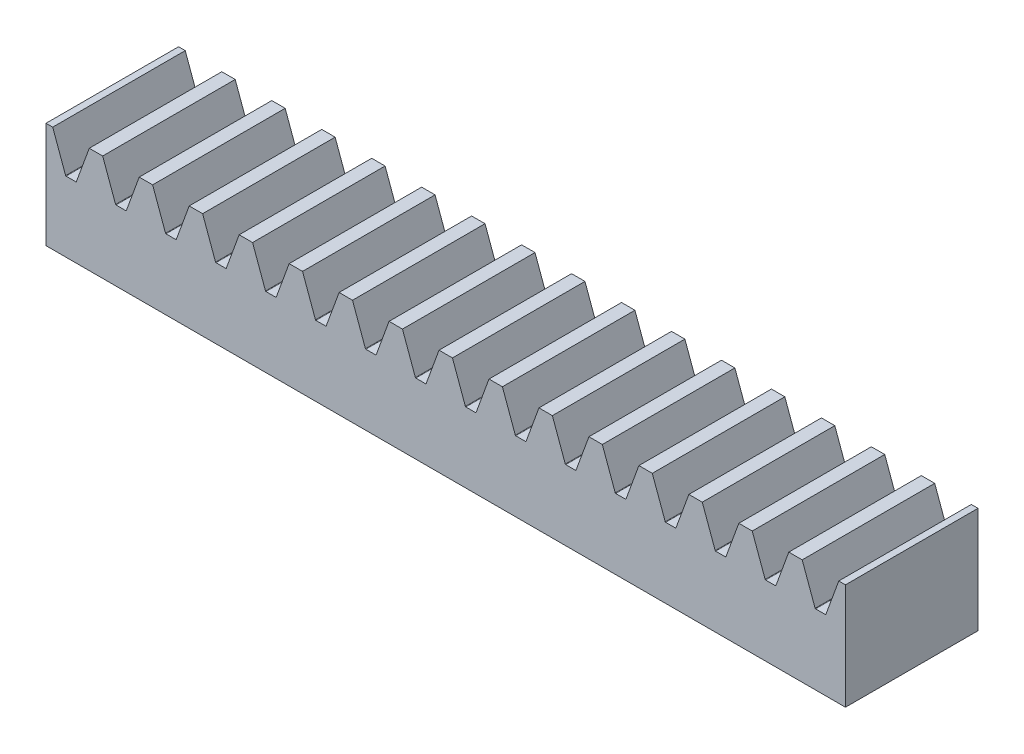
ISO-10303-21;
HEADER;
FILE_DESCRIPTION(('STEP AP214'),'2;1');
FILE_NAME('part.step','',(''),(''),'','','');
FILE_SCHEMA(('AUTOMOTIVE_DESIGN { 1 0 10303 214 1 1 1 1 }'));
ENDSEC;
DATA;
#1=APPLICATION_CONTEXT('core data for automotive mechanical design processes');
#2=APPLICATION_PROTOCOL_DEFINITION('international standard','automotive_design',2000,#1);
#3=PRODUCT_CONTEXT('',#1,'mechanical');
#4=PRODUCT('Part','Part','',(#3));
#5=PRODUCT_RELATED_PRODUCT_CATEGORY('part','',(#4));
#6=PRODUCT_DEFINITION_FORMATION('','',#4);
#7=PRODUCT_DEFINITION_CONTEXT('part definition',#1,'design');
#8=PRODUCT_DEFINITION('design','',#6,#7);
#9=PRODUCT_DEFINITION_SHAPE('','',#8);
#10=(LENGTH_UNIT() NAMED_UNIT(*) SI_UNIT(.MILLI.,.METRE.));
#11=(NAMED_UNIT(*) PLANE_ANGLE_UNIT() SI_UNIT($,.RADIAN.));
#12=(NAMED_UNIT(*) SI_UNIT($,.STERADIAN.) SOLID_ANGLE_UNIT());
#13=UNCERTAINTY_MEASURE_WITH_UNIT(LENGTH_MEASURE(1.E-05),#10,'distance_accuracy_value','');
#14=(GEOMETRIC_REPRESENTATION_CONTEXT(3) GLOBAL_UNCERTAINTY_ASSIGNED_CONTEXT((#13)) GLOBAL_UNIT_ASSIGNED_CONTEXT((#10,
#11,#12)) REPRESENTATION_CONTEXT('',''));
#15=CARTESIAN_POINT('',(0.,0.,0.));
#16=DIRECTION('',(0.,0.,1.));
#17=DIRECTION('',(1.,0.,0.));
#18=AXIS2_PLACEMENT_3D('',#15,#16,#17);
#19=CARTESIAN_POINT('',(0.,40.,-50.));
#20=DIRECTION('',(0.,1.,0.));
#21=DIRECTION('',(0.,0.,1.));
#22=AXIS2_PLACEMENT_3D('',#19,#20,#21);
#23=PLANE('',#22);
#24=DIRECTION('',(0.,0.,1.));
#25=VECTOR('',#24,1.);
#26=CARTESIAN_POINT('',(35.1705442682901,40.,-50.));
#27=LINE('',#26,#25);
#28=CARTESIAN_POINT('',(35.1705442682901,40.,-50.));
#29=VERTEX_POINT('',#28);
#30=CARTESIAN_POINT('',(35.1705442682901,40.,0.));
#31=VERTEX_POINT('',#30);
#32=EDGE_CURVE('E672',#29,#31,#27,.T.);
#33=ORIENTED_EDGE('',*,*,#32,.T.);
#34=DIRECTION('',(-1.,0.,0.));
#35=VECTOR('',#34,1.);
#36=CARTESIAN_POINT('',(0.,40.,0.));
#37=LINE('',#36,#35);
#38=CARTESIAN_POINT('',(40.227679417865,40.,0.));
#39=VERTEX_POINT('',#38);
#40=EDGE_CURVE('E1518',#39,#31,#37,.T.);
#41=ORIENTED_EDGE('',*,*,#40,.F.);
#42=DIRECTION('',(0.,0.,1.));
#43=VECTOR('',#42,1.);
#44=CARTESIAN_POINT('',(40.227679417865,40.,-50.));
#45=LINE('',#44,#43);
#46=CARTESIAN_POINT('',(40.227679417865,40.,-50.));
#47=VERTEX_POINT('',#46);
#48=EDGE_CURVE('E790',#47,#39,#45,.T.);
#49=ORIENTED_EDGE('',*,*,#48,.F.);
#50=DIRECTION('',(-1.,0.,0.));
#51=VECTOR('',#50,1.);
#52=CARTESIAN_POINT('',(0.,40.,-50.));
#53=LINE('',#52,#51);
#54=EDGE_CURVE('E680',#47,#29,#53,.T.);
#55=ORIENTED_EDGE('',*,*,#54,.T.);
#56=EDGE_LOOP('',(#33,#41,#49,#55));
#57=FACE_BOUND('',#56,.T.);
#58=ADVANCED_FACE('F37',(#57),#23,.T.);
#59=DIRECTION('',(0.,0.,1.));
#60=VECTOR('',#59,1.);
#61=CARTESIAN_POINT('',(54.0201001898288,40.,-50.));
#62=LINE('',#61,#60);
#63=CARTESIAN_POINT('',(54.0201001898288,40.,-50.));
#64=VERTEX_POINT('',#63);
#65=CARTESIAN_POINT('',(54.0201001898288,40.,0.));
#66=VERTEX_POINT('',#65);
#67=EDGE_CURVE('E776',#64,#66,#62,.T.);
#68=ORIENTED_EDGE('',*,*,#67,.T.);
#69=CARTESIAN_POINT('',(59.0772353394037,40.,0.));
#70=VERTEX_POINT('',#69);
#71=EDGE_CURVE('E1514',#70,#66,#37,.T.);
#72=ORIENTED_EDGE('',*,*,#71,.F.);
#73=DIRECTION('',(0.,0.,1.));
#74=VECTOR('',#73,1.);
#75=CARTESIAN_POINT('',(59.0772353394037,40.,-50.));
#76=LINE('',#75,#74);
#77=CARTESIAN_POINT('',(59.0772353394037,40.,-50.));
#78=VERTEX_POINT('',#77);
#79=EDGE_CURVE('E778',#78,#70,#76,.T.);
#80=ORIENTED_EDGE('',*,*,#79,.F.);
#81=EDGE_CURVE('E685',#78,#64,#53,.T.);
#82=ORIENTED_EDGE('',*,*,#81,.T.);
#83=EDGE_LOOP('',(#68,#72,#80,#82));
#84=FACE_BOUND('',#83,.T.);
#85=ADVANCED_FACE('F773',(#84),#23,.T.);
#86=DIRECTION('',(0.,0.,1.));
#87=VECTOR('',#86,1.);
#88=CARTESIAN_POINT('',(72.8696561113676,40.,-50.));
#89=LINE('',#88,#87);
#90=CARTESIAN_POINT('',(72.8696561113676,40.,-50.));
#91=VERTEX_POINT('',#90);
#92=CARTESIAN_POINT('',(72.8696561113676,40.,0.));
#93=VERTEX_POINT('',#92);
#94=EDGE_CURVE('E819',#91,#93,#89,.T.);
#95=ORIENTED_EDGE('',*,*,#94,.T.);
#96=CARTESIAN_POINT('',(77.9267912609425,40.,0.));
#97=VERTEX_POINT('',#96);
#98=EDGE_CURVE('E1509',#97,#93,#37,.T.);
#99=ORIENTED_EDGE('',*,*,#98,.F.);
#100=DIRECTION('',(0.,0.,1.));
#101=VECTOR('',#100,1.);
#102=CARTESIAN_POINT('',(77.9267912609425,40.,-50.));
#103=LINE('',#102,#101);
#104=CARTESIAN_POINT('',(77.9267912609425,40.,-50.));
#105=VERTEX_POINT('',#104);
#106=EDGE_CURVE('E832',#105,#97,#103,.T.);
#107=ORIENTED_EDGE('',*,*,#106,.F.);
#108=EDGE_CURVE('E758',#105,#91,#53,.T.);
#109=ORIENTED_EDGE('',*,*,#108,.T.);
#110=EDGE_LOOP('',(#95,#99,#107,#109));
#111=FACE_BOUND('',#110,.T.);
#112=ADVANCED_FACE('F1428',(#111),#23,.T.);
#113=DIRECTION('',(0.,0.,1.));
#114=VECTOR('',#113,1.);
#115=CARTESIAN_POINT('',(91.7192120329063,40.,-50.));
#116=LINE('',#115,#114);
#117=CARTESIAN_POINT('',(91.7192120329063,40.,-50.));
#118=VERTEX_POINT('',#117);
#119=CARTESIAN_POINT('',(91.7192120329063,40.,0.));
#120=VERTEX_POINT('',#119);
#121=EDGE_CURVE('E815',#118,#120,#116,.T.);
#122=ORIENTED_EDGE('',*,*,#121,.T.);
#123=CARTESIAN_POINT('',(96.7763471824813,40.,0.));
#124=VERTEX_POINT('',#123);
#125=EDGE_CURVE('E1504',#124,#120,#37,.T.);
#126=ORIENTED_EDGE('',*,*,#125,.F.);
#127=DIRECTION('',(0.,0.,1.));
#128=VECTOR('',#127,1.);
#129=CARTESIAN_POINT('',(96.7763471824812,40.,-50.));
#130=LINE('',#129,#128);
#131=CARTESIAN_POINT('',(96.7763471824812,40.,-50.));
#132=VERTEX_POINT('',#131);
#133=EDGE_CURVE('E852',#132,#124,#130,.T.);
#134=ORIENTED_EDGE('',*,*,#133,.F.);
#135=EDGE_CURVE('E752',#132,#118,#53,.T.);
#136=ORIENTED_EDGE('',*,*,#135,.T.);
#137=EDGE_LOOP('',(#122,#126,#134,#136));
#138=FACE_BOUND('',#137,.T.);
#139=ADVANCED_FACE('F2428',(#138),#23,.T.);
#140=DIRECTION('',(0.,0.,1.));
#141=VECTOR('',#140,1.);
#142=CARTESIAN_POINT('',(110.568767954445,40.,-50.));
#143=LINE('',#142,#141);
#144=CARTESIAN_POINT('',(110.568767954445,40.,-50.));
#145=VERTEX_POINT('',#144);
#146=CARTESIAN_POINT('',(110.568767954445,40.,0.));
#147=VERTEX_POINT('',#146);
#148=EDGE_CURVE('E837',#145,#147,#143,.T.);
#149=ORIENTED_EDGE('',*,*,#148,.T.);
#150=CARTESIAN_POINT('',(115.62590310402,40.,0.));
#151=VERTEX_POINT('',#150);
#152=EDGE_CURVE('E1499',#151,#147,#37,.T.);
#153=ORIENTED_EDGE('',*,*,#152,.F.);
#154=DIRECTION('',(0.,0.,1.));
#155=VECTOR('',#154,1.);
#156=CARTESIAN_POINT('',(115.62590310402,40.,-50.));
#157=LINE('',#156,#155);
#158=CARTESIAN_POINT('',(115.62590310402,40.,-50.));
#159=VERTEX_POINT('',#158);
#160=EDGE_CURVE('E872',#159,#151,#157,.T.);
#161=ORIENTED_EDGE('',*,*,#160,.F.);
#162=EDGE_CURVE('E746',#159,#145,#53,.T.);
#163=ORIENTED_EDGE('',*,*,#162,.T.);
#164=EDGE_LOOP('',(#149,#153,#161,#163));
#165=FACE_BOUND('',#164,.T.);
#166=ADVANCED_FACE('F2419',(#165),#23,.T.);
#167=DIRECTION('',(0.,0.,1.));
#168=VECTOR('',#167,1.);
#169=CARTESIAN_POINT('',(129.418323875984,40.,-50.));
#170=LINE('',#169,#168);
#171=CARTESIAN_POINT('',(129.418323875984,40.,-50.));
#172=VERTEX_POINT('',#171);
#173=CARTESIAN_POINT('',(129.418323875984,40.,0.));
#174=VERTEX_POINT('',#173);
#175=EDGE_CURVE('E857',#172,#174,#170,.T.);
#176=ORIENTED_EDGE('',*,*,#175,.T.);
#177=CARTESIAN_POINT('',(134.475459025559,40.,0.));
#178=VERTEX_POINT('',#177);
#179=EDGE_CURVE('E1494',#178,#174,#37,.T.);
#180=ORIENTED_EDGE('',*,*,#179,.F.);
#181=DIRECTION('',(0.,0.,1.));
#182=VECTOR('',#181,1.);
#183=CARTESIAN_POINT('',(134.475459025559,40.,-50.));
#184=LINE('',#183,#182);
#185=CARTESIAN_POINT('',(134.475459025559,40.,-50.));
#186=VERTEX_POINT('',#185);
#187=EDGE_CURVE('E892',#186,#178,#184,.T.);
#188=ORIENTED_EDGE('',*,*,#187,.F.);
#189=EDGE_CURVE('E740',#186,#172,#53,.T.);
#190=ORIENTED_EDGE('',*,*,#189,.T.);
#191=EDGE_LOOP('',(#176,#180,#188,#190));
#192=FACE_BOUND('',#191,.T.);
#193=ADVANCED_FACE('F2410',(#192),#23,.T.);
#194=DIRECTION('',(0.,0.,1.));
#195=VECTOR('',#194,1.);
#196=CARTESIAN_POINT('',(148.267879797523,40.,-50.));
#197=LINE('',#196,#195);
#198=CARTESIAN_POINT('',(148.267879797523,40.,-50.));
#199=VERTEX_POINT('',#198);
#200=CARTESIAN_POINT('',(148.267879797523,40.,0.));
#201=VERTEX_POINT('',#200);
#202=EDGE_CURVE('E877',#199,#201,#197,.T.);
#203=ORIENTED_EDGE('',*,*,#202,.T.);
#204=CARTESIAN_POINT('',(153.325014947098,40.,0.));
#205=VERTEX_POINT('',#204);
#206=EDGE_CURVE('E1489',#205,#201,#37,.T.);
#207=ORIENTED_EDGE('',*,*,#206,.F.);
#208=DIRECTION('',(0.,0.,1.));
#209=VECTOR('',#208,1.);
#210=CARTESIAN_POINT('',(153.325014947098,40.,-50.));
#211=LINE('',#210,#209);
#212=CARTESIAN_POINT('',(153.325014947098,40.,-50.));
#213=VERTEX_POINT('',#212);
#214=EDGE_CURVE('E912',#213,#205,#211,.T.);
#215=ORIENTED_EDGE('',*,*,#214,.F.);
#216=EDGE_CURVE('E734',#213,#199,#53,.T.);
#217=ORIENTED_EDGE('',*,*,#216,.T.);
#218=EDGE_LOOP('',(#203,#207,#215,#217));
#219=FACE_BOUND('',#218,.T.);
#220=ADVANCED_FACE('F2401',(#219),#23,.T.);
#221=DIRECTION('',(0.,0.,1.));
#222=VECTOR('',#221,1.);
#223=CARTESIAN_POINT('',(167.117435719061,40.,-50.));
#224=LINE('',#223,#222);
#225=CARTESIAN_POINT('',(167.117435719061,40.,-50.));
#226=VERTEX_POINT('',#225);
#227=CARTESIAN_POINT('',(167.117435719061,40.,0.));
#228=VERTEX_POINT('',#227);
#229=EDGE_CURVE('E897',#226,#228,#224,.T.);
#230=ORIENTED_EDGE('',*,*,#229,.T.);
#231=CARTESIAN_POINT('',(172.174570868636,40.,0.));
#232=VERTEX_POINT('',#231);
#233=EDGE_CURVE('E1484',#232,#228,#37,.T.);
#234=ORIENTED_EDGE('',*,*,#233,.F.);
#235=DIRECTION('',(0.,0.,1.));
#236=VECTOR('',#235,1.);
#237=CARTESIAN_POINT('',(172.174570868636,40.,-50.));
#238=LINE('',#237,#236);
#239=CARTESIAN_POINT('',(172.174570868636,40.,-50.));
#240=VERTEX_POINT('',#239);
#241=EDGE_CURVE('E932',#240,#232,#238,.T.);
#242=ORIENTED_EDGE('',*,*,#241,.F.);
#243=EDGE_CURVE('E728',#240,#226,#53,.T.);
#244=ORIENTED_EDGE('',*,*,#243,.T.);
#245=EDGE_LOOP('',(#230,#234,#242,#244));
#246=FACE_BOUND('',#245,.T.);
#247=ADVANCED_FACE('F2392',(#246),#23,.T.);
#248=DIRECTION('',(0.,0.,1.));
#249=VECTOR('',#248,1.);
#250=CARTESIAN_POINT('',(185.9669916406,40.,-50.));
#251=LINE('',#250,#249);
#252=CARTESIAN_POINT('',(185.9669916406,40.,-50.));
#253=VERTEX_POINT('',#252);
#254=CARTESIAN_POINT('',(185.9669916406,40.,0.));
#255=VERTEX_POINT('',#254);
#256=EDGE_CURVE('E917',#253,#255,#251,.T.);
#257=ORIENTED_EDGE('',*,*,#256,.T.);
#258=CARTESIAN_POINT('',(191.024126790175,40.,0.));
#259=VERTEX_POINT('',#258);
#260=EDGE_CURVE('E1479',#259,#255,#37,.T.);
#261=ORIENTED_EDGE('',*,*,#260,.F.);
#262=DIRECTION('',(0.,0.,1.));
#263=VECTOR('',#262,1.);
#264=CARTESIAN_POINT('',(191.024126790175,40.,-50.));
#265=LINE('',#264,#263);
#266=CARTESIAN_POINT('',(191.024126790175,40.,-50.));
#267=VERTEX_POINT('',#266);
#268=EDGE_CURVE('E952',#267,#259,#265,.T.);
#269=ORIENTED_EDGE('',*,*,#268,.F.);
#270=EDGE_CURVE('E722',#267,#253,#53,.T.);
#271=ORIENTED_EDGE('',*,*,#270,.T.);
#272=EDGE_LOOP('',(#257,#261,#269,#271));
#273=FACE_BOUND('',#272,.T.);
#274=ADVANCED_FACE('F2383',(#273),#23,.T.);
#275=DIRECTION('',(0.,0.,1.));
#276=VECTOR('',#275,1.);
#277=CARTESIAN_POINT('',(204.816547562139,40.,-50.));
#278=LINE('',#277,#276);
#279=CARTESIAN_POINT('',(204.816547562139,40.,-50.));
#280=VERTEX_POINT('',#279);
#281=CARTESIAN_POINT('',(204.816547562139,40.,0.));
#282=VERTEX_POINT('',#281);
#283=EDGE_CURVE('E937',#280,#282,#278,.T.);
#284=ORIENTED_EDGE('',*,*,#283,.T.);
#285=CARTESIAN_POINT('',(209.873682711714,40.,0.));
#286=VERTEX_POINT('',#285);
#287=EDGE_CURVE('E1474',#286,#282,#37,.T.);
#288=ORIENTED_EDGE('',*,*,#287,.F.);
#289=DIRECTION('',(0.,0.,1.));
#290=VECTOR('',#289,1.);
#291=CARTESIAN_POINT('',(209.873682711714,40.,-50.));
#292=LINE('',#291,#290);
#293=CARTESIAN_POINT('',(209.873682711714,40.,-50.));
#294=VERTEX_POINT('',#293);
#295=EDGE_CURVE('E972',#294,#286,#292,.T.);
#296=ORIENTED_EDGE('',*,*,#295,.F.);
#297=EDGE_CURVE('E716',#294,#280,#53,.T.);
#298=ORIENTED_EDGE('',*,*,#297,.T.);
#299=EDGE_LOOP('',(#284,#288,#296,#298));
#300=FACE_BOUND('',#299,.T.);
#301=ADVANCED_FACE('F2374',(#300),#23,.T.);
#302=DIRECTION('',(0.,0.,1.));
#303=VECTOR('',#302,1.);
#304=CARTESIAN_POINT('',(223.666103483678,40.,-50.));
#305=LINE('',#304,#303);
#306=CARTESIAN_POINT('',(223.666103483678,40.,-50.));
#307=VERTEX_POINT('',#306);
#308=CARTESIAN_POINT('',(223.666103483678,40.,0.));
#309=VERTEX_POINT('',#308);
#310=EDGE_CURVE('E957',#307,#309,#305,.T.);
#311=ORIENTED_EDGE('',*,*,#310,.T.);
#312=CARTESIAN_POINT('',(228.723238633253,40.,0.));
#313=VERTEX_POINT('',#312);
#314=EDGE_CURVE('E1469',#313,#309,#37,.T.);
#315=ORIENTED_EDGE('',*,*,#314,.F.);
#316=DIRECTION('',(0.,0.,1.));
#317=VECTOR('',#316,1.);
#318=CARTESIAN_POINT('',(228.723238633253,40.,-50.));
#319=LINE('',#318,#317);
#320=CARTESIAN_POINT('',(228.723238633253,40.,-50.));
#321=VERTEX_POINT('',#320);
#322=EDGE_CURVE('E992',#321,#313,#319,.T.);
#323=ORIENTED_EDGE('',*,*,#322,.F.);
#324=EDGE_CURVE('E710',#321,#307,#53,.T.);
#325=ORIENTED_EDGE('',*,*,#324,.T.);
#326=EDGE_LOOP('',(#311,#315,#323,#325));
#327=FACE_BOUND('',#326,.T.);
#328=ADVANCED_FACE('F2365',(#327),#23,.T.);
#329=DIRECTION('',(0.,0.,1.));
#330=VECTOR('',#329,1.);
#331=CARTESIAN_POINT('',(242.515659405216,40.,-50.));
#332=LINE('',#331,#330);
#333=CARTESIAN_POINT('',(242.515659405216,40.,-50.));
#334=VERTEX_POINT('',#333);
#335=CARTESIAN_POINT('',(242.515659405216,40.,0.));
#336=VERTEX_POINT('',#335);
#337=EDGE_CURVE('E977',#334,#336,#332,.T.);
#338=ORIENTED_EDGE('',*,*,#337,.T.);
#339=CARTESIAN_POINT('',(247.572794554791,40.,0.));
#340=VERTEX_POINT('',#339);
#341=EDGE_CURVE('E1464',#340,#336,#37,.T.);
#342=ORIENTED_EDGE('',*,*,#341,.F.);
#343=DIRECTION('',(0.,0.,1.));
#344=VECTOR('',#343,1.);
#345=CARTESIAN_POINT('',(247.572794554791,40.,-50.));
#346=LINE('',#345,#344);
#347=CARTESIAN_POINT('',(247.572794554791,40.,-50.));
#348=VERTEX_POINT('',#347);
#349=EDGE_CURVE('E1012',#348,#340,#346,.T.);
#350=ORIENTED_EDGE('',*,*,#349,.F.);
#351=EDGE_CURVE('E704',#348,#334,#53,.T.);
#352=ORIENTED_EDGE('',*,*,#351,.T.);
#353=EDGE_LOOP('',(#338,#342,#350,#352));
#354=FACE_BOUND('',#353,.T.);
#355=ADVANCED_FACE('F1454',(#354),#23,.T.);
#356=DIRECTION('',(0.,0.,1.));
#357=VECTOR('',#356,1.);
#358=CARTESIAN_POINT('',(261.365215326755,40.,-50.));
#359=LINE('',#358,#357);
#360=CARTESIAN_POINT('',(261.365215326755,40.,-50.));
#361=VERTEX_POINT('',#360);
#362=CARTESIAN_POINT('',(261.365215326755,40.,0.));
#363=VERTEX_POINT('',#362);
#364=EDGE_CURVE('E997',#361,#363,#359,.T.);
#365=ORIENTED_EDGE('',*,*,#364,.T.);
#366=CARTESIAN_POINT('',(266.42235047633,40.,0.));
#367=VERTEX_POINT('',#366);
#368=EDGE_CURVE('E1462',#367,#363,#37,.T.);
#369=ORIENTED_EDGE('',*,*,#368,.F.);
#370=DIRECTION('',(0.,0.,1.));
#371=VECTOR('',#370,1.);
#372=CARTESIAN_POINT('',(266.42235047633,40.,-50.));
#373=LINE('',#372,#371);
#374=CARTESIAN_POINT('',(266.42235047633,40.,-50.));
#375=VERTEX_POINT('',#374);
#376=EDGE_CURVE('E1032',#375,#367,#373,.T.);
#377=ORIENTED_EDGE('',*,*,#376,.F.);
#378=EDGE_CURVE('E698',#375,#361,#53,.T.);
#379=ORIENTED_EDGE('',*,*,#378,.T.);
#380=EDGE_LOOP('',(#365,#369,#377,#379));
#381=FACE_BOUND('',#380,.T.);
#382=ADVANCED_FACE('F1450',(#381),#23,.T.);
#383=DIRECTION('',(0.,0.,1.));
#384=VECTOR('',#383,1.);
#385=CARTESIAN_POINT('',(280.214771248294,40.,-50.));
#386=LINE('',#385,#384);
#387=CARTESIAN_POINT('',(280.214771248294,40.,-50.));
#388=VERTEX_POINT('',#387);
#389=CARTESIAN_POINT('',(280.214771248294,40.,0.));
#390=VERTEX_POINT('',#389);
#391=EDGE_CURVE('E1017',#388,#390,#386,.T.);
#392=ORIENTED_EDGE('',*,*,#391,.T.);
#393=CARTESIAN_POINT('',(285.271906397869,40.,0.));
#394=VERTEX_POINT('',#393);
#395=EDGE_CURVE('E1120',#394,#390,#37,.T.);
#396=ORIENTED_EDGE('',*,*,#395,.F.);
#397=DIRECTION('',(0.,0.,1.));
#398=VECTOR('',#397,1.);
#399=CARTESIAN_POINT('',(285.271906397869,40.,-50.));
#400=LINE('',#399,#398);
#401=CARTESIAN_POINT('',(285.271906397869,40.,-50.));
#402=VERTEX_POINT('',#401);
#403=EDGE_CURVE('E1051',#402,#394,#400,.T.);
#404=ORIENTED_EDGE('',*,*,#403,.F.);
#405=EDGE_CURVE('E687',#402,#388,#53,.T.);
#406=ORIENTED_EDGE('',*,*,#405,.T.);
#407=EDGE_LOOP('',(#392,#396,#404,#406));
#408=FACE_BOUND('',#407,.T.);
#409=ADVANCED_FACE('F1446',(#408),#23,.T.);
#410=DIRECTION('',(0.,0.,1.));
#411=VECTOR('',#410,1.);
#412=CARTESIAN_POINT('',(299.064327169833,40.,-50.));
#413=LINE('',#412,#411);
#414=CARTESIAN_POINT('',(299.064327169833,40.,-50.));
#415=VERTEX_POINT('',#414);
#416=CARTESIAN_POINT('',(299.064327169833,40.,0.));
#417=VERTEX_POINT('',#416);
#418=EDGE_CURVE('E1037',#415,#417,#413,.T.);
#419=ORIENTED_EDGE('',*,*,#418,.T.);
#420=CARTESIAN_POINT('',(301.59289474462,40.,0.));
#421=VERTEX_POINT('',#420);
#422=EDGE_CURVE('E1096',#421,#417,#37,.T.);
#423=ORIENTED_EDGE('',*,*,#422,.F.);
#424=DIRECTION('',(0.,0.,1.));
#425=VECTOR('',#424,1.);
#426=CARTESIAN_POINT('',(301.59289474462,40.,-50.));
#427=LINE('',#426,#425);
#428=CARTESIAN_POINT('',(301.59289474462,40.,-50.));
#429=VERTEX_POINT('',#428);
#430=EDGE_CURVE('E1068',#429,#421,#427,.T.);
#431=ORIENTED_EDGE('',*,*,#430,.F.);
#432=EDGE_CURVE('E683',#429,#415,#53,.T.);
#433=ORIENTED_EDGE('',*,*,#432,.T.);
#434=EDGE_LOOP('',(#419,#423,#431,#433));
#435=FACE_BOUND('',#434,.T.);
#436=ADVANCED_FACE('F1108',(#435),#23,.T.);
#437=DIRECTION('',(0.,0.,1.));
#438=VECTOR('',#437,1.);
#439=CARTESIAN_POINT('',(21.3781234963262,40.,-50.));
#440=LINE('',#439,#438);
#441=CARTESIAN_POINT('',(21.3781234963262,40.,-50.));
#442=VERTEX_POINT('',#441);
#443=CARTESIAN_POINT('',(21.3781234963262,40.,0.));
#444=VERTEX_POINT('',#443);
#445=EDGE_CURVE('E656',#442,#444,#440,.T.);
#446=ORIENTED_EDGE('',*,*,#445,.F.);
#447=CARTESIAN_POINT('',(16.3209883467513,40.,-50.));
#448=VERTEX_POINT('',#447);
#449=EDGE_CURVE('E669',#442,#448,#53,.T.);
#450=ORIENTED_EDGE('',*,*,#449,.T.);
#451=DIRECTION('',(0.,0.,1.));
#452=VECTOR('',#451,1.);
#453=CARTESIAN_POINT('',(16.3209883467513,40.,-50.));
#454=LINE('',#453,#452);
#455=CARTESIAN_POINT('',(16.3209883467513,40.,0.));
#456=VERTEX_POINT('',#455);
#457=EDGE_CURVE('E1090',#448,#456,#454,.T.);
#458=ORIENTED_EDGE('',*,*,#457,.T.);
#459=EDGE_CURVE('E671',#444,#456,#37,.T.);
#460=ORIENTED_EDGE('',*,*,#459,.F.);
#461=EDGE_LOOP('',(#446,#450,#458,#460));
#462=FACE_BOUND('',#461,.T.);
#463=ADVANCED_FACE('F667',(#462),#23,.T.);
#464=CARTESIAN_POINT('',(0.,0.,-50.));
#465=DIRECTION('',(-1.,0.,0.));
#466=DIRECTION('',(0.,0.,1.));
#467=AXIS2_PLACEMENT_3D('',#464,#465,#466);
#468=PLANE('',#467);
#469=DIRECTION('',(0.,-1.,0.));
#470=VECTOR('',#469,1.);
#471=CARTESIAN_POINT('',(0.,0.,0.));
#472=LINE('',#471,#470);
#473=CARTESIAN_POINT('',(0.,40.,0.));
#474=VERTEX_POINT('',#473);
#475=CARTESIAN_POINT('',(0.,0.,0.));
#476=VERTEX_POINT('',#475);
#477=EDGE_CURVE('E1092',#474,#476,#472,.T.);
#478=ORIENTED_EDGE('',*,*,#477,.F.);
#479=DIRECTION('',(0.,0.,1.));
#480=VECTOR('',#479,1.);
#481=CARTESIAN_POINT('',(0.,40.,-50.));
#482=LINE('',#481,#480);
#483=CARTESIAN_POINT('',(0.,40.,-50.));
#484=VERTEX_POINT('',#483);
#485=EDGE_CURVE('E695',#484,#474,#482,.T.);
#486=ORIENTED_EDGE('',*,*,#485,.F.);
#487=DIRECTION('',(0.,-1.,0.));
#488=VECTOR('',#487,1.);
#489=CARTESIAN_POINT('',(0.,0.,-50.));
#490=LINE('',#489,#488);
#491=CARTESIAN_POINT('',(0.,0.,-50.));
#492=VERTEX_POINT('',#491);
#493=EDGE_CURVE('E1094',#484,#492,#490,.T.);
#494=ORIENTED_EDGE('',*,*,#493,.T.);
#495=DIRECTION('',(0.,0.,1.));
#496=VECTOR('',#495,1.);
#497=CARTESIAN_POINT('',(0.,0.,-50.));
#498=LINE('',#497,#496);
#499=EDGE_CURVE('E691',#492,#476,#498,.T.);
#500=ORIENTED_EDGE('',*,*,#499,.T.);
#501=EDGE_LOOP('',(#478,#486,#494,#500));
#502=FACE_BOUND('',#501,.T.);
#503=ADVANCED_FACE('F1433',(#502),#468,.T.);
#504=DIRECTION('',(0.,0.,1.));
#505=VECTOR('',#504,1.);
#506=CARTESIAN_POINT('',(2.52856757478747,40.,-50.));
#507=LINE('',#506,#505);
#508=CARTESIAN_POINT('',(2.52856757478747,40.,-50.));
#509=VERTEX_POINT('',#508);
#510=CARTESIAN_POINT('',(2.52856757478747,40.,0.));
#511=VERTEX_POINT('',#510);
#512=EDGE_CURVE('E1082',#509,#511,#507,.T.);
#513=ORIENTED_EDGE('',*,*,#512,.F.);
#514=EDGE_CURVE('E681',#509,#484,#53,.T.);
#515=ORIENTED_EDGE('',*,*,#514,.T.);
#516=ORIENTED_EDGE('',*,*,#485,.T.);
#517=EDGE_CURVE('E1117',#511,#474,#37,.T.);
#518=ORIENTED_EDGE('',*,*,#517,.F.);
#519=EDGE_LOOP('',(#513,#515,#516,#518));
#520=FACE_BOUND('',#519,.T.);
#521=ADVANCED_FACE('F1424',(#520),#23,.T.);
#522=CARTESIAN_POINT('',(0.,0.,-50.));
#523=DIRECTION('',(0.,-1.,0.));
#524=DIRECTION('',(0.,0.,-1.));
#525=AXIS2_PLACEMENT_3D('',#522,#523,#524);
#526=PLANE('',#525);
#527=DIRECTION('',(1.,0.,0.));
#528=VECTOR('',#527,1.);
#529=CARTESIAN_POINT('',(0.,0.,0.));
#530=LINE('',#529,#528);
#531=CARTESIAN_POINT('',(301.59289474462,0.,0.));
#532=VERTEX_POINT('',#531);
#533=EDGE_CURVE('E1115',#476,#532,#530,.T.);
#534=ORIENTED_EDGE('',*,*,#533,.F.);
#535=ORIENTED_EDGE('',*,*,#499,.F.);
#536=DIRECTION('',(1.,0.,0.));
#537=VECTOR('',#536,1.);
#538=CARTESIAN_POINT('',(0.,0.,-50.));
#539=LINE('',#538,#537);
#540=CARTESIAN_POINT('',(301.59289474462,0.,-50.));
#541=VERTEX_POINT('',#540);
#542=EDGE_CURVE('E686',#492,#541,#539,.T.);
#543=ORIENTED_EDGE('',*,*,#542,.T.);
#544=DIRECTION('',(0.,0.,1.));
#545=VECTOR('',#544,1.);
#546=CARTESIAN_POINT('',(301.59289474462,0.,-50.));
#547=LINE('',#546,#545);
#548=EDGE_CURVE('E1064',#541,#532,#547,.T.);
#549=ORIENTED_EDGE('',*,*,#548,.T.);
#550=EDGE_LOOP('',(#534,#535,#543,#549));
#551=FACE_BOUND('',#550,.T.);
#552=ADVANCED_FACE('F1101',(#551),#526,.T.);
#553=CARTESIAN_POINT('',(0.,0.,-50.));
#554=DIRECTION('',(0.,0.,-1.));
#555=DIRECTION('',(-1.,0.,0.));
#556=AXIS2_PLACEMENT_3D('',#553,#554,#555);
#557=PLANE('',#556);
#558=DIRECTION('',(1.,0.,0.));
#559=VECTOR('',#558,1.);
#560=CARTESIAN_POINT('',(26.29172165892,26.5,-50.));
#561=LINE('',#560,#559);
#562=CARTESIAN_POINT('',(26.4317631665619,26.5,-50.));
#563=VERTEX_POINT('',#562);
#564=CARTESIAN_POINT('',(30.1169045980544,26.5,-50.));
#565=VERTEX_POINT('',#564);
#566=EDGE_CURVE('E662',#563,#565,#561,.T.);
#567=ORIENTED_EDGE('',*,*,#566,.T.);
#568=CARTESIAN_POINT('',(30.1169045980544,26.7,-50.));
#569=DIRECTION('',(0.,0.,-1.));
#570=DIRECTION('',(-1.,0.,0.));
#571=AXIS2_PLACEMENT_3D('',#568,#569,#570);
#572=CIRCLE('',#571,0.2);
#573=CARTESIAN_POINT('',(30.3048431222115,26.6315959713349,-50.));
#574=VERTEX_POINT('',#573);
#575=EDGE_CURVE('E1157',#565,#574,#572,.F.);
#576=ORIENTED_EDGE('',*,*,#575,.T.);
#577=DIRECTION('',(0.342020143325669,0.939692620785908,0.));
#578=VECTOR('',#577,1.);
#579=CARTESIAN_POINT('',(30.2569461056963,26.5,-50.));
#580=LINE('',#579,#578);
#581=EDGE_CURVE('E673',#574,#29,#580,.T.);
#582=ORIENTED_EDGE('',*,*,#581,.T.);
#583=ORIENTED_EDGE('',*,*,#54,.F.);
#584=DIRECTION('',(0.342020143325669,-0.939692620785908,0.));
#585=VECTOR('',#584,1.);
#586=CARTESIAN_POINT('',(40.227679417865,40.,-50.));
#587=LINE('',#586,#585);
#588=CARTESIAN_POINT('',(45.0933805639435,26.6315959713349,-50.));
#589=VERTEX_POINT('',#588);
#590=EDGE_CURVE('E2638',#47,#589,#587,.T.);
#591=ORIENTED_EDGE('',*,*,#590,.T.);
#592=CARTESIAN_POINT('',(45.2813190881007,26.7,-50.));
#593=DIRECTION('',(0.,0.,-1.));
#594=DIRECTION('',(-1.,0.,0.));
#595=AXIS2_PLACEMENT_3D('',#592,#593,#594);
#596=CIRCLE('',#595,0.2);
#597=CARTESIAN_POINT('',(45.2813190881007,26.5,-50.));
#598=VERTEX_POINT('',#597);
#599=EDGE_CURVE('E1170',#589,#598,#596,.F.);
#600=ORIENTED_EDGE('',*,*,#599,.T.);
#601=DIRECTION('',(1.,0.,0.));
#602=VECTOR('',#601,1.);
#603=CARTESIAN_POINT('',(45.1412775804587,26.5,-50.));
#604=LINE('',#603,#602);
#605=CARTESIAN_POINT('',(48.9664605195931,26.5,-50.));
#606=VERTEX_POINT('',#605);
#607=EDGE_CURVE('E791',#598,#606,#604,.T.);
#608=ORIENTED_EDGE('',*,*,#607,.T.);
#609=CARTESIAN_POINT('',(48.9664605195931,26.7,-50.));
#610=DIRECTION('',(0.,0.,-1.));
#611=DIRECTION('',(-1.,0.,0.));
#612=AXIS2_PLACEMENT_3D('',#609,#610,#611);
#613=CIRCLE('',#612,0.2);
#614=CARTESIAN_POINT('',(49.1543990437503,26.6315959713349,-50.));
#615=VERTEX_POINT('',#614);
#616=EDGE_CURVE('E786',#606,#615,#613,.F.);
#617=ORIENTED_EDGE('',*,*,#616,.T.);
#618=DIRECTION('',(0.342020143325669,0.939692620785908,0.));
#619=VECTOR('',#618,1.);
#620=CARTESIAN_POINT('',(49.1065020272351,26.5,-50.));
#621=LINE('',#620,#619);
#622=EDGE_CURVE('E783',#615,#64,#621,.T.);
#623=ORIENTED_EDGE('',*,*,#622,.T.);
#624=ORIENTED_EDGE('',*,*,#81,.F.);
#625=DIRECTION('',(0.342020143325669,-0.939692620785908,0.));
#626=VECTOR('',#625,1.);
#627=CARTESIAN_POINT('',(59.0772353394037,40.,-50.));
#628=LINE('',#627,#626);
#629=CARTESIAN_POINT('',(63.9429364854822,26.6315959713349,-50.));
#630=VERTEX_POINT('',#629);
#631=EDGE_CURVE('E780',#78,#630,#628,.T.);
#632=ORIENTED_EDGE('',*,*,#631,.T.);
#633=CARTESIAN_POINT('',(64.1308750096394,26.7,-50.));
#634=DIRECTION('',(0.,0.,-1.));
#635=DIRECTION('',(-1.,0.,0.));
#636=AXIS2_PLACEMENT_3D('',#633,#634,#635);
#637=CIRCLE('',#636,0.2);
#638=CARTESIAN_POINT('',(64.1308750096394,26.5,-50.));
#639=VERTEX_POINT('',#638);
#640=EDGE_CURVE('E1187',#630,#639,#637,.F.);
#641=ORIENTED_EDGE('',*,*,#640,.T.);
#642=DIRECTION('',(1.,0.,0.));
#643=VECTOR('',#642,1.);
#644=CARTESIAN_POINT('',(63.9908335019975,26.5,-50.));
#645=LINE('',#644,#643);
#646=CARTESIAN_POINT('',(67.8160164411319,26.5,-50.));
#647=VERTEX_POINT('',#646);
#648=EDGE_CURVE('E805',#639,#647,#645,.T.);
#649=ORIENTED_EDGE('',*,*,#648,.T.);
#650=CARTESIAN_POINT('',(67.8160164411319,26.7,-50.));
#651=DIRECTION('',(0.,0.,-1.));
#652=DIRECTION('',(-1.,0.,0.));
#653=AXIS2_PLACEMENT_3D('',#650,#651,#652);
#654=CIRCLE('',#653,0.2);
#655=CARTESIAN_POINT('',(68.0039549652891,26.6315959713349,-50.));
#656=VERTEX_POINT('',#655);
#657=EDGE_CURVE('E1191',#647,#656,#654,.F.);
#658=ORIENTED_EDGE('',*,*,#657,.T.);
#659=DIRECTION('',(0.342020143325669,0.939692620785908,0.));
#660=VECTOR('',#659,1.);
#661=CARTESIAN_POINT('',(67.9560579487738,26.5,-50.));
#662=LINE('',#661,#660);
#663=EDGE_CURVE('E809',#656,#91,#662,.T.);
#664=ORIENTED_EDGE('',*,*,#663,.T.);
#665=ORIENTED_EDGE('',*,*,#108,.F.);
#666=DIRECTION('',(0.342020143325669,-0.939692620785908,0.));
#667=VECTOR('',#666,1.);
#668=CARTESIAN_POINT('',(77.9267912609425,40.,-50.));
#669=LINE('',#668,#667);
#670=CARTESIAN_POINT('',(82.792492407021,26.6315959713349,-50.));
#671=VERTEX_POINT('',#670);
#672=EDGE_CURVE('E823',#105,#671,#669,.T.);
#673=ORIENTED_EDGE('',*,*,#672,.T.);
#674=CARTESIAN_POINT('',(82.9804309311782,26.7,-50.));
#675=DIRECTION('',(0.,0.,-1.));
#676=DIRECTION('',(-1.,0.,0.));
#677=AXIS2_PLACEMENT_3D('',#674,#675,#676);
#678=CIRCLE('',#677,0.2);
#679=CARTESIAN_POINT('',(82.9804309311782,26.5,-50.));
#680=VERTEX_POINT('',#679);
#681=EDGE_CURVE('E1205',#671,#680,#678,.F.);
#682=ORIENTED_EDGE('',*,*,#681,.T.);
#683=DIRECTION('',(1.,0.,0.));
#684=VECTOR('',#683,1.);
#685=CARTESIAN_POINT('',(82.8403894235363,26.5,-50.));
#686=LINE('',#685,#684);
#687=CARTESIAN_POINT('',(86.6655723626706,26.5,-50.));
#688=VERTEX_POINT('',#687);
#689=EDGE_CURVE('E826',#680,#688,#686,.T.);
#690=ORIENTED_EDGE('',*,*,#689,.T.);
#691=CARTESIAN_POINT('',(86.6655723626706,26.7,-50.));
#692=DIRECTION('',(0.,0.,-1.));
#693=DIRECTION('',(-1.,0.,0.));
#694=AXIS2_PLACEMENT_3D('',#691,#692,#693);
#695=CIRCLE('',#694,0.2);
#696=CARTESIAN_POINT('',(86.8535108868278,26.6315959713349,-50.));
#697=VERTEX_POINT('',#696);
#698=EDGE_CURVE('E1209',#688,#697,#695,.F.);
#699=ORIENTED_EDGE('',*,*,#698,.T.);
#700=DIRECTION('',(0.342020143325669,0.939692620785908,0.));
#701=VECTOR('',#700,1.);
#702=CARTESIAN_POINT('',(86.8056138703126,26.5,-50.));
#703=LINE('',#702,#701);
#704=EDGE_CURVE('E830',#697,#118,#703,.T.);
#705=ORIENTED_EDGE('',*,*,#704,.T.);
#706=ORIENTED_EDGE('',*,*,#135,.F.);
#707=DIRECTION('',(0.342020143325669,-0.939692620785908,0.));
#708=VECTOR('',#707,1.);
#709=CARTESIAN_POINT('',(96.7763471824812,40.,-50.));
#710=LINE('',#709,#708);
#711=CARTESIAN_POINT('',(101.64204832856,26.6315959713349,-50.));
#712=VERTEX_POINT('',#711);
#713=EDGE_CURVE('E843',#132,#712,#710,.T.);
#714=ORIENTED_EDGE('',*,*,#713,.T.);
#715=CARTESIAN_POINT('',(101.829986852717,26.7,-50.));
#716=DIRECTION('',(0.,0.,-1.));
#717=DIRECTION('',(-1.,0.,0.));
#718=AXIS2_PLACEMENT_3D('',#715,#716,#717);
#719=CIRCLE('',#718,0.2);
#720=CARTESIAN_POINT('',(101.829986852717,26.5,-50.));
#721=VERTEX_POINT('',#720);
#722=EDGE_CURVE('E1223',#712,#721,#719,.F.);
#723=ORIENTED_EDGE('',*,*,#722,.T.);
#724=DIRECTION('',(1.,0.,0.));
#725=VECTOR('',#724,1.);
#726=CARTESIAN_POINT('',(101.689945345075,26.5,-50.));
#727=LINE('',#726,#725);
#728=CARTESIAN_POINT('',(105.515128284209,26.5,-50.));
#729=VERTEX_POINT('',#728);
#730=EDGE_CURVE('E846',#721,#729,#727,.T.);
#731=ORIENTED_EDGE('',*,*,#730,.T.);
#732=CARTESIAN_POINT('',(105.515128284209,26.7,-50.));
#733=DIRECTION('',(0.,0.,-1.));
#734=DIRECTION('',(-1.,0.,0.));
#735=AXIS2_PLACEMENT_3D('',#732,#733,#734);
#736=CIRCLE('',#735,0.2);
#737=CARTESIAN_POINT('',(105.703066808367,26.6315959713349,-50.));
#738=VERTEX_POINT('',#737);
#739=EDGE_CURVE('E1227',#729,#738,#736,.F.);
#740=ORIENTED_EDGE('',*,*,#739,.T.);
#741=DIRECTION('',(0.342020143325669,0.939692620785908,0.));
#742=VECTOR('',#741,1.);
#743=CARTESIAN_POINT('',(105.655169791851,26.5,-50.));
#744=LINE('',#743,#742);
#745=EDGE_CURVE('E850',#738,#145,#744,.T.);
#746=ORIENTED_EDGE('',*,*,#745,.T.);
#747=ORIENTED_EDGE('',*,*,#162,.F.);
#748=DIRECTION('',(0.342020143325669,-0.939692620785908,0.));
#749=VECTOR('',#748,1.);
#750=CARTESIAN_POINT('',(115.62590310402,40.,-50.));
#751=LINE('',#750,#749);
#752=CARTESIAN_POINT('',(120.491604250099,26.6315959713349,-50.));
#753=VERTEX_POINT('',#752);
#754=EDGE_CURVE('E863',#159,#753,#751,.T.);
#755=ORIENTED_EDGE('',*,*,#754,.T.);
#756=CARTESIAN_POINT('',(120.679542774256,26.7,-50.));
#757=DIRECTION('',(0.,0.,-1.));
#758=DIRECTION('',(-1.,0.,0.));
#759=AXIS2_PLACEMENT_3D('',#756,#757,#758);
#760=CIRCLE('',#759,0.2);
#761=CARTESIAN_POINT('',(120.679542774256,26.5,-50.));
#762=VERTEX_POINT('',#761);
#763=EDGE_CURVE('E1241',#753,#762,#760,.F.);
#764=ORIENTED_EDGE('',*,*,#763,.T.);
#765=DIRECTION('',(1.,0.,0.));
#766=VECTOR('',#765,1.);
#767=CARTESIAN_POINT('',(120.539501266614,26.5,-50.));
#768=LINE('',#767,#766);
#769=CARTESIAN_POINT('',(124.364684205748,26.5,-50.));
#770=VERTEX_POINT('',#769);
#771=EDGE_CURVE('E866',#762,#770,#768,.T.);
#772=ORIENTED_EDGE('',*,*,#771,.T.);
#773=CARTESIAN_POINT('',(124.364684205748,26.7,-50.));
#774=DIRECTION('',(0.,0.,-1.));
#775=DIRECTION('',(-1.,0.,0.));
#776=AXIS2_PLACEMENT_3D('',#773,#774,#775);
#777=CIRCLE('',#776,0.2);
#778=CARTESIAN_POINT('',(124.552622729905,26.6315959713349,-50.));
#779=VERTEX_POINT('',#778);
#780=EDGE_CURVE('E1245',#770,#779,#777,.F.);
#781=ORIENTED_EDGE('',*,*,#780,.T.);
#782=DIRECTION('',(0.342020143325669,0.939692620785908,0.));
#783=VECTOR('',#782,1.);
#784=CARTESIAN_POINT('',(124.50472571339,26.5,-50.));
#785=LINE('',#784,#783);
#786=EDGE_CURVE('E870',#779,#172,#785,.T.);
#787=ORIENTED_EDGE('',*,*,#786,.T.);
#788=ORIENTED_EDGE('',*,*,#189,.F.);
#789=DIRECTION('',(0.342020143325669,-0.939692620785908,0.));
#790=VECTOR('',#789,1.);
#791=CARTESIAN_POINT('',(134.475459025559,40.,-50.));
#792=LINE('',#791,#790);
#793=CARTESIAN_POINT('',(139.341160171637,26.6315959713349,-50.));
#794=VERTEX_POINT('',#793);
#795=EDGE_CURVE('E883',#186,#794,#792,.T.);
#796=ORIENTED_EDGE('',*,*,#795,.T.);
#797=CARTESIAN_POINT('',(139.529098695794,26.7,-50.));
#798=DIRECTION('',(0.,0.,-1.));
#799=DIRECTION('',(-1.,0.,0.));
#800=AXIS2_PLACEMENT_3D('',#797,#798,#799);
#801=CIRCLE('',#800,0.2);
#802=CARTESIAN_POINT('',(139.529098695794,26.5,-50.));
#803=VERTEX_POINT('',#802);
#804=EDGE_CURVE('E1259',#794,#803,#801,.F.);
#805=ORIENTED_EDGE('',*,*,#804,.T.);
#806=DIRECTION('',(1.,0.,0.));
#807=VECTOR('',#806,1.);
#808=CARTESIAN_POINT('',(139.389057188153,26.5,-50.));
#809=LINE('',#808,#807);
#810=CARTESIAN_POINT('',(143.214240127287,26.5,-50.));
#811=VERTEX_POINT('',#810);
#812=EDGE_CURVE('E886',#803,#811,#809,.T.);
#813=ORIENTED_EDGE('',*,*,#812,.T.);
#814=CARTESIAN_POINT('',(143.214240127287,26.7,-50.));
#815=DIRECTION('',(0.,0.,-1.));
#816=DIRECTION('',(-1.,0.,0.));
#817=AXIS2_PLACEMENT_3D('',#814,#815,#816);
#818=CIRCLE('',#817,0.2);
#819=CARTESIAN_POINT('',(143.402178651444,26.6315959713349,-50.));
#820=VERTEX_POINT('',#819);
#821=EDGE_CURVE('E1263',#811,#820,#818,.F.);
#822=ORIENTED_EDGE('',*,*,#821,.T.);
#823=DIRECTION('',(0.342020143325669,0.939692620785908,0.));
#824=VECTOR('',#823,1.);
#825=CARTESIAN_POINT('',(143.354281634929,26.5,-50.));
#826=LINE('',#825,#824);
#827=EDGE_CURVE('E890',#820,#199,#826,.T.);
#828=ORIENTED_EDGE('',*,*,#827,.T.);
#829=ORIENTED_EDGE('',*,*,#216,.F.);
#830=DIRECTION('',(0.342020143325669,-0.939692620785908,0.));
#831=VECTOR('',#830,1.);
#832=CARTESIAN_POINT('',(153.325014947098,40.,-50.));
#833=LINE('',#832,#831);
#834=CARTESIAN_POINT('',(158.190716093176,26.6315959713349,-50.));
#835=VERTEX_POINT('',#834);
#836=EDGE_CURVE('E903',#213,#835,#833,.T.);
#837=ORIENTED_EDGE('',*,*,#836,.T.);
#838=CARTESIAN_POINT('',(158.378654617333,26.7,-50.));
#839=DIRECTION('',(0.,0.,-1.));
#840=DIRECTION('',(-1.,0.,0.));
#841=AXIS2_PLACEMENT_3D('',#838,#839,#840);
#842=CIRCLE('',#841,0.2);
#843=CARTESIAN_POINT('',(158.378654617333,26.5,-50.));
#844=VERTEX_POINT('',#843);
#845=EDGE_CURVE('E1277',#835,#844,#842,.F.);
#846=ORIENTED_EDGE('',*,*,#845,.T.);
#847=DIRECTION('',(1.,0.,0.));
#848=VECTOR('',#847,1.);
#849=CARTESIAN_POINT('',(158.238613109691,26.5,-50.));
#850=LINE('',#849,#848);
#851=CARTESIAN_POINT('',(162.063796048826,26.5,-50.));
#852=VERTEX_POINT('',#851);
#853=EDGE_CURVE('E906',#844,#852,#850,.T.);
#854=ORIENTED_EDGE('',*,*,#853,.T.);
#855=CARTESIAN_POINT('',(162.063796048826,26.7,-50.));
#856=DIRECTION('',(0.,0.,-1.));
#857=DIRECTION('',(-1.,0.,0.));
#858=AXIS2_PLACEMENT_3D('',#855,#856,#857);
#859=CIRCLE('',#858,0.2);
#860=CARTESIAN_POINT('',(162.251734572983,26.6315959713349,-50.));
#861=VERTEX_POINT('',#860);
#862=EDGE_CURVE('E1281',#852,#861,#859,.F.);
#863=ORIENTED_EDGE('',*,*,#862,.T.);
#864=DIRECTION('',(0.342020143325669,0.939692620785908,0.));
#865=VECTOR('',#864,1.);
#866=CARTESIAN_POINT('',(162.203837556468,26.5,-50.));
#867=LINE('',#866,#865);
#868=EDGE_CURVE('E910',#861,#226,#867,.T.);
#869=ORIENTED_EDGE('',*,*,#868,.T.);
#870=ORIENTED_EDGE('',*,*,#243,.F.);
#871=DIRECTION('',(0.342020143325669,-0.939692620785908,0.));
#872=VECTOR('',#871,1.);
#873=CARTESIAN_POINT('',(172.174570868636,40.,-50.));
#874=LINE('',#873,#872);
#875=CARTESIAN_POINT('',(177.040272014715,26.6315959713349,-50.));
#876=VERTEX_POINT('',#875);
#877=EDGE_CURVE('E923',#240,#876,#874,.T.);
#878=ORIENTED_EDGE('',*,*,#877,.T.);
#879=CARTESIAN_POINT('',(177.228210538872,26.7,-50.));
#880=DIRECTION('',(0.,0.,-1.));
#881=DIRECTION('',(-1.,0.,0.));
#882=AXIS2_PLACEMENT_3D('',#879,#880,#881);
#883=CIRCLE('',#882,0.2);
#884=CARTESIAN_POINT('',(177.228210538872,26.5,-50.));
#885=VERTEX_POINT('',#884);
#886=EDGE_CURVE('E1295',#876,#885,#883,.F.);
#887=ORIENTED_EDGE('',*,*,#886,.T.);
#888=DIRECTION('',(1.,0.,0.));
#889=VECTOR('',#888,1.);
#890=CARTESIAN_POINT('',(177.08816903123,26.5,-50.));
#891=LINE('',#890,#889);
#892=CARTESIAN_POINT('',(180.913351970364,26.5,-50.));
#893=VERTEX_POINT('',#892);
#894=EDGE_CURVE('E926',#885,#893,#891,.T.);
#895=ORIENTED_EDGE('',*,*,#894,.T.);
#896=CARTESIAN_POINT('',(180.913351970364,26.7,-50.));
#897=DIRECTION('',(0.,0.,-1.));
#898=DIRECTION('',(-1.,0.,0.));
#899=AXIS2_PLACEMENT_3D('',#896,#897,#898);
#900=CIRCLE('',#899,0.2);
#901=CARTESIAN_POINT('',(181.101290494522,26.6315959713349,-50.));
#902=VERTEX_POINT('',#901);
#903=EDGE_CURVE('E1299',#893,#902,#900,.F.);
#904=ORIENTED_EDGE('',*,*,#903,.T.);
#905=DIRECTION('',(0.342020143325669,0.939692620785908,0.));
#906=VECTOR('',#905,1.);
#907=CARTESIAN_POINT('',(181.053393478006,26.5,-50.));
#908=LINE('',#907,#906);
#909=EDGE_CURVE('E930',#902,#253,#908,.T.);
#910=ORIENTED_EDGE('',*,*,#909,.T.);
#911=ORIENTED_EDGE('',*,*,#270,.F.);
#912=DIRECTION('',(0.342020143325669,-0.939692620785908,0.));
#913=VECTOR('',#912,1.);
#914=CARTESIAN_POINT('',(191.024126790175,40.,-50.));
#915=LINE('',#914,#913);
#916=CARTESIAN_POINT('',(195.889827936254,26.6315959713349,-50.));
#917=VERTEX_POINT('',#916);
#918=EDGE_CURVE('E943',#267,#917,#915,.T.);
#919=ORIENTED_EDGE('',*,*,#918,.T.);
#920=CARTESIAN_POINT('',(196.077766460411,26.7,-50.));
#921=DIRECTION('',(0.,0.,-1.));
#922=DIRECTION('',(-1.,0.,0.));
#923=AXIS2_PLACEMENT_3D('',#920,#921,#922);
#924=CIRCLE('',#923,0.2);
#925=CARTESIAN_POINT('',(196.077766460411,26.5,-50.));
#926=VERTEX_POINT('',#925);
#927=EDGE_CURVE('E1313',#917,#926,#924,.F.);
#928=ORIENTED_EDGE('',*,*,#927,.T.);
#929=DIRECTION('',(1.,0.,0.));
#930=VECTOR('',#929,1.);
#931=CARTESIAN_POINT('',(195.937724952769,26.5,-50.));
#932=LINE('',#931,#930);
#933=CARTESIAN_POINT('',(199.762907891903,26.5,-50.));
#934=VERTEX_POINT('',#933);
#935=EDGE_CURVE('E946',#926,#934,#932,.T.);
#936=ORIENTED_EDGE('',*,*,#935,.T.);
#937=CARTESIAN_POINT('',(199.762907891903,26.7,-50.));
#938=DIRECTION('',(0.,0.,-1.));
#939=DIRECTION('',(-1.,0.,0.));
#940=AXIS2_PLACEMENT_3D('',#937,#938,#939);
#941=CIRCLE('',#940,0.2);
#942=CARTESIAN_POINT('',(199.95084641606,26.6315959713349,-50.));
#943=VERTEX_POINT('',#942);
#944=EDGE_CURVE('E1317',#934,#943,#941,.F.);
#945=ORIENTED_EDGE('',*,*,#944,.T.);
#946=DIRECTION('',(0.342020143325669,0.939692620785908,0.));
#947=VECTOR('',#946,1.);
#948=CARTESIAN_POINT('',(199.902949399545,26.5,-50.));
#949=LINE('',#948,#947);
#950=EDGE_CURVE('E950',#943,#280,#949,.T.);
#951=ORIENTED_EDGE('',*,*,#950,.T.);
#952=ORIENTED_EDGE('',*,*,#297,.F.);
#953=DIRECTION('',(0.342020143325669,-0.939692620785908,0.));
#954=VECTOR('',#953,1.);
#955=CARTESIAN_POINT('',(209.873682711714,40.,-50.));
#956=LINE('',#955,#954);
#957=CARTESIAN_POINT('',(214.739383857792,26.6315959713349,-50.));
#958=VERTEX_POINT('',#957);
#959=EDGE_CURVE('E963',#294,#958,#956,.T.);
#960=ORIENTED_EDGE('',*,*,#959,.T.);
#961=CARTESIAN_POINT('',(214.92732238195,26.7,-50.));
#962=DIRECTION('',(0.,0.,-1.));
#963=DIRECTION('',(-1.,0.,0.));
#964=AXIS2_PLACEMENT_3D('',#961,#962,#963);
#965=CIRCLE('',#964,0.2);
#966=CARTESIAN_POINT('',(214.92732238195,26.5,-50.));
#967=VERTEX_POINT('',#966);
#968=EDGE_CURVE('E1331',#958,#967,#965,.F.);
#969=ORIENTED_EDGE('',*,*,#968,.T.);
#970=DIRECTION('',(1.,0.,0.));
#971=VECTOR('',#970,1.);
#972=CARTESIAN_POINT('',(214.787280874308,26.5,-50.));
#973=LINE('',#972,#971);
#974=CARTESIAN_POINT('',(218.612463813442,26.5,-50.));
#975=VERTEX_POINT('',#974);
#976=EDGE_CURVE('E966',#967,#975,#973,.T.);
#977=ORIENTED_EDGE('',*,*,#976,.T.);
#978=CARTESIAN_POINT('',(218.612463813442,26.7,-50.));
#979=DIRECTION('',(0.,0.,-1.));
#980=DIRECTION('',(-1.,0.,0.));
#981=AXIS2_PLACEMENT_3D('',#978,#979,#980);
#982=CIRCLE('',#981,0.2);
#983=CARTESIAN_POINT('',(218.800402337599,26.6315959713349,-50.));
#984=VERTEX_POINT('',#983);
#985=EDGE_CURVE('E1335',#975,#984,#982,.F.);
#986=ORIENTED_EDGE('',*,*,#985,.T.);
#987=DIRECTION('',(0.342020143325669,0.939692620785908,0.));
#988=VECTOR('',#987,1.);
#989=CARTESIAN_POINT('',(218.752505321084,26.5,-50.));
#990=LINE('',#989,#988);
#991=EDGE_CURVE('E970',#984,#307,#990,.T.);
#992=ORIENTED_EDGE('',*,*,#991,.T.);
#993=ORIENTED_EDGE('',*,*,#324,.F.);
#994=DIRECTION('',(0.342020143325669,-0.939692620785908,0.));
#995=VECTOR('',#994,1.);
#996=CARTESIAN_POINT('',(228.723238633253,40.,-50.));
#997=LINE('',#996,#995);
#998=CARTESIAN_POINT('',(233.588939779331,26.6315959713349,-50.));
#999=VERTEX_POINT('',#998);
#1000=EDGE_CURVE('E983',#321,#999,#997,.T.);
#1001=ORIENTED_EDGE('',*,*,#1000,.T.);
#1002=CARTESIAN_POINT('',(233.776878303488,26.7,-50.));
#1003=DIRECTION('',(0.,0.,-1.));
#1004=DIRECTION('',(-1.,0.,0.));
#1005=AXIS2_PLACEMENT_3D('',#1002,#1003,#1004);
#1006=CIRCLE('',#1005,0.2);
#1007=CARTESIAN_POINT('',(233.776878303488,26.5,-50.));
#1008=VERTEX_POINT('',#1007);
#1009=EDGE_CURVE('E1349',#999,#1008,#1006,.F.);
#1010=ORIENTED_EDGE('',*,*,#1009,.T.);
#1011=DIRECTION('',(1.,0.,0.));
#1012=VECTOR('',#1011,1.);
#1013=CARTESIAN_POINT('',(233.636836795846,26.5,-50.));
#1014=LINE('',#1013,#1012);
#1015=CARTESIAN_POINT('',(237.462019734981,26.5,-50.));
#1016=VERTEX_POINT('',#1015);
#1017=EDGE_CURVE('E986',#1008,#1016,#1014,.T.);
#1018=ORIENTED_EDGE('',*,*,#1017,.T.);
#1019=CARTESIAN_POINT('',(237.462019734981,26.7,-50.));
#1020=DIRECTION('',(0.,0.,-1.));
#1021=DIRECTION('',(-1.,0.,0.));
#1022=AXIS2_PLACEMENT_3D('',#1019,#1020,#1021);
#1023=CIRCLE('',#1022,0.2);
#1024=CARTESIAN_POINT('',(237.649958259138,26.6315959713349,-50.));
#1025=VERTEX_POINT('',#1024);
#1026=EDGE_CURVE('E1353',#1016,#1025,#1023,.F.);
#1027=ORIENTED_EDGE('',*,*,#1026,.T.);
#1028=DIRECTION('',(0.342020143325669,0.939692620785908,0.));
#1029=VECTOR('',#1028,1.);
#1030=CARTESIAN_POINT('',(237.602061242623,26.5,-50.));
#1031=LINE('',#1030,#1029);
#1032=EDGE_CURVE('E990',#1025,#334,#1031,.T.);
#1033=ORIENTED_EDGE('',*,*,#1032,.T.);
#1034=ORIENTED_EDGE('',*,*,#351,.F.);
#1035=DIRECTION('',(0.342020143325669,-0.939692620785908,0.));
#1036=VECTOR('',#1035,1.);
#1037=CARTESIAN_POINT('',(247.572794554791,40.,-50.));
#1038=LINE('',#1037,#1036);
#1039=CARTESIAN_POINT('',(252.43849570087,26.6315959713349,-50.));
#1040=VERTEX_POINT('',#1039);
#1041=EDGE_CURVE('E1003',#348,#1040,#1038,.T.);
#1042=ORIENTED_EDGE('',*,*,#1041,.T.);
#1043=CARTESIAN_POINT('',(252.626434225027,26.7,-50.));
#1044=DIRECTION('',(0.,0.,-1.));
#1045=DIRECTION('',(-1.,0.,0.));
#1046=AXIS2_PLACEMENT_3D('',#1043,#1044,#1045);
#1047=CIRCLE('',#1046,0.2);
#1048=CARTESIAN_POINT('',(252.626434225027,26.5,-50.));
#1049=VERTEX_POINT('',#1048);
#1050=EDGE_CURVE('E1367',#1040,#1049,#1047,.F.);
#1051=ORIENTED_EDGE('',*,*,#1050,.T.);
#1052=DIRECTION('',(1.,0.,0.));
#1053=VECTOR('',#1052,1.);
#1054=CARTESIAN_POINT('',(252.486392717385,26.5,-50.));
#1055=LINE('',#1054,#1053);
#1056=CARTESIAN_POINT('',(256.311575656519,26.5,-50.));
#1057=VERTEX_POINT('',#1056);
#1058=EDGE_CURVE('E1006',#1049,#1057,#1055,.T.);
#1059=ORIENTED_EDGE('',*,*,#1058,.T.);
#1060=CARTESIAN_POINT('',(256.311575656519,26.7,-50.));
#1061=DIRECTION('',(0.,0.,-1.));
#1062=DIRECTION('',(-1.,0.,0.));
#1063=AXIS2_PLACEMENT_3D('',#1060,#1061,#1062);
#1064=CIRCLE('',#1063,0.2);
#1065=CARTESIAN_POINT('',(256.499514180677,26.6315959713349,-50.));
#1066=VERTEX_POINT('',#1065);
#1067=EDGE_CURVE('E1371',#1057,#1066,#1064,.F.);
#1068=ORIENTED_EDGE('',*,*,#1067,.T.);
#1069=DIRECTION('',(0.342020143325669,0.939692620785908,0.));
#1070=VECTOR('',#1069,1.);
#1071=CARTESIAN_POINT('',(256.451617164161,26.5,-50.));
#1072=LINE('',#1071,#1070);
#1073=EDGE_CURVE('E1010',#1066,#361,#1072,.T.);
#1074=ORIENTED_EDGE('',*,*,#1073,.T.);
#1075=ORIENTED_EDGE('',*,*,#378,.F.);
#1076=DIRECTION('',(0.342020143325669,-0.939692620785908,0.));
#1077=VECTOR('',#1076,1.);
#1078=CARTESIAN_POINT('',(266.42235047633,40.,-50.));
#1079=LINE('',#1078,#1077);
#1080=CARTESIAN_POINT('',(271.288051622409,26.6315959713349,-50.));
#1081=VERTEX_POINT('',#1080);
#1082=EDGE_CURVE('E1023',#375,#1081,#1079,.T.);
#1083=ORIENTED_EDGE('',*,*,#1082,.T.);
#1084=CARTESIAN_POINT('',(271.475990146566,26.7,-50.));
#1085=DIRECTION('',(0.,0.,-1.));
#1086=DIRECTION('',(-1.,0.,0.));
#1087=AXIS2_PLACEMENT_3D('',#1084,#1085,#1086);
#1088=CIRCLE('',#1087,0.2);
#1089=CARTESIAN_POINT('',(271.475990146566,26.5,-50.));
#1090=VERTEX_POINT('',#1089);
#1091=EDGE_CURVE('E1385',#1081,#1090,#1088,.F.);
#1092=ORIENTED_EDGE('',*,*,#1091,.T.);
#1093=DIRECTION('',(1.,0.,0.));
#1094=VECTOR('',#1093,1.);
#1095=CARTESIAN_POINT('',(271.335948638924,26.5,-50.));
#1096=LINE('',#1095,#1094);
#1097=CARTESIAN_POINT('',(275.161131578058,26.5,-50.));
#1098=VERTEX_POINT('',#1097);
#1099=EDGE_CURVE('E1026',#1090,#1098,#1096,.T.);
#1100=ORIENTED_EDGE('',*,*,#1099,.T.);
#1101=CARTESIAN_POINT('',(275.161131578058,26.7,-50.));
#1102=DIRECTION('',(0.,0.,-1.));
#1103=DIRECTION('',(-1.,0.,0.));
#1104=AXIS2_PLACEMENT_3D('',#1101,#1102,#1103);
#1105=CIRCLE('',#1104,0.2);
#1106=CARTESIAN_POINT('',(275.349070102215,26.6315959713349,-50.));
#1107=VERTEX_POINT('',#1106);
#1108=EDGE_CURVE('E1389',#1098,#1107,#1105,.F.);
#1109=ORIENTED_EDGE('',*,*,#1108,.T.);
#1110=DIRECTION('',(0.342020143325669,0.939692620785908,0.));
#1111=VECTOR('',#1110,1.);
#1112=CARTESIAN_POINT('',(275.3011730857,26.5,-50.));
#1113=LINE('',#1112,#1111);
#1114=EDGE_CURVE('E1030',#1107,#388,#1113,.T.);
#1115=ORIENTED_EDGE('',*,*,#1114,.T.);
#1116=ORIENTED_EDGE('',*,*,#405,.F.);
#1117=DIRECTION('',(0.342020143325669,-0.939692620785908,0.));
#1118=VECTOR('',#1117,1.);
#1119=CARTESIAN_POINT('',(285.271906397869,40.,-50.));
#1120=LINE('',#1119,#1118);
#1121=CARTESIAN_POINT('',(290.137607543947,26.6315959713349,-50.));
#1122=VERTEX_POINT('',#1121);
#1123=EDGE_CURVE('E1043',#402,#1122,#1120,.T.);
#1124=ORIENTED_EDGE('',*,*,#1123,.T.);
#1125=CARTESIAN_POINT('',(290.325546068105,26.7,-50.));
#1126=DIRECTION('',(0.,0.,-1.));
#1127=DIRECTION('',(-1.,0.,0.));
#1128=AXIS2_PLACEMENT_3D('',#1125,#1126,#1127);
#1129=CIRCLE('',#1128,0.2);
#1130=CARTESIAN_POINT('',(290.325546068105,26.5,-50.));
#1131=VERTEX_POINT('',#1130);
#1132=EDGE_CURVE('E1402',#1122,#1131,#1129,.F.);
#1133=ORIENTED_EDGE('',*,*,#1132,.T.);
#1134=DIRECTION('',(1.,0.,0.));
#1135=VECTOR('',#1134,1.);
#1136=CARTESIAN_POINT('',(290.185504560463,26.5,-50.));
#1137=LINE('',#1136,#1135);
#1138=CARTESIAN_POINT('',(294.010687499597,26.5,-50.));
#1139=VERTEX_POINT('',#1138);
#1140=EDGE_CURVE('E1046',#1131,#1139,#1137,.T.);
#1141=ORIENTED_EDGE('',*,*,#1140,.T.);
#1142=CARTESIAN_POINT('',(294.010687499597,26.7,-50.));
#1143=DIRECTION('',(0.,0.,-1.));
#1144=DIRECTION('',(-1.,0.,0.));
#1145=AXIS2_PLACEMENT_3D('',#1142,#1143,#1144);
#1146=CIRCLE('',#1145,0.2);
#1147=CARTESIAN_POINT('',(294.198626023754,26.6315959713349,-50.));
#1148=VERTEX_POINT('',#1147);
#1149=EDGE_CURVE('E11',#1139,#1148,#1146,.F.);
#1150=ORIENTED_EDGE('',*,*,#1149,.T.);
#1151=DIRECTION('',(0.342020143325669,0.939692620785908,0.));
#1152=VECTOR('',#1151,1.);
#1153=CARTESIAN_POINT('',(294.150729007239,26.5,-50.));
#1154=LINE('',#1153,#1152);
#1155=EDGE_CURVE('E1049',#1148,#415,#1154,.T.);
#1156=ORIENTED_EDGE('',*,*,#1155,.T.);
#1157=ORIENTED_EDGE('',*,*,#432,.F.);
#1158=DIRECTION('',(0.,1.,0.));
#1159=VECTOR('',#1158,1.);
#1160=CARTESIAN_POINT('',(301.59289474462,0.,-50.));
#1161=LINE('',#1160,#1159);
#1162=EDGE_CURVE('E1061',#541,#429,#1161,.T.);
#1163=ORIENTED_EDGE('',*,*,#1162,.F.);
#1164=ORIENTED_EDGE('',*,*,#542,.F.);
#1165=ORIENTED_EDGE('',*,*,#493,.F.);
#1166=ORIENTED_EDGE('',*,*,#514,.F.);
#1167=DIRECTION('',(0.342020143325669,-0.939692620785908,0.));
#1168=VECTOR('',#1167,1.);
#1169=CARTESIAN_POINT('',(2.52856757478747,40.,-50.));
#1170=LINE('',#1169,#1168);
#1171=CARTESIAN_POINT('',(7.39426872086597,26.6315959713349,-50.));
#1172=VERTEX_POINT('',#1171);
#1173=EDGE_CURVE('E1074',#509,#1172,#1170,.T.);
#1174=ORIENTED_EDGE('',*,*,#1173,.T.);
#1175=CARTESIAN_POINT('',(7.58220724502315,26.7,-50.));
#1176=DIRECTION('',(0.,0.,-1.));
#1177=DIRECTION('',(-1.,0.,0.));
#1178=AXIS2_PLACEMENT_3D('',#1175,#1176,#1177);
#1179=CIRCLE('',#1178,0.2);
#1180=CARTESIAN_POINT('',(7.58220724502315,26.5,-50.));
#1181=VERTEX_POINT('',#1180);
#1182=EDGE_CURVE('E1136',#1172,#1181,#1179,.F.);
#1183=ORIENTED_EDGE('',*,*,#1182,.T.);
#1184=DIRECTION('',(1.,0.,0.));
#1185=VECTOR('',#1184,1.);
#1186=CARTESIAN_POINT('',(7.44216573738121,26.5,-50.));
#1187=LINE('',#1186,#1185);
#1188=CARTESIAN_POINT('',(11.2673486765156,26.5,-50.));
#1189=VERTEX_POINT('',#1188);
#1190=EDGE_CURVE('E1077',#1181,#1189,#1187,.T.);
#1191=ORIENTED_EDGE('',*,*,#1190,.T.);
#1192=CARTESIAN_POINT('',(11.2673486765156,26.7,-50.));
#1193=DIRECTION('',(0.,0.,-1.));
#1194=DIRECTION('',(-1.,0.,0.));
#1195=AXIS2_PLACEMENT_3D('',#1192,#1193,#1194);
#1196=CIRCLE('',#1195,0.2);
#1197=CARTESIAN_POINT('',(11.4552872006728,26.6315959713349,-50.));
#1198=VERTEX_POINT('',#1197);
#1199=EDGE_CURVE('E1140',#1189,#1198,#1196,.F.);
#1200=ORIENTED_EDGE('',*,*,#1199,.T.);
#1201=DIRECTION('',(0.342020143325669,0.939692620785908,0.));
#1202=VECTOR('',#1201,1.);
#1203=CARTESIAN_POINT('',(11.4073901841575,26.5,-50.));
#1204=LINE('',#1203,#1202);
#1205=EDGE_CURVE('E678',#1198,#448,#1204,.T.);
#1206=ORIENTED_EDGE('',*,*,#1205,.T.);
#1207=ORIENTED_EDGE('',*,*,#449,.F.);
#1208=DIRECTION('',(0.342020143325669,-0.939692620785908,0.));
#1209=VECTOR('',#1208,1.);
#1210=CARTESIAN_POINT('',(21.3781234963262,40.,-50.));
#1211=LINE('',#1210,#1209);
#1212=CARTESIAN_POINT('',(26.2438246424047,26.6315959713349,-50.));
#1213=VERTEX_POINT('',#1212);
#1214=EDGE_CURVE('E652',#442,#1213,#1211,.T.);
#1215=ORIENTED_EDGE('',*,*,#1214,.T.);
#1216=CARTESIAN_POINT('',(26.4317631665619,26.7,-50.));
#1217=DIRECTION('',(0.,0.,-1.));
#1218=DIRECTION('',(-1.,0.,0.));
#1219=AXIS2_PLACEMENT_3D('',#1216,#1217,#1218);
#1220=CIRCLE('',#1219,0.2);
#1221=EDGE_CURVE('E1153',#1213,#563,#1220,.F.);
#1222=ORIENTED_EDGE('',*,*,#1221,.T.);
#1223=EDGE_LOOP('',(#567,#576,#582,#583,#591,#600,#608,#617,#623,#624,#632,#641,#649,#658,#664,
#665,#673,#682,#690,#699,#705,#706,#714,#723,#731,#740,#746,#747,#755,#764,#772,#781,#787,#788,
#796,#805,#813,#822,#828,#829,#837,#846,#854,#863,#869,#870,#878,#887,#895,#904,#910,#911,#919,
#928,#936,#945,#951,#952,#960,#969,#977,#986,#992,#993,#1001,#1010,#1018,#1027,#1033,#1034,
#1042,#1051,#1059,#1068,#1074,#1075,#1083,#1092,#1100,#1109,#1115,#1116,#1124,#1133,#1141,#1150,
#1156,#1157,#1163,#1164,#1165,#1166,#1174,#1183,#1191,#1200,#1206,#1207,#1215,#1222));
#1224=FACE_BOUND('',#1223,.T.);
#1225=ADVANCED_FACE('F676',(#1224),#557,.T.);
#1226=CARTESIAN_POINT('',(0.,0.,0.));
#1227=DIRECTION('',(0.,0.,-1.));
#1228=DIRECTION('',(-1.,0.,0.));
#1229=AXIS2_PLACEMENT_3D('',#1226,#1227,#1228);
#1230=PLANE('',#1229);
#1231=ORIENTED_EDGE('',*,*,#40,.T.);
#1232=DIRECTION('',(0.342020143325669,0.939692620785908,0.));
#1233=VECTOR('',#1232,1.);
#1234=CARTESIAN_POINT('',(30.2569461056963,26.5,0.));
#1235=LINE('',#1234,#1233);
#1236=CARTESIAN_POINT('',(30.3048431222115,26.6315959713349,0.));
#1237=VERTEX_POINT('',#1236);
#1238=EDGE_CURVE('E663',#1237,#31,#1235,.T.);
#1239=ORIENTED_EDGE('',*,*,#1238,.F.);
#1240=CARTESIAN_POINT('',(30.1169045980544,26.7,0.));
#1241=DIRECTION('',(0.,0.,-1.));
#1242=DIRECTION('',(-1.,0.,0.));
#1243=AXIS2_PLACEMENT_3D('',#1240,#1241,#1242);
#1244=CIRCLE('',#1243,0.2);
#1245=CARTESIAN_POINT('',(30.1169045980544,26.5,0.));
#1246=VERTEX_POINT('',#1245);
#1247=EDGE_CURVE('E1155',#1237,#1246,#1244,.T.);
#1248=ORIENTED_EDGE('',*,*,#1247,.T.);
#1249=DIRECTION('',(1.,0.,0.));
#1250=VECTOR('',#1249,1.);
#1251=CARTESIAN_POINT('',(26.29172165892,26.5,0.));
#1252=LINE('',#1251,#1250);
#1253=CARTESIAN_POINT('',(26.4317631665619,26.5,0.));
#1254=VERTEX_POINT('',#1253);
#1255=EDGE_CURVE('E798',#1254,#1246,#1252,.T.);
#1256=ORIENTED_EDGE('',*,*,#1255,.F.);
#1257=CARTESIAN_POINT('',(26.4317631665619,26.7,0.));
#1258=DIRECTION('',(0.,0.,-1.));
#1259=DIRECTION('',(-1.,0.,0.));
#1260=AXIS2_PLACEMENT_3D('',#1257,#1258,#1259);
#1261=CIRCLE('',#1260,0.2);
#1262=CARTESIAN_POINT('',(26.2438246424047,26.6315959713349,0.));
#1263=VERTEX_POINT('',#1262);
#1264=EDGE_CURVE('E1151',#1254,#1263,#1261,.T.);
#1265=ORIENTED_EDGE('',*,*,#1264,.T.);
#1266=DIRECTION('',(0.342020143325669,-0.939692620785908,0.));
#1267=VECTOR('',#1266,1.);
#1268=CARTESIAN_POINT('',(21.3781234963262,40.,0.));
#1269=LINE('',#1268,#1267);
#1270=EDGE_CURVE('E796',#444,#1263,#1269,.T.);
#1271=ORIENTED_EDGE('',*,*,#1270,.F.);
#1272=ORIENTED_EDGE('',*,*,#459,.T.);
#1273=DIRECTION('',(0.342020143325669,0.939692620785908,0.));
#1274=VECTOR('',#1273,1.);
#1275=CARTESIAN_POINT('',(11.4073901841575,26.5,0.));
#1276=LINE('',#1275,#1274);
#1277=CARTESIAN_POINT('',(11.4552872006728,26.6315959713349,0.));
#1278=VERTEX_POINT('',#1277);
#1279=EDGE_CURVE('E1078',#1278,#456,#1276,.T.);
#1280=ORIENTED_EDGE('',*,*,#1279,.F.);
#1281=CARTESIAN_POINT('',(11.2673486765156,26.7,0.));
#1282=DIRECTION('',(0.,0.,-1.));
#1283=DIRECTION('',(-1.,0.,0.));
#1284=AXIS2_PLACEMENT_3D('',#1281,#1282,#1283);
#1285=CIRCLE('',#1284,0.2);
#1286=CARTESIAN_POINT('',(11.2673486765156,26.5,0.));
#1287=VERTEX_POINT('',#1286);
#1288=EDGE_CURVE('E1138',#1278,#1287,#1285,.T.);
#1289=ORIENTED_EDGE('',*,*,#1288,.T.);
#1290=DIRECTION('',(1.,0.,0.));
#1291=VECTOR('',#1290,1.);
#1292=CARTESIAN_POINT('',(7.44216573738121,26.5,0.));
#1293=LINE('',#1292,#1291);
#1294=CARTESIAN_POINT('',(7.58220724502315,26.5,0.));
#1295=VERTEX_POINT('',#1294);
#1296=EDGE_CURVE('E1085',#1295,#1287,#1293,.T.);
#1297=ORIENTED_EDGE('',*,*,#1296,.F.);
#1298=CARTESIAN_POINT('',(7.58220724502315,26.7,0.));
#1299=DIRECTION('',(0.,0.,-1.));
#1300=DIRECTION('',(-1.,0.,0.));
#1301=AXIS2_PLACEMENT_3D('',#1298,#1299,#1300);
#1302=CIRCLE('',#1301,0.2);
#1303=CARTESIAN_POINT('',(7.39426872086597,26.6315959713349,0.));
#1304=VERTEX_POINT('',#1303);
#1305=EDGE_CURVE('E1134',#1295,#1304,#1302,.T.);
#1306=ORIENTED_EDGE('',*,*,#1305,.T.);
#1307=DIRECTION('',(0.342020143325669,-0.939692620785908,0.));
#1308=VECTOR('',#1307,1.);
#1309=CARTESIAN_POINT('',(2.52856757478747,40.,0.));
#1310=LINE('',#1309,#1308);
#1311=EDGE_CURVE('E1071',#511,#1304,#1310,.T.);
#1312=ORIENTED_EDGE('',*,*,#1311,.F.);
#1313=ORIENTED_EDGE('',*,*,#517,.T.);
#1314=ORIENTED_EDGE('',*,*,#477,.T.);
#1315=ORIENTED_EDGE('',*,*,#533,.T.);
#1316=DIRECTION('',(0.,1.,0.));
#1317=VECTOR('',#1316,1.);
#1318=CARTESIAN_POINT('',(301.59289474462,0.,0.));
#1319=LINE('',#1318,#1317);
#1320=EDGE_CURVE('E1065',#532,#421,#1319,.T.);
#1321=ORIENTED_EDGE('',*,*,#1320,.T.);
#1322=ORIENTED_EDGE('',*,*,#422,.T.);
#1323=DIRECTION('',(0.342020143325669,0.939692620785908,0.));
#1324=VECTOR('',#1323,1.);
#1325=CARTESIAN_POINT('',(294.150729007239,26.5,0.));
#1326=LINE('',#1325,#1324);
#1327=CARTESIAN_POINT('',(294.198626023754,26.6315959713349,0.));
#1328=VERTEX_POINT('',#1327);
#1329=EDGE_CURVE('E1047',#1328,#417,#1326,.T.);
#1330=ORIENTED_EDGE('',*,*,#1329,.F.);
#1331=CARTESIAN_POINT('',(294.010687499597,26.7,0.));
#1332=DIRECTION('',(0.,0.,-1.));
#1333=DIRECTION('',(-1.,0.,0.));
#1334=AXIS2_PLACEMENT_3D('',#1331,#1332,#1333);
#1335=CIRCLE('',#1334,0.2);
#1336=CARTESIAN_POINT('',(294.010687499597,26.5,0.));
#1337=VERTEX_POINT('',#1336);
#1338=EDGE_CURVE('E45',#1328,#1337,#1335,.T.);
#1339=ORIENTED_EDGE('',*,*,#1338,.T.);
#1340=DIRECTION('',(1.,0.,0.));
#1341=VECTOR('',#1340,1.);
#1342=CARTESIAN_POINT('',(290.185504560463,26.5,0.));
#1343=LINE('',#1342,#1341);
#1344=CARTESIAN_POINT('',(290.325546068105,26.5,0.));
#1345=VERTEX_POINT('',#1344);
#1346=EDGE_CURVE('E1055',#1345,#1337,#1343,.T.);
#1347=ORIENTED_EDGE('',*,*,#1346,.F.);
#1348=CARTESIAN_POINT('',(290.325546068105,26.7,0.));
#1349=DIRECTION('',(0.,0.,-1.));
#1350=DIRECTION('',(-1.,0.,0.));
#1351=AXIS2_PLACEMENT_3D('',#1348,#1349,#1350);
#1352=CIRCLE('',#1351,0.2);
#1353=CARTESIAN_POINT('',(290.137607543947,26.6315959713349,0.));
#1354=VERTEX_POINT('',#1353);
#1355=EDGE_CURVE('E1400',#1345,#1354,#1352,.T.);
#1356=ORIENTED_EDGE('',*,*,#1355,.T.);
#1357=DIRECTION('',(0.342020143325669,-0.939692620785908,0.));
#1358=VECTOR('',#1357,1.);
#1359=CARTESIAN_POINT('',(285.271906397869,40.,0.));
#1360=LINE('',#1359,#1358);
#1361=EDGE_CURVE('E1052',#394,#1354,#1360,.T.);
#1362=ORIENTED_EDGE('',*,*,#1361,.F.);
#1363=ORIENTED_EDGE('',*,*,#395,.T.);
#1364=DIRECTION('',(0.342020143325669,0.939692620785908,0.));
#1365=VECTOR('',#1364,1.);
#1366=CARTESIAN_POINT('',(275.3011730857,26.5,0.));
#1367=LINE('',#1366,#1365);
#1368=CARTESIAN_POINT('',(275.349070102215,26.6315959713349,0.));
#1369=VERTEX_POINT('',#1368);
#1370=EDGE_CURVE('E1027',#1369,#390,#1367,.T.);
#1371=ORIENTED_EDGE('',*,*,#1370,.F.);
#1372=CARTESIAN_POINT('',(275.161131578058,26.7,0.));
#1373=DIRECTION('',(0.,0.,-1.));
#1374=DIRECTION('',(-1.,0.,0.));
#1375=AXIS2_PLACEMENT_3D('',#1372,#1373,#1374);
#1376=CIRCLE('',#1375,0.2);
#1377=CARTESIAN_POINT('',(275.161131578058,26.5,0.));
#1378=VERTEX_POINT('',#1377);
#1379=EDGE_CURVE('E1387',#1369,#1378,#1376,.T.);
#1380=ORIENTED_EDGE('',*,*,#1379,.T.);
#1381=DIRECTION('',(1.,0.,0.));
#1382=VECTOR('',#1381,1.);
#1383=CARTESIAN_POINT('',(271.335948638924,26.5,0.));
#1384=LINE('',#1383,#1382);
#1385=CARTESIAN_POINT('',(271.475990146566,26.5,0.));
#1386=VERTEX_POINT('',#1385);
#1387=EDGE_CURVE('E1036',#1386,#1378,#1384,.T.);
#1388=ORIENTED_EDGE('',*,*,#1387,.F.);
#1389=CARTESIAN_POINT('',(271.475990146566,26.7,0.));
#1390=DIRECTION('',(0.,0.,-1.));
#1391=DIRECTION('',(-1.,0.,0.));
#1392=AXIS2_PLACEMENT_3D('',#1389,#1390,#1391);
#1393=CIRCLE('',#1392,0.2);
#1394=CARTESIAN_POINT('',(271.288051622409,26.6315959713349,0.));
#1395=VERTEX_POINT('',#1394);
#1396=EDGE_CURVE('E1383',#1386,#1395,#1393,.T.);
#1397=ORIENTED_EDGE('',*,*,#1396,.T.);
#1398=DIRECTION('',(0.342020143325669,-0.939692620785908,0.));
#1399=VECTOR('',#1398,1.);
#1400=CARTESIAN_POINT('',(266.42235047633,40.,0.));
#1401=LINE('',#1400,#1399);
#1402=EDGE_CURVE('E1033',#367,#1395,#1401,.T.);
#1403=ORIENTED_EDGE('',*,*,#1402,.F.);
#1404=ORIENTED_EDGE('',*,*,#368,.T.);
#1405=DIRECTION('',(0.342020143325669,0.939692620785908,0.));
#1406=VECTOR('',#1405,1.);
#1407=CARTESIAN_POINT('',(256.451617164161,26.5,0.));
#1408=LINE('',#1407,#1406);
#1409=CARTESIAN_POINT('',(256.499514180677,26.6315959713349,0.));
#1410=VERTEX_POINT('',#1409);
#1411=EDGE_CURVE('E1007',#1410,#363,#1408,.T.);
#1412=ORIENTED_EDGE('',*,*,#1411,.F.);
#1413=CARTESIAN_POINT('',(256.311575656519,26.7,0.));
#1414=DIRECTION('',(0.,0.,-1.));
#1415=DIRECTION('',(-1.,0.,0.));
#1416=AXIS2_PLACEMENT_3D('',#1413,#1414,#1415);
#1417=CIRCLE('',#1416,0.2);
#1418=CARTESIAN_POINT('',(256.311575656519,26.5,0.));
#1419=VERTEX_POINT('',#1418);
#1420=EDGE_CURVE('E1369',#1410,#1419,#1417,.T.);
#1421=ORIENTED_EDGE('',*,*,#1420,.T.);
#1422=DIRECTION('',(1.,0.,0.));
#1423=VECTOR('',#1422,1.);
#1424=CARTESIAN_POINT('',(252.486392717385,26.5,0.));
#1425=LINE('',#1424,#1423);
#1426=CARTESIAN_POINT('',(252.626434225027,26.5,0.));
#1427=VERTEX_POINT('',#1426);
#1428=EDGE_CURVE('E1016',#1427,#1419,#1425,.T.);
#1429=ORIENTED_EDGE('',*,*,#1428,.F.);
#1430=CARTESIAN_POINT('',(252.626434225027,26.7,0.));
#1431=DIRECTION('',(0.,0.,-1.));
#1432=DIRECTION('',(-1.,0.,0.));
#1433=AXIS2_PLACEMENT_3D('',#1430,#1431,#1432);
#1434=CIRCLE('',#1433,0.2);
#1435=CARTESIAN_POINT('',(252.43849570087,26.6315959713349,0.));
#1436=VERTEX_POINT('',#1435);
#1437=EDGE_CURVE('E1365',#1427,#1436,#1434,.T.);
#1438=ORIENTED_EDGE('',*,*,#1437,.T.);
#1439=DIRECTION('',(0.342020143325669,-0.939692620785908,0.));
#1440=VECTOR('',#1439,1.);
#1441=CARTESIAN_POINT('',(247.572794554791,40.,0.));
#1442=LINE('',#1441,#1440);
#1443=EDGE_CURVE('E1013',#340,#1436,#1442,.T.);
#1444=ORIENTED_EDGE('',*,*,#1443,.F.);
#1445=ORIENTED_EDGE('',*,*,#341,.T.);
#1446=DIRECTION('',(0.342020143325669,0.939692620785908,0.));
#1447=VECTOR('',#1446,1.);
#1448=CARTESIAN_POINT('',(237.602061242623,26.5,0.));
#1449=LINE('',#1448,#1447);
#1450=CARTESIAN_POINT('',(237.649958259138,26.6315959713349,0.));
#1451=VERTEX_POINT('',#1450);
#1452=EDGE_CURVE('E987',#1451,#336,#1449,.T.);
#1453=ORIENTED_EDGE('',*,*,#1452,.F.);
#1454=CARTESIAN_POINT('',(237.462019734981,26.7,0.));
#1455=DIRECTION('',(0.,0.,-1.));
#1456=DIRECTION('',(-1.,0.,0.));
#1457=AXIS2_PLACEMENT_3D('',#1454,#1455,#1456);
#1458=CIRCLE('',#1457,0.2);
#1459=CARTESIAN_POINT('',(237.462019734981,26.5,0.));
#1460=VERTEX_POINT('',#1459);
#1461=EDGE_CURVE('E1351',#1451,#1460,#1458,.T.);
#1462=ORIENTED_EDGE('',*,*,#1461,.T.);
#1463=DIRECTION('',(1.,0.,0.));
#1464=VECTOR('',#1463,1.);
#1465=CARTESIAN_POINT('',(233.636836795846,26.5,0.));
#1466=LINE('',#1465,#1464);
#1467=CARTESIAN_POINT('',(233.776878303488,26.5,0.));
#1468=VERTEX_POINT('',#1467);
#1469=EDGE_CURVE('E996',#1468,#1460,#1466,.T.);
#1470=ORIENTED_EDGE('',*,*,#1469,.F.);
#1471=CARTESIAN_POINT('',(233.776878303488,26.7,0.));
#1472=DIRECTION('',(0.,0.,-1.));
#1473=DIRECTION('',(-1.,0.,0.));
#1474=AXIS2_PLACEMENT_3D('',#1471,#1472,#1473);
#1475=CIRCLE('',#1474,0.2);
#1476=CARTESIAN_POINT('',(233.588939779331,26.6315959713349,0.));
#1477=VERTEX_POINT('',#1476);
#1478=EDGE_CURVE('E1347',#1468,#1477,#1475,.T.);
#1479=ORIENTED_EDGE('',*,*,#1478,.T.);
#1480=DIRECTION('',(0.342020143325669,-0.939692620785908,0.));
#1481=VECTOR('',#1480,1.);
#1482=CARTESIAN_POINT('',(228.723238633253,40.,0.));
#1483=LINE('',#1482,#1481);
#1484=EDGE_CURVE('E993',#313,#1477,#1483,.T.);
#1485=ORIENTED_EDGE('',*,*,#1484,.F.);
#1486=ORIENTED_EDGE('',*,*,#314,.T.);
#1487=DIRECTION('',(0.342020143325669,0.939692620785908,0.));
#1488=VECTOR('',#1487,1.);
#1489=CARTESIAN_POINT('',(218.752505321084,26.5,0.));
#1490=LINE('',#1489,#1488);
#1491=CARTESIAN_POINT('',(218.800402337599,26.6315959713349,0.));
#1492=VERTEX_POINT('',#1491);
#1493=EDGE_CURVE('E967',#1492,#309,#1490,.T.);
#1494=ORIENTED_EDGE('',*,*,#1493,.F.);
#1495=CARTESIAN_POINT('',(218.612463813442,26.7,0.));
#1496=DIRECTION('',(0.,0.,-1.));
#1497=DIRECTION('',(-1.,0.,0.));
#1498=AXIS2_PLACEMENT_3D('',#1495,#1496,#1497);
#1499=CIRCLE('',#1498,0.2);
#1500=CARTESIAN_POINT('',(218.612463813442,26.5,0.));
#1501=VERTEX_POINT('',#1500);
#1502=EDGE_CURVE('E1333',#1492,#1501,#1499,.T.);
#1503=ORIENTED_EDGE('',*,*,#1502,.T.);
#1504=DIRECTION('',(1.,0.,0.));
#1505=VECTOR('',#1504,1.);
#1506=CARTESIAN_POINT('',(214.787280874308,26.5,0.));
#1507=LINE('',#1506,#1505);
#1508=CARTESIAN_POINT('',(214.92732238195,26.5,0.));
#1509=VERTEX_POINT('',#1508);
#1510=EDGE_CURVE('E976',#1509,#1501,#1507,.T.);
#1511=ORIENTED_EDGE('',*,*,#1510,.F.);
#1512=CARTESIAN_POINT('',(214.92732238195,26.7,0.));
#1513=DIRECTION('',(0.,0.,-1.));
#1514=DIRECTION('',(-1.,0.,0.));
#1515=AXIS2_PLACEMENT_3D('',#1512,#1513,#1514);
#1516=CIRCLE('',#1515,0.2);
#1517=CARTESIAN_POINT('',(214.739383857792,26.6315959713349,0.));
#1518=VERTEX_POINT('',#1517);
#1519=EDGE_CURVE('E1329',#1509,#1518,#1516,.T.);
#1520=ORIENTED_EDGE('',*,*,#1519,.T.);
#1521=DIRECTION('',(0.342020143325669,-0.939692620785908,0.));
#1522=VECTOR('',#1521,1.);
#1523=CARTESIAN_POINT('',(209.873682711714,40.,0.));
#1524=LINE('',#1523,#1522);
#1525=EDGE_CURVE('E973',#286,#1518,#1524,.T.);
#1526=ORIENTED_EDGE('',*,*,#1525,.F.);
#1527=ORIENTED_EDGE('',*,*,#287,.T.);
#1528=DIRECTION('',(0.342020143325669,0.939692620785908,0.));
#1529=VECTOR('',#1528,1.);
#1530=CARTESIAN_POINT('',(199.902949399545,26.5,0.));
#1531=LINE('',#1530,#1529);
#1532=CARTESIAN_POINT('',(199.95084641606,26.6315959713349,0.));
#1533=VERTEX_POINT('',#1532);
#1534=EDGE_CURVE('E947',#1533,#282,#1531,.T.);
#1535=ORIENTED_EDGE('',*,*,#1534,.F.);
#1536=CARTESIAN_POINT('',(199.762907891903,26.7,0.));
#1537=DIRECTION('',(0.,0.,-1.));
#1538=DIRECTION('',(-1.,0.,0.));
#1539=AXIS2_PLACEMENT_3D('',#1536,#1537,#1538);
#1540=CIRCLE('',#1539,0.2);
#1541=CARTESIAN_POINT('',(199.762907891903,26.5,0.));
#1542=VERTEX_POINT('',#1541);
#1543=EDGE_CURVE('E1315',#1533,#1542,#1540,.T.);
#1544=ORIENTED_EDGE('',*,*,#1543,.T.);
#1545=DIRECTION('',(1.,0.,0.));
#1546=VECTOR('',#1545,1.);
#1547=CARTESIAN_POINT('',(195.937724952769,26.5,0.));
#1548=LINE('',#1547,#1546);
#1549=CARTESIAN_POINT('',(196.077766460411,26.5,0.));
#1550=VERTEX_POINT('',#1549);
#1551=EDGE_CURVE('E956',#1550,#1542,#1548,.T.);
#1552=ORIENTED_EDGE('',*,*,#1551,.F.);
#1553=CARTESIAN_POINT('',(196.077766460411,26.7,0.));
#1554=DIRECTION('',(0.,0.,-1.));
#1555=DIRECTION('',(-1.,0.,0.));
#1556=AXIS2_PLACEMENT_3D('',#1553,#1554,#1555);
#1557=CIRCLE('',#1556,0.2);
#1558=CARTESIAN_POINT('',(195.889827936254,26.6315959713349,0.));
#1559=VERTEX_POINT('',#1558);
#1560=EDGE_CURVE('E1311',#1550,#1559,#1557,.T.);
#1561=ORIENTED_EDGE('',*,*,#1560,.T.);
#1562=DIRECTION('',(0.342020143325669,-0.939692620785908,0.));
#1563=VECTOR('',#1562,1.);
#1564=CARTESIAN_POINT('',(191.024126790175,40.,0.));
#1565=LINE('',#1564,#1563);
#1566=EDGE_CURVE('E953',#259,#1559,#1565,.T.);
#1567=ORIENTED_EDGE('',*,*,#1566,.F.);
#1568=ORIENTED_EDGE('',*,*,#260,.T.);
#1569=DIRECTION('',(0.342020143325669,0.939692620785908,0.));
#1570=VECTOR('',#1569,1.);
#1571=CARTESIAN_POINT('',(181.053393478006,26.5,0.));
#1572=LINE('',#1571,#1570);
#1573=CARTESIAN_POINT('',(181.101290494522,26.6315959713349,0.));
#1574=VERTEX_POINT('',#1573);
#1575=EDGE_CURVE('E927',#1574,#255,#1572,.T.);
#1576=ORIENTED_EDGE('',*,*,#1575,.F.);
#1577=CARTESIAN_POINT('',(180.913351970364,26.7,0.));
#1578=DIRECTION('',(0.,0.,-1.));
#1579=DIRECTION('',(-1.,0.,0.));
#1580=AXIS2_PLACEMENT_3D('',#1577,#1578,#1579);
#1581=CIRCLE('',#1580,0.2);
#1582=CARTESIAN_POINT('',(180.913351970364,26.5,0.));
#1583=VERTEX_POINT('',#1582);
#1584=EDGE_CURVE('E1297',#1574,#1583,#1581,.T.);
#1585=ORIENTED_EDGE('',*,*,#1584,.T.);
#1586=DIRECTION('',(1.,0.,0.));
#1587=VECTOR('',#1586,1.);
#1588=CARTESIAN_POINT('',(177.08816903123,26.5,0.));
#1589=LINE('',#1588,#1587);
#1590=CARTESIAN_POINT('',(177.228210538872,26.5,0.));
#1591=VERTEX_POINT('',#1590);
#1592=EDGE_CURVE('E936',#1591,#1583,#1589,.T.);
#1593=ORIENTED_EDGE('',*,*,#1592,.F.);
#1594=CARTESIAN_POINT('',(177.228210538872,26.7,0.));
#1595=DIRECTION('',(0.,0.,-1.));
#1596=DIRECTION('',(-1.,0.,0.));
#1597=AXIS2_PLACEMENT_3D('',#1594,#1595,#1596);
#1598=CIRCLE('',#1597,0.2);
#1599=CARTESIAN_POINT('',(177.040272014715,26.6315959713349,0.));
#1600=VERTEX_POINT('',#1599);
#1601=EDGE_CURVE('E1293',#1591,#1600,#1598,.T.);
#1602=ORIENTED_EDGE('',*,*,#1601,.T.);
#1603=DIRECTION('',(0.342020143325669,-0.939692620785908,0.));
#1604=VECTOR('',#1603,1.);
#1605=CARTESIAN_POINT('',(172.174570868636,40.,0.));
#1606=LINE('',#1605,#1604);
#1607=EDGE_CURVE('E933',#232,#1600,#1606,.T.);
#1608=ORIENTED_EDGE('',*,*,#1607,.F.);
#1609=ORIENTED_EDGE('',*,*,#233,.T.);
#1610=DIRECTION('',(0.342020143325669,0.939692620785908,0.));
#1611=VECTOR('',#1610,1.);
#1612=CARTESIAN_POINT('',(162.203837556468,26.5,0.));
#1613=LINE('',#1612,#1611);
#1614=CARTESIAN_POINT('',(162.251734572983,26.6315959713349,0.));
#1615=VERTEX_POINT('',#1614);
#1616=EDGE_CURVE('E907',#1615,#228,#1613,.T.);
#1617=ORIENTED_EDGE('',*,*,#1616,.F.);
#1618=CARTESIAN_POINT('',(162.063796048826,26.7,0.));
#1619=DIRECTION('',(0.,0.,-1.));
#1620=DIRECTION('',(-1.,0.,0.));
#1621=AXIS2_PLACEMENT_3D('',#1618,#1619,#1620);
#1622=CIRCLE('',#1621,0.2);
#1623=CARTESIAN_POINT('',(162.063796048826,26.5,0.));
#1624=VERTEX_POINT('',#1623);
#1625=EDGE_CURVE('E1279',#1615,#1624,#1622,.T.);
#1626=ORIENTED_EDGE('',*,*,#1625,.T.);
#1627=DIRECTION('',(1.,0.,0.));
#1628=VECTOR('',#1627,1.);
#1629=CARTESIAN_POINT('',(158.238613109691,26.5,0.));
#1630=LINE('',#1629,#1628);
#1631=CARTESIAN_POINT('',(158.378654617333,26.5,0.));
#1632=VERTEX_POINT('',#1631);
#1633=EDGE_CURVE('E916',#1632,#1624,#1630,.T.);
#1634=ORIENTED_EDGE('',*,*,#1633,.F.);
#1635=CARTESIAN_POINT('',(158.378654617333,26.7,0.));
#1636=DIRECTION('',(0.,0.,-1.));
#1637=DIRECTION('',(-1.,0.,0.));
#1638=AXIS2_PLACEMENT_3D('',#1635,#1636,#1637);
#1639=CIRCLE('',#1638,0.2);
#1640=CARTESIAN_POINT('',(158.190716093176,26.6315959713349,0.));
#1641=VERTEX_POINT('',#1640);
#1642=EDGE_CURVE('E1275',#1632,#1641,#1639,.T.);
#1643=ORIENTED_EDGE('',*,*,#1642,.T.);
#1644=DIRECTION('',(0.342020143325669,-0.939692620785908,0.));
#1645=VECTOR('',#1644,1.);
#1646=CARTESIAN_POINT('',(153.325014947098,40.,0.));
#1647=LINE('',#1646,#1645);
#1648=EDGE_CURVE('E913',#205,#1641,#1647,.T.);
#1649=ORIENTED_EDGE('',*,*,#1648,.F.);
#1650=ORIENTED_EDGE('',*,*,#206,.T.);
#1651=DIRECTION('',(0.342020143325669,0.939692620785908,0.));
#1652=VECTOR('',#1651,1.);
#1653=CARTESIAN_POINT('',(143.354281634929,26.5,0.));
#1654=LINE('',#1653,#1652);
#1655=CARTESIAN_POINT('',(143.402178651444,26.6315959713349,0.));
#1656=VERTEX_POINT('',#1655);
#1657=EDGE_CURVE('E887',#1656,#201,#1654,.T.);
#1658=ORIENTED_EDGE('',*,*,#1657,.F.);
#1659=CARTESIAN_POINT('',(143.214240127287,26.7,0.));
#1660=DIRECTION('',(0.,0.,-1.));
#1661=DIRECTION('',(-1.,0.,0.));
#1662=AXIS2_PLACEMENT_3D('',#1659,#1660,#1661);
#1663=CIRCLE('',#1662,0.2);
#1664=CARTESIAN_POINT('',(143.214240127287,26.5,0.));
#1665=VERTEX_POINT('',#1664);
#1666=EDGE_CURVE('E1261',#1656,#1665,#1663,.T.);
#1667=ORIENTED_EDGE('',*,*,#1666,.T.);
#1668=DIRECTION('',(1.,0.,0.));
#1669=VECTOR('',#1668,1.);
#1670=CARTESIAN_POINT('',(139.389057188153,26.5,0.));
#1671=LINE('',#1670,#1669);
#1672=CARTESIAN_POINT('',(139.529098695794,26.5,0.));
#1673=VERTEX_POINT('',#1672);
#1674=EDGE_CURVE('E896',#1673,#1665,#1671,.T.);
#1675=ORIENTED_EDGE('',*,*,#1674,.F.);
#1676=CARTESIAN_POINT('',(139.529098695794,26.7,0.));
#1677=DIRECTION('',(0.,0.,-1.));
#1678=DIRECTION('',(-1.,0.,0.));
#1679=AXIS2_PLACEMENT_3D('',#1676,#1677,#1678);
#1680=CIRCLE('',#1679,0.2);
#1681=CARTESIAN_POINT('',(139.341160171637,26.6315959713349,0.));
#1682=VERTEX_POINT('',#1681);
#1683=EDGE_CURVE('E1257',#1673,#1682,#1680,.T.);
#1684=ORIENTED_EDGE('',*,*,#1683,.T.);
#1685=DIRECTION('',(0.342020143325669,-0.939692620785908,0.));
#1686=VECTOR('',#1685,1.);
#1687=CARTESIAN_POINT('',(134.475459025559,40.,0.));
#1688=LINE('',#1687,#1686);
#1689=EDGE_CURVE('E893',#178,#1682,#1688,.T.);
#1690=ORIENTED_EDGE('',*,*,#1689,.F.);
#1691=ORIENTED_EDGE('',*,*,#179,.T.);
#1692=DIRECTION('',(0.342020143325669,0.939692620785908,0.));
#1693=VECTOR('',#1692,1.);
#1694=CARTESIAN_POINT('',(124.50472571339,26.5,0.));
#1695=LINE('',#1694,#1693);
#1696=CARTESIAN_POINT('',(124.552622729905,26.6315959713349,0.));
#1697=VERTEX_POINT('',#1696);
#1698=EDGE_CURVE('E867',#1697,#174,#1695,.T.);
#1699=ORIENTED_EDGE('',*,*,#1698,.F.);
#1700=CARTESIAN_POINT('',(124.364684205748,26.7,0.));
#1701=DIRECTION('',(0.,0.,-1.));
#1702=DIRECTION('',(-1.,0.,0.));
#1703=AXIS2_PLACEMENT_3D('',#1700,#1701,#1702);
#1704=CIRCLE('',#1703,0.2);
#1705=CARTESIAN_POINT('',(124.364684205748,26.5,0.));
#1706=VERTEX_POINT('',#1705);
#1707=EDGE_CURVE('E1243',#1697,#1706,#1704,.T.);
#1708=ORIENTED_EDGE('',*,*,#1707,.T.);
#1709=DIRECTION('',(1.,0.,0.));
#1710=VECTOR('',#1709,1.);
#1711=CARTESIAN_POINT('',(120.539501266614,26.5,0.));
#1712=LINE('',#1711,#1710);
#1713=CARTESIAN_POINT('',(120.679542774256,26.5,0.));
#1714=VERTEX_POINT('',#1713);
#1715=EDGE_CURVE('E876',#1714,#1706,#1712,.T.);
#1716=ORIENTED_EDGE('',*,*,#1715,.F.);
#1717=CARTESIAN_POINT('',(120.679542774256,26.7,0.));
#1718=DIRECTION('',(0.,0.,-1.));
#1719=DIRECTION('',(-1.,0.,0.));
#1720=AXIS2_PLACEMENT_3D('',#1717,#1718,#1719);
#1721=CIRCLE('',#1720,0.2);
#1722=CARTESIAN_POINT('',(120.491604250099,26.6315959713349,0.));
#1723=VERTEX_POINT('',#1722);
#1724=EDGE_CURVE('E1239',#1714,#1723,#1721,.T.);
#1725=ORIENTED_EDGE('',*,*,#1724,.T.);
#1726=DIRECTION('',(0.342020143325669,-0.939692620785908,0.));
#1727=VECTOR('',#1726,1.);
#1728=CARTESIAN_POINT('',(115.62590310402,40.,0.));
#1729=LINE('',#1728,#1727);
#1730=EDGE_CURVE('E873',#151,#1723,#1729,.T.);
#1731=ORIENTED_EDGE('',*,*,#1730,.F.);
#1732=ORIENTED_EDGE('',*,*,#152,.T.);
#1733=DIRECTION('',(0.342020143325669,0.939692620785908,0.));
#1734=VECTOR('',#1733,1.);
#1735=CARTESIAN_POINT('',(105.655169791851,26.5,0.));
#1736=LINE('',#1735,#1734);
#1737=CARTESIAN_POINT('',(105.703066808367,26.6315959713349,0.));
#1738=VERTEX_POINT('',#1737);
#1739=EDGE_CURVE('E847',#1738,#147,#1736,.T.);
#1740=ORIENTED_EDGE('',*,*,#1739,.F.);
#1741=CARTESIAN_POINT('',(105.515128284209,26.7,0.));
#1742=DIRECTION('',(0.,0.,-1.));
#1743=DIRECTION('',(-1.,0.,0.));
#1744=AXIS2_PLACEMENT_3D('',#1741,#1742,#1743);
#1745=CIRCLE('',#1744,0.2);
#1746=CARTESIAN_POINT('',(105.515128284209,26.5,0.));
#1747=VERTEX_POINT('',#1746);
#1748=EDGE_CURVE('E1225',#1738,#1747,#1745,.T.);
#1749=ORIENTED_EDGE('',*,*,#1748,.T.);
#1750=DIRECTION('',(1.,0.,0.));
#1751=VECTOR('',#1750,1.);
#1752=CARTESIAN_POINT('',(101.689945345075,26.5,0.));
#1753=LINE('',#1752,#1751);
#1754=CARTESIAN_POINT('',(101.829986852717,26.5,0.));
#1755=VERTEX_POINT('',#1754);
#1756=EDGE_CURVE('E856',#1755,#1747,#1753,.T.);
#1757=ORIENTED_EDGE('',*,*,#1756,.F.);
#1758=CARTESIAN_POINT('',(101.829986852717,26.7,0.));
#1759=DIRECTION('',(0.,0.,-1.));
#1760=DIRECTION('',(-1.,0.,0.));
#1761=AXIS2_PLACEMENT_3D('',#1758,#1759,#1760);
#1762=CIRCLE('',#1761,0.2);
#1763=CARTESIAN_POINT('',(101.64204832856,26.6315959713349,0.));
#1764=VERTEX_POINT('',#1763);
#1765=EDGE_CURVE('E1221',#1755,#1764,#1762,.T.);
#1766=ORIENTED_EDGE('',*,*,#1765,.T.);
#1767=DIRECTION('',(0.342020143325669,-0.939692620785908,0.));
#1768=VECTOR('',#1767,1.);
#1769=CARTESIAN_POINT('',(96.7763471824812,40.,0.));
#1770=LINE('',#1769,#1768);
#1771=EDGE_CURVE('E853',#124,#1764,#1770,.T.);
#1772=ORIENTED_EDGE('',*,*,#1771,.F.);
#1773=ORIENTED_EDGE('',*,*,#125,.T.);
#1774=DIRECTION('',(0.342020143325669,0.939692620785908,0.));
#1775=VECTOR('',#1774,1.);
#1776=CARTESIAN_POINT('',(86.8056138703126,26.5,0.));
#1777=LINE('',#1776,#1775);
#1778=CARTESIAN_POINT('',(86.8535108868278,26.6315959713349,0.));
#1779=VERTEX_POINT('',#1778);
#1780=EDGE_CURVE('E827',#1779,#120,#1777,.T.);
#1781=ORIENTED_EDGE('',*,*,#1780,.F.);
#1782=CARTESIAN_POINT('',(86.6655723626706,26.7,0.));
#1783=DIRECTION('',(0.,0.,-1.));
#1784=DIRECTION('',(-1.,0.,0.));
#1785=AXIS2_PLACEMENT_3D('',#1782,#1783,#1784);
#1786=CIRCLE('',#1785,0.2);
#1787=CARTESIAN_POINT('',(86.6655723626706,26.5,0.));
#1788=VERTEX_POINT('',#1787);
#1789=EDGE_CURVE('E1207',#1779,#1788,#1786,.T.);
#1790=ORIENTED_EDGE('',*,*,#1789,.T.);
#1791=DIRECTION('',(1.,0.,0.));
#1792=VECTOR('',#1791,1.);
#1793=CARTESIAN_POINT('',(82.8403894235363,26.5,0.));
#1794=LINE('',#1793,#1792);
#1795=CARTESIAN_POINT('',(82.9804309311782,26.5,0.));
#1796=VERTEX_POINT('',#1795);
#1797=EDGE_CURVE('E836',#1796,#1788,#1794,.T.);
#1798=ORIENTED_EDGE('',*,*,#1797,.F.);
#1799=CARTESIAN_POINT('',(82.9804309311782,26.7,0.));
#1800=DIRECTION('',(0.,0.,-1.));
#1801=DIRECTION('',(-1.,0.,0.));
#1802=AXIS2_PLACEMENT_3D('',#1799,#1800,#1801);
#1803=CIRCLE('',#1802,0.2);
#1804=CARTESIAN_POINT('',(82.792492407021,26.6315959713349,0.));
#1805=VERTEX_POINT('',#1804);
#1806=EDGE_CURVE('E1203',#1796,#1805,#1803,.T.);
#1807=ORIENTED_EDGE('',*,*,#1806,.T.);
#1808=DIRECTION('',(0.342020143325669,-0.939692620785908,0.));
#1809=VECTOR('',#1808,1.);
#1810=CARTESIAN_POINT('',(77.9267912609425,40.,0.));
#1811=LINE('',#1810,#1809);
#1812=EDGE_CURVE('E833',#97,#1805,#1811,.T.);
#1813=ORIENTED_EDGE('',*,*,#1812,.F.);
#1814=ORIENTED_EDGE('',*,*,#98,.T.);
#1815=DIRECTION('',(0.342020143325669,0.939692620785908,0.));
#1816=VECTOR('',#1815,1.);
#1817=CARTESIAN_POINT('',(67.9560579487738,26.5,0.));
#1818=LINE('',#1817,#1816);
#1819=CARTESIAN_POINT('',(68.0039549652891,26.6315959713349,0.));
#1820=VERTEX_POINT('',#1819);
#1821=EDGE_CURVE('E806',#1820,#93,#1818,.T.);
#1822=ORIENTED_EDGE('',*,*,#1821,.F.);
#1823=CARTESIAN_POINT('',(67.8160164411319,26.7,0.));
#1824=DIRECTION('',(0.,0.,-1.));
#1825=DIRECTION('',(-1.,0.,0.));
#1826=AXIS2_PLACEMENT_3D('',#1823,#1824,#1825);
#1827=CIRCLE('',#1826,0.2);
#1828=CARTESIAN_POINT('',(67.8160164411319,26.5,0.));
#1829=VERTEX_POINT('',#1828);
#1830=EDGE_CURVE('E1189',#1820,#1829,#1827,.T.);
#1831=ORIENTED_EDGE('',*,*,#1830,.T.);
#1832=DIRECTION('',(1.,0.,0.));
#1833=VECTOR('',#1832,1.);
#1834=CARTESIAN_POINT('',(63.9908335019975,26.5,0.));
#1835=LINE('',#1834,#1833);
#1836=CARTESIAN_POINT('',(64.1308750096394,26.5,0.));
#1837=VERTEX_POINT('',#1836);
#1838=EDGE_CURVE('E814',#1837,#1829,#1835,.T.);
#1839=ORIENTED_EDGE('',*,*,#1838,.F.);
#1840=CARTESIAN_POINT('',(64.1308750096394,26.7,0.));
#1841=DIRECTION('',(0.,0.,-1.));
#1842=DIRECTION('',(-1.,0.,0.));
#1843=AXIS2_PLACEMENT_3D('',#1840,#1841,#1842);
#1844=CIRCLE('',#1843,0.2);
#1845=CARTESIAN_POINT('',(63.9429364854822,26.6315959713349,0.));
#1846=VERTEX_POINT('',#1845);
#1847=EDGE_CURVE('E1185',#1837,#1846,#1844,.T.);
#1848=ORIENTED_EDGE('',*,*,#1847,.T.);
#1849=DIRECTION('',(0.342020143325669,-0.939692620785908,0.));
#1850=VECTOR('',#1849,1.);
#1851=CARTESIAN_POINT('',(59.0772353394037,40.,0.));
#1852=LINE('',#1851,#1850);
#1853=EDGE_CURVE('E811',#70,#1846,#1852,.T.);
#1854=ORIENTED_EDGE('',*,*,#1853,.F.);
#1855=ORIENTED_EDGE('',*,*,#71,.T.);
#1856=DIRECTION('',(0.342020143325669,0.939692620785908,0.));
#1857=VECTOR('',#1856,1.);
#1858=CARTESIAN_POINT('',(49.1065020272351,26.5,0.));
#1859=LINE('',#1858,#1857);
#1860=CARTESIAN_POINT('',(49.1543990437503,26.6315959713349,0.));
#1861=VERTEX_POINT('',#1860);
#1862=EDGE_CURVE('E795',#1861,#66,#1859,.T.);
#1863=ORIENTED_EDGE('',*,*,#1862,.F.);
#1864=CARTESIAN_POINT('',(48.9664605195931,26.7,0.));
#1865=DIRECTION('',(0.,0.,-1.));
#1866=DIRECTION('',(-1.,0.,0.));
#1867=AXIS2_PLACEMENT_3D('',#1864,#1865,#1866);
#1868=CIRCLE('',#1867,0.2);
#1869=CARTESIAN_POINT('',(48.9664605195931,26.5,0.));
#1870=VERTEX_POINT('',#1869);
#1871=EDGE_CURVE('E1172',#1861,#1870,#1868,.T.);
#1872=ORIENTED_EDGE('',*,*,#1871,.T.);
#1873=DIRECTION('',(1.,0.,0.));
#1874=VECTOR('',#1873,1.);
#1875=CARTESIAN_POINT('',(45.1412775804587,26.5,0.));
#1876=LINE('',#1875,#1874);
#1877=CARTESIAN_POINT('',(45.2813190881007,26.5,0.));
#1878=VERTEX_POINT('',#1877);
#1879=EDGE_CURVE('E2643',#1878,#1870,#1876,.T.);
#1880=ORIENTED_EDGE('',*,*,#1879,.F.);
#1881=CARTESIAN_POINT('',(45.2813190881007,26.7,0.));
#1882=DIRECTION('',(0.,0.,-1.));
#1883=DIRECTION('',(-1.,0.,0.));
#1884=AXIS2_PLACEMENT_3D('',#1881,#1882,#1883);
#1885=CIRCLE('',#1884,0.2);
#1886=CARTESIAN_POINT('',(45.0933805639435,26.6315959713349,0.));
#1887=VERTEX_POINT('',#1886);
#1888=EDGE_CURVE('E1168',#1878,#1887,#1885,.T.);
#1889=ORIENTED_EDGE('',*,*,#1888,.T.);
#1890=DIRECTION('',(0.342020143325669,-0.939692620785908,0.));
#1891=VECTOR('',#1890,1.);
#1892=CARTESIAN_POINT('',(40.227679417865,40.,0.));
#1893=LINE('',#1892,#1891);
#1894=EDGE_CURVE('E821',#39,#1887,#1893,.T.);
#1895=ORIENTED_EDGE('',*,*,#1894,.F.);
#1896=EDGE_LOOP('',(#1231,#1239,#1248,#1256,#1265,#1271,#1272,#1280,#1289,#1297,#1306,#1312,
#1313,#1314,#1315,#1321,#1322,#1330,#1339,#1347,#1356,#1362,#1363,#1371,#1380,#1388,#1397,#1403,
#1404,#1412,#1421,#1429,#1438,#1444,#1445,#1453,#1462,#1470,#1479,#1485,#1486,#1494,#1503,#1511,
#1520,#1526,#1527,#1535,#1544,#1552,#1561,#1567,#1568,#1576,#1585,#1593,#1602,#1608,#1609,#1617,
#1626,#1634,#1643,#1649,#1650,#1658,#1667,#1675,#1684,#1690,#1691,#1699,#1708,#1716,#1725,#1731,
#1732,#1740,#1749,#1757,#1766,#1772,#1773,#1781,#1790,#1798,#1807,#1813,#1814,#1822,#1831,#1839,
#1848,#1854,#1855,#1863,#1872,#1880,#1889,#1895));
#1897=FACE_BOUND('',#1896,.T.);
#1898=ADVANCED_FACE('F1112',(#1897),#1230,.F.);
#1899=CARTESIAN_POINT('',(11.4073901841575,26.5,-50.));
#1900=DIRECTION('',(0.939692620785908,-0.342020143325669,0.));
#1901=DIRECTION('',(0.342020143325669,0.939692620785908,0.));
#1902=AXIS2_PLACEMENT_3D('',#1899,#1900,#1901);
#1903=PLANE('',#1902);
#1904=ORIENTED_EDGE('',*,*,#1205,.F.);
#1905=DIRECTION('',(0.,0.,1.));
#1906=VECTOR('',#1905,1.);
#1907=CARTESIAN_POINT('',(11.4552872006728,26.6315959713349,0.));
#1908=LINE('',#1907,#1906);
#1909=EDGE_CURVE('E1131',#1198,#1278,#1908,.T.);
#1910=ORIENTED_EDGE('',*,*,#1909,.T.);
#1911=ORIENTED_EDGE('',*,*,#1279,.T.);
#1912=ORIENTED_EDGE('',*,*,#457,.F.);
#1913=EDGE_LOOP('',(#1904,#1910,#1911,#1912));
#1914=FACE_BOUND('',#1913,.T.);
#1915=ADVANCED_FACE('F1525',(#1914),#1903,.F.);
#1916=CARTESIAN_POINT('',(7.44216573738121,26.5,-50.));
#1917=DIRECTION('',(0.,-1.,0.));
#1918=DIRECTION('',(0.,0.,-1.));
#1919=AXIS2_PLACEMENT_3D('',#1916,#1917,#1918);
#1920=PLANE('',#1919);
#1921=ORIENTED_EDGE('',*,*,#1190,.F.);
#1922=DIRECTION('',(0.,0.,1.));
#1923=VECTOR('',#1922,1.);
#1924=CARTESIAN_POINT('',(7.58220724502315,26.5,0.));
#1925=LINE('',#1924,#1923);
#1926=EDGE_CURVE('E1126',#1181,#1295,#1925,.T.);
#1927=ORIENTED_EDGE('',*,*,#1926,.T.);
#1928=ORIENTED_EDGE('',*,*,#1296,.T.);
#1929=DIRECTION('',(0.,0.,1.));
#1930=VECTOR('',#1929,1.);
#1931=CARTESIAN_POINT('',(11.2673486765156,26.5,-50.));
#1932=LINE('',#1931,#1930);
#1933=EDGE_CURVE('E1123',#1287,#1189,#1932,.F.);
#1934=ORIENTED_EDGE('',*,*,#1933,.T.);
#1935=EDGE_LOOP('',(#1921,#1927,#1928,#1934));
#1936=FACE_BOUND('',#1935,.T.);
#1937=ADVANCED_FACE('F1533',(#1936),#1920,.F.);
#1938=CARTESIAN_POINT('',(2.52856757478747,40.,-50.));
#1939=DIRECTION('',(-0.939692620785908,-0.342020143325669,0.));
#1940=DIRECTION('',(0.342020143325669,-0.939692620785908,0.));
#1941=AXIS2_PLACEMENT_3D('',#1938,#1939,#1940);
#1942=PLANE('',#1941);
#1943=ORIENTED_EDGE('',*,*,#1311,.T.);
#1944=DIRECTION('',(0.,0.,1.));
#1945=VECTOR('',#1944,1.);
#1946=CARTESIAN_POINT('',(7.39426872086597,26.6315959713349,-50.));
#1947=LINE('',#1946,#1945);
#1948=EDGE_CURVE('E1129',#1304,#1172,#1947,.F.);
#1949=ORIENTED_EDGE('',*,*,#1948,.T.);
#1950=ORIENTED_EDGE('',*,*,#1173,.F.);
#1951=ORIENTED_EDGE('',*,*,#512,.T.);
#1952=EDGE_LOOP('',(#1943,#1949,#1950,#1951));
#1953=FACE_BOUND('',#1952,.T.);
#1954=ADVANCED_FACE('F1542',(#1953),#1942,.F.);
#1955=CARTESIAN_POINT('',(7.58220724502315,26.7,-50.));
#1956=DIRECTION('',(0.,0.,-1.));
#1957=DIRECTION('',(-1.,0.,0.));
#1958=AXIS2_PLACEMENT_3D('',#1955,#1956,#1957);
#1959=CYLINDRICAL_SURFACE('',#1958,0.2);
#1960=ORIENTED_EDGE('',*,*,#1182,.F.);
#1961=ORIENTED_EDGE('',*,*,#1948,.F.);
#1962=ORIENTED_EDGE('',*,*,#1305,.F.);
#1963=ORIENTED_EDGE('',*,*,#1926,.F.);
#1964=EDGE_LOOP('',(#1960,#1961,#1962,#1963));
#1965=FACE_BOUND('',#1964,.T.);
#1966=ADVANCED_FACE('F1537',(#1965),#1959,.F.);
#1967=CARTESIAN_POINT('',(11.2673486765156,26.7,-50.));
#1968=DIRECTION('',(0.,0.,-1.));
#1969=DIRECTION('',(-1.,0.,0.));
#1970=AXIS2_PLACEMENT_3D('',#1967,#1968,#1969);
#1971=CYLINDRICAL_SURFACE('',#1970,0.2);
#1972=ORIENTED_EDGE('',*,*,#1199,.F.);
#1973=ORIENTED_EDGE('',*,*,#1933,.F.);
#1974=ORIENTED_EDGE('',*,*,#1288,.F.);
#1975=ORIENTED_EDGE('',*,*,#1909,.F.);
#1976=EDGE_LOOP('',(#1972,#1973,#1974,#1975));
#1977=FACE_BOUND('',#1976,.T.);
#1978=ADVANCED_FACE('F1418',(#1977),#1971,.F.);
#1979=CARTESIAN_POINT('',(301.59289474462,0.,-50.));
#1980=DIRECTION('',(1.,0.,0.));
#1981=DIRECTION('',(0.,0.,-1.));
#1982=AXIS2_PLACEMENT_3D('',#1979,#1980,#1981);
#1983=PLANE('',#1982);
#1984=ORIENTED_EDGE('',*,*,#1320,.F.);
#1985=ORIENTED_EDGE('',*,*,#548,.F.);
#1986=ORIENTED_EDGE('',*,*,#1162,.T.);
#1987=ORIENTED_EDGE('',*,*,#430,.T.);
#1988=EDGE_LOOP('',(#1984,#1985,#1986,#1987));
#1989=FACE_BOUND('',#1988,.T.);
#1990=ADVANCED_FACE('F1106',(#1989),#1983,.T.);
#1991=CARTESIAN_POINT('',(294.150729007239,26.5,-50.));
#1992=DIRECTION('',(0.939692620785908,-0.342020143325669,0.));
#1993=DIRECTION('',(0.342020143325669,0.939692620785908,0.));
#1994=AXIS2_PLACEMENT_3D('',#1991,#1992,#1993);
#1995=PLANE('',#1994);
#1996=ORIENTED_EDGE('',*,*,#1155,.F.);
#1997=DIRECTION('',(0.,0.,1.));
#1998=VECTOR('',#1997,1.);
#1999=CARTESIAN_POINT('',(294.198626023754,26.6315959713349,0.));
#2000=LINE('',#1999,#1998);
#2001=EDGE_CURVE('E1398',#1148,#1328,#2000,.T.);
#2002=ORIENTED_EDGE('',*,*,#2001,.T.);
#2003=ORIENTED_EDGE('',*,*,#1329,.T.);
#2004=ORIENTED_EDGE('',*,*,#418,.F.);
#2005=EDGE_LOOP('',(#1996,#2002,#2003,#2004));
#2006=FACE_BOUND('',#2005,.T.);
#2007=ADVANCED_FACE('F1409',(#2006),#1995,.F.);
#2008=CARTESIAN_POINT('',(290.185504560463,26.5,-50.));
#2009=DIRECTION('',(0.,-1.,0.));
#2010=DIRECTION('',(0.,0.,-1.));
#2011=AXIS2_PLACEMENT_3D('',#2008,#2009,#2010);
#2012=PLANE('',#2011);
#2013=ORIENTED_EDGE('',*,*,#1140,.F.);
#2014=DIRECTION('',(0.,0.,1.));
#2015=VECTOR('',#2014,1.);
#2016=CARTESIAN_POINT('',(290.325546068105,26.5,0.));
#2017=LINE('',#2016,#2015);
#2018=EDGE_CURVE('E1393',#1131,#1345,#2017,.T.);
#2019=ORIENTED_EDGE('',*,*,#2018,.T.);
#2020=ORIENTED_EDGE('',*,*,#1346,.T.);
#2021=DIRECTION('',(0.,0.,1.));
#2022=VECTOR('',#2021,1.);
#2023=CARTESIAN_POINT('',(294.010687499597,26.5,-50.));
#2024=LINE('',#2023,#2022);
#2025=EDGE_CURVE('E1391',#1337,#1139,#2024,.F.);
#2026=ORIENTED_EDGE('',*,*,#2025,.T.);
#2027=EDGE_LOOP('',(#2013,#2019,#2020,#2026));
#2028=FACE_BOUND('',#2027,.T.);
#2029=ADVANCED_FACE('F1406',(#2028),#2012,.F.);
#2030=CARTESIAN_POINT('',(285.271906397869,40.,-50.));
#2031=DIRECTION('',(-0.939692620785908,-0.342020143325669,0.));
#2032=DIRECTION('',(0.342020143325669,-0.939692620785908,0.));
#2033=AXIS2_PLACEMENT_3D('',#2030,#2031,#2032);
#2034=PLANE('',#2033);
#2035=ORIENTED_EDGE('',*,*,#1361,.T.);
#2036=DIRECTION('',(0.,0.,1.));
#2037=VECTOR('',#2036,1.);
#2038=CARTESIAN_POINT('',(290.137607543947,26.6315959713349,-50.));
#2039=LINE('',#2038,#2037);
#2040=EDGE_CURVE('E1396',#1354,#1122,#2039,.F.);
#2041=ORIENTED_EDGE('',*,*,#2040,.T.);
#2042=ORIENTED_EDGE('',*,*,#1123,.F.);
#2043=ORIENTED_EDGE('',*,*,#403,.T.);
#2044=EDGE_LOOP('',(#2035,#2041,#2042,#2043));
#2045=FACE_BOUND('',#2044,.T.);
#2046=ADVANCED_FACE('F1416',(#2045),#2034,.F.);
#2047=CARTESIAN_POINT('',(275.3011730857,26.5,-50.));
#2048=DIRECTION('',(0.939692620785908,-0.342020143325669,0.));
#2049=DIRECTION('',(0.342020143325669,0.939692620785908,0.));
#2050=AXIS2_PLACEMENT_3D('',#2047,#2048,#2049);
#2051=PLANE('',#2050);
#2052=ORIENTED_EDGE('',*,*,#1114,.F.);
#2053=DIRECTION('',(0.,0.,1.));
#2054=VECTOR('',#2053,1.);
#2055=CARTESIAN_POINT('',(275.349070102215,26.6315959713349,0.));
#2056=LINE('',#2055,#2054);
#2057=EDGE_CURVE('E1380',#1107,#1369,#2056,.T.);
#2058=ORIENTED_EDGE('',*,*,#2057,.T.);
#2059=ORIENTED_EDGE('',*,*,#1370,.T.);
#2060=ORIENTED_EDGE('',*,*,#391,.F.);
#2061=EDGE_LOOP('',(#2052,#2058,#2059,#2060));
#2062=FACE_BOUND('',#2061,.T.);
#2063=ADVANCED_FACE('F1564',(#2062),#2051,.F.);
#2064=CARTESIAN_POINT('',(271.335948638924,26.5,-50.));
#2065=DIRECTION('',(0.,-1.,0.));
#2066=DIRECTION('',(0.,0.,-1.));
#2067=AXIS2_PLACEMENT_3D('',#2064,#2065,#2066);
#2068=PLANE('',#2067);
#2069=ORIENTED_EDGE('',*,*,#1099,.F.);
#2070=DIRECTION('',(0.,0.,1.));
#2071=VECTOR('',#2070,1.);
#2072=CARTESIAN_POINT('',(271.475990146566,26.5,0.));
#2073=LINE('',#2072,#2071);
#2074=EDGE_CURVE('E1375',#1090,#1386,#2073,.T.);
#2075=ORIENTED_EDGE('',*,*,#2074,.T.);
#2076=ORIENTED_EDGE('',*,*,#1387,.T.);
#2077=DIRECTION('',(0.,0.,1.));
#2078=VECTOR('',#2077,1.);
#2079=CARTESIAN_POINT('',(275.161131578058,26.5,-50.));
#2080=LINE('',#2079,#2078);
#2081=EDGE_CURVE('E1373',#1378,#1098,#2080,.F.);
#2082=ORIENTED_EDGE('',*,*,#2081,.T.);
#2083=EDGE_LOOP('',(#2069,#2075,#2076,#2082));
#2084=FACE_BOUND('',#2083,.T.);
#2085=ADVANCED_FACE('F1569',(#2084),#2068,.F.);
#2086=CARTESIAN_POINT('',(266.42235047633,40.,-50.));
#2087=DIRECTION('',(-0.939692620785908,-0.342020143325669,0.));
#2088=DIRECTION('',(0.342020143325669,-0.939692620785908,0.));
#2089=AXIS2_PLACEMENT_3D('',#2086,#2087,#2088);
#2090=PLANE('',#2089);
#2091=ORIENTED_EDGE('',*,*,#1402,.T.);
#2092=DIRECTION('',(0.,0.,1.));
#2093=VECTOR('',#2092,1.);
#2094=CARTESIAN_POINT('',(271.288051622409,26.6315959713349,-50.));
#2095=LINE('',#2094,#2093);
#2096=EDGE_CURVE('E1378',#1395,#1081,#2095,.F.);
#2097=ORIENTED_EDGE('',*,*,#2096,.T.);
#2098=ORIENTED_EDGE('',*,*,#1082,.F.);
#2099=ORIENTED_EDGE('',*,*,#376,.T.);
#2100=EDGE_LOOP('',(#2091,#2097,#2098,#2099));
#2101=FACE_BOUND('',#2100,.T.);
#2102=ADVANCED_FACE('F1589',(#2101),#2090,.F.);
#2103=CARTESIAN_POINT('',(256.451617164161,26.5,-50.));
#2104=DIRECTION('',(0.939692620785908,-0.342020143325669,0.));
#2105=DIRECTION('',(0.342020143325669,0.939692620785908,0.));
#2106=AXIS2_PLACEMENT_3D('',#2103,#2104,#2105);
#2107=PLANE('',#2106);
#2108=ORIENTED_EDGE('',*,*,#1073,.F.);
#2109=DIRECTION('',(0.,0.,1.));
#2110=VECTOR('',#2109,1.);
#2111=CARTESIAN_POINT('',(256.499514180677,26.6315959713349,0.));
#2112=LINE('',#2111,#2110);
#2113=EDGE_CURVE('E1362',#1066,#1410,#2112,.T.);
#2114=ORIENTED_EDGE('',*,*,#2113,.T.);
#2115=ORIENTED_EDGE('',*,*,#1411,.T.);
#2116=ORIENTED_EDGE('',*,*,#364,.F.);
#2117=EDGE_LOOP('',(#2108,#2114,#2115,#2116));
#2118=FACE_BOUND('',#2117,.T.);
#2119=ADVANCED_FACE('F1595',(#2118),#2107,.F.);
#2120=CARTESIAN_POINT('',(252.486392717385,26.5,-50.));
#2121=DIRECTION('',(0.,-1.,0.));
#2122=DIRECTION('',(0.,0.,-1.));
#2123=AXIS2_PLACEMENT_3D('',#2120,#2121,#2122);
#2124=PLANE('',#2123);
#2125=ORIENTED_EDGE('',*,*,#1058,.F.);
#2126=DIRECTION('',(0.,0.,1.));
#2127=VECTOR('',#2126,1.);
#2128=CARTESIAN_POINT('',(252.626434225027,26.5,0.));
#2129=LINE('',#2128,#2127);
#2130=EDGE_CURVE('E1357',#1049,#1427,#2129,.T.);
#2131=ORIENTED_EDGE('',*,*,#2130,.T.);
#2132=ORIENTED_EDGE('',*,*,#1428,.T.);
#2133=DIRECTION('',(0.,0.,1.));
#2134=VECTOR('',#2133,1.);
#2135=CARTESIAN_POINT('',(256.311575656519,26.5,-50.));
#2136=LINE('',#2135,#2134);
#2137=EDGE_CURVE('E1355',#1419,#1057,#2136,.F.);
#2138=ORIENTED_EDGE('',*,*,#2137,.T.);
#2139=EDGE_LOOP('',(#2125,#2131,#2132,#2138));
#2140=FACE_BOUND('',#2139,.T.);
#2141=ADVANCED_FACE('F1601',(#2140),#2124,.F.);
#2142=CARTESIAN_POINT('',(247.572794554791,40.,-50.));
#2143=DIRECTION('',(-0.939692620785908,-0.342020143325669,0.));
#2144=DIRECTION('',(0.342020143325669,-0.939692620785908,0.));
#2145=AXIS2_PLACEMENT_3D('',#2142,#2143,#2144);
#2146=PLANE('',#2145);
#2147=ORIENTED_EDGE('',*,*,#1443,.T.);
#2148=DIRECTION('',(0.,0.,1.));
#2149=VECTOR('',#2148,1.);
#2150=CARTESIAN_POINT('',(252.43849570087,26.6315959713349,-50.));
#2151=LINE('',#2150,#2149);
#2152=EDGE_CURVE('E1360',#1436,#1040,#2151,.F.);
#2153=ORIENTED_EDGE('',*,*,#2152,.T.);
#2154=ORIENTED_EDGE('',*,*,#1041,.F.);
#2155=ORIENTED_EDGE('',*,*,#349,.T.);
#2156=EDGE_LOOP('',(#2147,#2153,#2154,#2155));
#2157=FACE_BOUND('',#2156,.T.);
#2158=ADVANCED_FACE('F2244',(#2157),#2146,.F.);
#2159=CARTESIAN_POINT('',(237.602061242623,26.5,-50.));
#2160=DIRECTION('',(0.939692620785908,-0.342020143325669,0.));
#2161=DIRECTION('',(0.342020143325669,0.939692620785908,0.));
#2162=AXIS2_PLACEMENT_3D('',#2159,#2160,#2161);
#2163=PLANE('',#2162);
#2164=ORIENTED_EDGE('',*,*,#1032,.F.);
#2165=DIRECTION('',(0.,0.,1.));
#2166=VECTOR('',#2165,1.);
#2167=CARTESIAN_POINT('',(237.649958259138,26.6315959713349,0.));
#2168=LINE('',#2167,#2166);
#2169=EDGE_CURVE('E1344',#1025,#1451,#2168,.T.);
#2170=ORIENTED_EDGE('',*,*,#2169,.T.);
#2171=ORIENTED_EDGE('',*,*,#1452,.T.);
#2172=ORIENTED_EDGE('',*,*,#337,.F.);
#2173=EDGE_LOOP('',(#2164,#2170,#2171,#2172));
#2174=FACE_BOUND('',#2173,.T.);
#2175=ADVANCED_FACE('F2234',(#2174),#2163,.F.);
#2176=CARTESIAN_POINT('',(233.636836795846,26.5,-50.));
#2177=DIRECTION('',(0.,-1.,0.));
#2178=DIRECTION('',(0.,0.,-1.));
#2179=AXIS2_PLACEMENT_3D('',#2176,#2177,#2178);
#2180=PLANE('',#2179);
#2181=ORIENTED_EDGE('',*,*,#1017,.F.);
#2182=DIRECTION('',(0.,0.,1.));
#2183=VECTOR('',#2182,1.);
#2184=CARTESIAN_POINT('',(233.776878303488,26.5,0.));
#2185=LINE('',#2184,#2183);
#2186=EDGE_CURVE('E1339',#1008,#1468,#2185,.T.);
#2187=ORIENTED_EDGE('',*,*,#2186,.T.);
#2188=ORIENTED_EDGE('',*,*,#1469,.T.);
#2189=DIRECTION('',(0.,0.,1.));
#2190=VECTOR('',#2189,1.);
#2191=CARTESIAN_POINT('',(237.462019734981,26.5,-50.));
#2192=LINE('',#2191,#2190);
#2193=EDGE_CURVE('E1337',#1460,#1016,#2192,.F.);
#2194=ORIENTED_EDGE('',*,*,#2193,.T.);
#2195=EDGE_LOOP('',(#2181,#2187,#2188,#2194));
#2196=FACE_BOUND('',#2195,.T.);
#2197=ADVANCED_FACE('F2224',(#2196),#2180,.F.);
#2198=CARTESIAN_POINT('',(228.723238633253,40.,-50.));
#2199=DIRECTION('',(-0.939692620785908,-0.342020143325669,0.));
#2200=DIRECTION('',(0.342020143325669,-0.939692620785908,0.));
#2201=AXIS2_PLACEMENT_3D('',#2198,#2199,#2200);
#2202=PLANE('',#2201);
#2203=ORIENTED_EDGE('',*,*,#1484,.T.);
#2204=DIRECTION('',(0.,0.,1.));
#2205=VECTOR('',#2204,1.);
#2206=CARTESIAN_POINT('',(233.588939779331,26.6315959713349,-50.));
#2207=LINE('',#2206,#2205);
#2208=EDGE_CURVE('E1342',#1477,#999,#2207,.F.);
#2209=ORIENTED_EDGE('',*,*,#2208,.T.);
#2210=ORIENTED_EDGE('',*,*,#1000,.F.);
#2211=ORIENTED_EDGE('',*,*,#322,.T.);
#2212=EDGE_LOOP('',(#2203,#2209,#2210,#2211));
#2213=FACE_BOUND('',#2212,.T.);
#2214=ADVANCED_FACE('F2214',(#2213),#2202,.F.);
#2215=CARTESIAN_POINT('',(218.752505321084,26.5,-50.));
#2216=DIRECTION('',(0.939692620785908,-0.342020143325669,0.));
#2217=DIRECTION('',(0.342020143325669,0.939692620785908,0.));
#2218=AXIS2_PLACEMENT_3D('',#2215,#2216,#2217);
#2219=PLANE('',#2218);
#2220=ORIENTED_EDGE('',*,*,#991,.F.);
#2221=DIRECTION('',(0.,0.,1.));
#2222=VECTOR('',#2221,1.);
#2223=CARTESIAN_POINT('',(218.800402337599,26.6315959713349,0.));
#2224=LINE('',#2223,#2222);
#2225=EDGE_CURVE('E1326',#984,#1492,#2224,.T.);
#2226=ORIENTED_EDGE('',*,*,#2225,.T.);
#2227=ORIENTED_EDGE('',*,*,#1493,.T.);
#2228=ORIENTED_EDGE('',*,*,#310,.F.);
#2229=EDGE_LOOP('',(#2220,#2226,#2227,#2228));
#2230=FACE_BOUND('',#2229,.T.);
#2231=ADVANCED_FACE('F2204',(#2230),#2219,.F.);
#2232=CARTESIAN_POINT('',(214.787280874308,26.5,-50.));
#2233=DIRECTION('',(0.,-1.,0.));
#2234=DIRECTION('',(0.,0.,-1.));
#2235=AXIS2_PLACEMENT_3D('',#2232,#2233,#2234);
#2236=PLANE('',#2235);
#2237=ORIENTED_EDGE('',*,*,#976,.F.);
#2238=DIRECTION('',(0.,0.,1.));
#2239=VECTOR('',#2238,1.);
#2240=CARTESIAN_POINT('',(214.92732238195,26.5,0.));
#2241=LINE('',#2240,#2239);
#2242=EDGE_CURVE('E1321',#967,#1509,#2241,.T.);
#2243=ORIENTED_EDGE('',*,*,#2242,.T.);
#2244=ORIENTED_EDGE('',*,*,#1510,.T.);
#2245=DIRECTION('',(0.,0.,1.));
#2246=VECTOR('',#2245,1.);
#2247=CARTESIAN_POINT('',(218.612463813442,26.5,-50.));
#2248=LINE('',#2247,#2246);
#2249=EDGE_CURVE('E1319',#1501,#975,#2248,.F.);
#2250=ORIENTED_EDGE('',*,*,#2249,.T.);
#2251=EDGE_LOOP('',(#2237,#2243,#2244,#2250));
#2252=FACE_BOUND('',#2251,.T.);
#2253=ADVANCED_FACE('F2194',(#2252),#2236,.F.);
#2254=CARTESIAN_POINT('',(209.873682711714,40.,-50.));
#2255=DIRECTION('',(-0.939692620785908,-0.342020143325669,0.));
#2256=DIRECTION('',(0.342020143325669,-0.939692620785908,0.));
#2257=AXIS2_PLACEMENT_3D('',#2254,#2255,#2256);
#2258=PLANE('',#2257);
#2259=ORIENTED_EDGE('',*,*,#1525,.T.);
#2260=DIRECTION('',(0.,0.,1.));
#2261=VECTOR('',#2260,1.);
#2262=CARTESIAN_POINT('',(214.739383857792,26.6315959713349,-50.));
#2263=LINE('',#2262,#2261);
#2264=EDGE_CURVE('E1324',#1518,#958,#2263,.F.);
#2265=ORIENTED_EDGE('',*,*,#2264,.T.);
#2266=ORIENTED_EDGE('',*,*,#959,.F.);
#2267=ORIENTED_EDGE('',*,*,#295,.T.);
#2268=EDGE_LOOP('',(#2259,#2265,#2266,#2267));
#2269=FACE_BOUND('',#2268,.T.);
#2270=ADVANCED_FACE('F2184',(#2269),#2258,.F.);
#2271=CARTESIAN_POINT('',(199.902949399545,26.5,-50.));
#2272=DIRECTION('',(0.939692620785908,-0.342020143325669,0.));
#2273=DIRECTION('',(0.342020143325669,0.939692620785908,0.));
#2274=AXIS2_PLACEMENT_3D('',#2271,#2272,#2273);
#2275=PLANE('',#2274);
#2276=ORIENTED_EDGE('',*,*,#950,.F.);
#2277=DIRECTION('',(0.,0.,1.));
#2278=VECTOR('',#2277,1.);
#2279=CARTESIAN_POINT('',(199.95084641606,26.6315959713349,0.));
#2280=LINE('',#2279,#2278);
#2281=EDGE_CURVE('E1308',#943,#1533,#2280,.T.);
#2282=ORIENTED_EDGE('',*,*,#2281,.T.);
#2283=ORIENTED_EDGE('',*,*,#1534,.T.);
#2284=ORIENTED_EDGE('',*,*,#283,.F.);
#2285=EDGE_LOOP('',(#2276,#2282,#2283,#2284));
#2286=FACE_BOUND('',#2285,.T.);
#2287=ADVANCED_FACE('F2174',(#2286),#2275,.F.);
#2288=CARTESIAN_POINT('',(195.937724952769,26.5,-50.));
#2289=DIRECTION('',(0.,-1.,0.));
#2290=DIRECTION('',(0.,0.,-1.));
#2291=AXIS2_PLACEMENT_3D('',#2288,#2289,#2290);
#2292=PLANE('',#2291);
#2293=ORIENTED_EDGE('',*,*,#935,.F.);
#2294=DIRECTION('',(0.,0.,1.));
#2295=VECTOR('',#2294,1.);
#2296=CARTESIAN_POINT('',(196.077766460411,26.5,0.));
#2297=LINE('',#2296,#2295);
#2298=EDGE_CURVE('E1303',#926,#1550,#2297,.T.);
#2299=ORIENTED_EDGE('',*,*,#2298,.T.);
#2300=ORIENTED_EDGE('',*,*,#1551,.T.);
#2301=DIRECTION('',(0.,0.,1.));
#2302=VECTOR('',#2301,1.);
#2303=CARTESIAN_POINT('',(199.762907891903,26.5,-50.));
#2304=LINE('',#2303,#2302);
#2305=EDGE_CURVE('E1301',#1542,#934,#2304,.F.);
#2306=ORIENTED_EDGE('',*,*,#2305,.T.);
#2307=EDGE_LOOP('',(#2293,#2299,#2300,#2306));
#2308=FACE_BOUND('',#2307,.T.);
#2309=ADVANCED_FACE('F2164',(#2308),#2292,.F.);
#2310=CARTESIAN_POINT('',(191.024126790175,40.,-50.));
#2311=DIRECTION('',(-0.939692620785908,-0.342020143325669,0.));
#2312=DIRECTION('',(0.342020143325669,-0.939692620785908,0.));
#2313=AXIS2_PLACEMENT_3D('',#2310,#2311,#2312);
#2314=PLANE('',#2313);
#2315=ORIENTED_EDGE('',*,*,#1566,.T.);
#2316=DIRECTION('',(0.,0.,1.));
#2317=VECTOR('',#2316,1.);
#2318=CARTESIAN_POINT('',(195.889827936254,26.6315959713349,-50.));
#2319=LINE('',#2318,#2317);
#2320=EDGE_CURVE('E1306',#1559,#917,#2319,.F.);
#2321=ORIENTED_EDGE('',*,*,#2320,.T.);
#2322=ORIENTED_EDGE('',*,*,#918,.F.);
#2323=ORIENTED_EDGE('',*,*,#268,.T.);
#2324=EDGE_LOOP('',(#2315,#2321,#2322,#2323));
#2325=FACE_BOUND('',#2324,.T.);
#2326=ADVANCED_FACE('F2154',(#2325),#2314,.F.);
#2327=CARTESIAN_POINT('',(181.053393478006,26.5,-50.));
#2328=DIRECTION('',(0.939692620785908,-0.342020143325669,0.));
#2329=DIRECTION('',(0.342020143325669,0.939692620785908,0.));
#2330=AXIS2_PLACEMENT_3D('',#2327,#2328,#2329);
#2331=PLANE('',#2330);
#2332=ORIENTED_EDGE('',*,*,#909,.F.);
#2333=DIRECTION('',(0.,0.,1.));
#2334=VECTOR('',#2333,1.);
#2335=CARTESIAN_POINT('',(181.101290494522,26.6315959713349,0.));
#2336=LINE('',#2335,#2334);
#2337=EDGE_CURVE('E1290',#902,#1574,#2336,.T.);
#2338=ORIENTED_EDGE('',*,*,#2337,.T.);
#2339=ORIENTED_EDGE('',*,*,#1575,.T.);
#2340=ORIENTED_EDGE('',*,*,#256,.F.);
#2341=EDGE_LOOP('',(#2332,#2338,#2339,#2340));
#2342=FACE_BOUND('',#2341,.T.);
#2343=ADVANCED_FACE('F2144',(#2342),#2331,.F.);
#2344=CARTESIAN_POINT('',(177.08816903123,26.5,-50.));
#2345=DIRECTION('',(0.,-1.,0.));
#2346=DIRECTION('',(0.,0.,-1.));
#2347=AXIS2_PLACEMENT_3D('',#2344,#2345,#2346);
#2348=PLANE('',#2347);
#2349=ORIENTED_EDGE('',*,*,#894,.F.);
#2350=DIRECTION('',(0.,0.,1.));
#2351=VECTOR('',#2350,1.);
#2352=CARTESIAN_POINT('',(177.228210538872,26.5,0.));
#2353=LINE('',#2352,#2351);
#2354=EDGE_CURVE('E1285',#885,#1591,#2353,.T.);
#2355=ORIENTED_EDGE('',*,*,#2354,.T.);
#2356=ORIENTED_EDGE('',*,*,#1592,.T.);
#2357=DIRECTION('',(0.,0.,1.));
#2358=VECTOR('',#2357,1.);
#2359=CARTESIAN_POINT('',(180.913351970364,26.5,-50.));
#2360=LINE('',#2359,#2358);
#2361=EDGE_CURVE('E1283',#1583,#893,#2360,.F.);
#2362=ORIENTED_EDGE('',*,*,#2361,.T.);
#2363=EDGE_LOOP('',(#2349,#2355,#2356,#2362));
#2364=FACE_BOUND('',#2363,.T.);
#2365=ADVANCED_FACE('F2134',(#2364),#2348,.F.);
#2366=CARTESIAN_POINT('',(172.174570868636,40.,-50.));
#2367=DIRECTION('',(-0.939692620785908,-0.342020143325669,0.));
#2368=DIRECTION('',(0.342020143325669,-0.939692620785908,0.));
#2369=AXIS2_PLACEMENT_3D('',#2366,#2367,#2368);
#2370=PLANE('',#2369);
#2371=ORIENTED_EDGE('',*,*,#1607,.T.);
#2372=DIRECTION('',(0.,0.,1.));
#2373=VECTOR('',#2372,1.);
#2374=CARTESIAN_POINT('',(177.040272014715,26.6315959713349,-50.));
#2375=LINE('',#2374,#2373);
#2376=EDGE_CURVE('E1288',#1600,#876,#2375,.F.);
#2377=ORIENTED_EDGE('',*,*,#2376,.T.);
#2378=ORIENTED_EDGE('',*,*,#877,.F.);
#2379=ORIENTED_EDGE('',*,*,#241,.T.);
#2380=EDGE_LOOP('',(#2371,#2377,#2378,#2379));
#2381=FACE_BOUND('',#2380,.T.);
#2382=ADVANCED_FACE('F2124',(#2381),#2370,.F.);
#2383=CARTESIAN_POINT('',(162.203837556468,26.5,-50.));
#2384=DIRECTION('',(0.939692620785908,-0.342020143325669,0.));
#2385=DIRECTION('',(0.342020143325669,0.939692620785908,0.));
#2386=AXIS2_PLACEMENT_3D('',#2383,#2384,#2385);
#2387=PLANE('',#2386);
#2388=ORIENTED_EDGE('',*,*,#868,.F.);
#2389=DIRECTION('',(0.,0.,1.));
#2390=VECTOR('',#2389,1.);
#2391=CARTESIAN_POINT('',(162.251734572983,26.6315959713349,0.));
#2392=LINE('',#2391,#2390);
#2393=EDGE_CURVE('E1272',#861,#1615,#2392,.T.);
#2394=ORIENTED_EDGE('',*,*,#2393,.T.);
#2395=ORIENTED_EDGE('',*,*,#1616,.T.);
#2396=ORIENTED_EDGE('',*,*,#229,.F.);
#2397=EDGE_LOOP('',(#2388,#2394,#2395,#2396));
#2398=FACE_BOUND('',#2397,.T.);
#2399=ADVANCED_FACE('F2114',(#2398),#2387,.F.);
#2400=CARTESIAN_POINT('',(158.238613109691,26.5,-50.));
#2401=DIRECTION('',(0.,-1.,0.));
#2402=DIRECTION('',(0.,0.,-1.));
#2403=AXIS2_PLACEMENT_3D('',#2400,#2401,#2402);
#2404=PLANE('',#2403);
#2405=ORIENTED_EDGE('',*,*,#853,.F.);
#2406=DIRECTION('',(0.,0.,1.));
#2407=VECTOR('',#2406,1.);
#2408=CARTESIAN_POINT('',(158.378654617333,26.5,0.));
#2409=LINE('',#2408,#2407);
#2410=EDGE_CURVE('E1267',#844,#1632,#2409,.T.);
#2411=ORIENTED_EDGE('',*,*,#2410,.T.);
#2412=ORIENTED_EDGE('',*,*,#1633,.T.);
#2413=DIRECTION('',(0.,0.,1.));
#2414=VECTOR('',#2413,1.);
#2415=CARTESIAN_POINT('',(162.063796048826,26.5,-50.));
#2416=LINE('',#2415,#2414);
#2417=EDGE_CURVE('E1265',#1624,#852,#2416,.F.);
#2418=ORIENTED_EDGE('',*,*,#2417,.T.);
#2419=EDGE_LOOP('',(#2405,#2411,#2412,#2418));
#2420=FACE_BOUND('',#2419,.T.);
#2421=ADVANCED_FACE('F2104',(#2420),#2404,.F.);
#2422=CARTESIAN_POINT('',(153.325014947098,40.,-50.));
#2423=DIRECTION('',(-0.939692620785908,-0.342020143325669,0.));
#2424=DIRECTION('',(0.342020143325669,-0.939692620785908,0.));
#2425=AXIS2_PLACEMENT_3D('',#2422,#2423,#2424);
#2426=PLANE('',#2425);
#2427=ORIENTED_EDGE('',*,*,#1648,.T.);
#2428=DIRECTION('',(0.,0.,1.));
#2429=VECTOR('',#2428,1.);
#2430=CARTESIAN_POINT('',(158.190716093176,26.6315959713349,-50.));
#2431=LINE('',#2430,#2429);
#2432=EDGE_CURVE('E1270',#1641,#835,#2431,.F.);
#2433=ORIENTED_EDGE('',*,*,#2432,.T.);
#2434=ORIENTED_EDGE('',*,*,#836,.F.);
#2435=ORIENTED_EDGE('',*,*,#214,.T.);
#2436=EDGE_LOOP('',(#2427,#2433,#2434,#2435));
#2437=FACE_BOUND('',#2436,.T.);
#2438=ADVANCED_FACE('F2094',(#2437),#2426,.F.);
#2439=CARTESIAN_POINT('',(143.354281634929,26.5,-50.));
#2440=DIRECTION('',(0.939692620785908,-0.342020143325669,0.));
#2441=DIRECTION('',(0.342020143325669,0.939692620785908,0.));
#2442=AXIS2_PLACEMENT_3D('',#2439,#2440,#2441);
#2443=PLANE('',#2442);
#2444=ORIENTED_EDGE('',*,*,#827,.F.);
#2445=DIRECTION('',(0.,0.,1.));
#2446=VECTOR('',#2445,1.);
#2447=CARTESIAN_POINT('',(143.402178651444,26.6315959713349,0.));
#2448=LINE('',#2447,#2446);
#2449=EDGE_CURVE('E1254',#820,#1656,#2448,.T.);
#2450=ORIENTED_EDGE('',*,*,#2449,.T.);
#2451=ORIENTED_EDGE('',*,*,#1657,.T.);
#2452=ORIENTED_EDGE('',*,*,#202,.F.);
#2453=EDGE_LOOP('',(#2444,#2450,#2451,#2452));
#2454=FACE_BOUND('',#2453,.T.);
#2455=ADVANCED_FACE('F2084',(#2454),#2443,.F.);
#2456=CARTESIAN_POINT('',(139.389057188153,26.5,-50.));
#2457=DIRECTION('',(0.,-1.,0.));
#2458=DIRECTION('',(0.,0.,-1.));
#2459=AXIS2_PLACEMENT_3D('',#2456,#2457,#2458);
#2460=PLANE('',#2459);
#2461=ORIENTED_EDGE('',*,*,#812,.F.);
#2462=DIRECTION('',(0.,0.,1.));
#2463=VECTOR('',#2462,1.);
#2464=CARTESIAN_POINT('',(139.529098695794,26.5,0.));
#2465=LINE('',#2464,#2463);
#2466=EDGE_CURVE('E1249',#803,#1673,#2465,.T.);
#2467=ORIENTED_EDGE('',*,*,#2466,.T.);
#2468=ORIENTED_EDGE('',*,*,#1674,.T.);
#2469=DIRECTION('',(0.,0.,1.));
#2470=VECTOR('',#2469,1.);
#2471=CARTESIAN_POINT('',(143.214240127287,26.5,-50.));
#2472=LINE('',#2471,#2470);
#2473=EDGE_CURVE('E1247',#1665,#811,#2472,.F.);
#2474=ORIENTED_EDGE('',*,*,#2473,.T.);
#2475=EDGE_LOOP('',(#2461,#2467,#2468,#2474));
#2476=FACE_BOUND('',#2475,.T.);
#2477=ADVANCED_FACE('F2074',(#2476),#2460,.F.);
#2478=CARTESIAN_POINT('',(134.475459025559,40.,-50.));
#2479=DIRECTION('',(-0.939692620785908,-0.342020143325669,0.));
#2480=DIRECTION('',(0.342020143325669,-0.939692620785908,0.));
#2481=AXIS2_PLACEMENT_3D('',#2478,#2479,#2480);
#2482=PLANE('',#2481);
#2483=ORIENTED_EDGE('',*,*,#1689,.T.);
#2484=DIRECTION('',(0.,0.,1.));
#2485=VECTOR('',#2484,1.);
#2486=CARTESIAN_POINT('',(139.341160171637,26.6315959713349,-50.));
#2487=LINE('',#2486,#2485);
#2488=EDGE_CURVE('E1252',#1682,#794,#2487,.F.);
#2489=ORIENTED_EDGE('',*,*,#2488,.T.);
#2490=ORIENTED_EDGE('',*,*,#795,.F.);
#2491=ORIENTED_EDGE('',*,*,#187,.T.);
#2492=EDGE_LOOP('',(#2483,#2489,#2490,#2491));
#2493=FACE_BOUND('',#2492,.T.);
#2494=ADVANCED_FACE('F2064',(#2493),#2482,.F.);
#2495=CARTESIAN_POINT('',(124.50472571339,26.5,-50.));
#2496=DIRECTION('',(0.939692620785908,-0.342020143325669,0.));
#2497=DIRECTION('',(0.342020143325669,0.939692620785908,0.));
#2498=AXIS2_PLACEMENT_3D('',#2495,#2496,#2497);
#2499=PLANE('',#2498);
#2500=ORIENTED_EDGE('',*,*,#786,.F.);
#2501=DIRECTION('',(0.,0.,1.));
#2502=VECTOR('',#2501,1.);
#2503=CARTESIAN_POINT('',(124.552622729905,26.6315959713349,0.));
#2504=LINE('',#2503,#2502);
#2505=EDGE_CURVE('E1236',#779,#1697,#2504,.T.);
#2506=ORIENTED_EDGE('',*,*,#2505,.T.);
#2507=ORIENTED_EDGE('',*,*,#1698,.T.);
#2508=ORIENTED_EDGE('',*,*,#175,.F.);
#2509=EDGE_LOOP('',(#2500,#2506,#2507,#2508));
#2510=FACE_BOUND('',#2509,.T.);
#2511=ADVANCED_FACE('F2054',(#2510),#2499,.F.);
#2512=CARTESIAN_POINT('',(120.539501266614,26.5,-50.));
#2513=DIRECTION('',(0.,-1.,0.));
#2514=DIRECTION('',(0.,0.,-1.));
#2515=AXIS2_PLACEMENT_3D('',#2512,#2513,#2514);
#2516=PLANE('',#2515);
#2517=ORIENTED_EDGE('',*,*,#771,.F.);
#2518=DIRECTION('',(0.,0.,1.));
#2519=VECTOR('',#2518,1.);
#2520=CARTESIAN_POINT('',(120.679542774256,26.5,0.));
#2521=LINE('',#2520,#2519);
#2522=EDGE_CURVE('E1231',#762,#1714,#2521,.T.);
#2523=ORIENTED_EDGE('',*,*,#2522,.T.);
#2524=ORIENTED_EDGE('',*,*,#1715,.T.);
#2525=DIRECTION('',(0.,0.,1.));
#2526=VECTOR('',#2525,1.);
#2527=CARTESIAN_POINT('',(124.364684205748,26.5,-50.));
#2528=LINE('',#2527,#2526);
#2529=EDGE_CURVE('E1229',#1706,#770,#2528,.F.);
#2530=ORIENTED_EDGE('',*,*,#2529,.T.);
#2531=EDGE_LOOP('',(#2517,#2523,#2524,#2530));
#2532=FACE_BOUND('',#2531,.T.);
#2533=ADVANCED_FACE('F2044',(#2532),#2516,.F.);
#2534=CARTESIAN_POINT('',(115.62590310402,40.,-50.));
#2535=DIRECTION('',(-0.939692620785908,-0.342020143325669,0.));
#2536=DIRECTION('',(0.342020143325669,-0.939692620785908,0.));
#2537=AXIS2_PLACEMENT_3D('',#2534,#2535,#2536);
#2538=PLANE('',#2537);
#2539=ORIENTED_EDGE('',*,*,#1730,.T.);
#2540=DIRECTION('',(0.,0.,1.));
#2541=VECTOR('',#2540,1.);
#2542=CARTESIAN_POINT('',(120.491604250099,26.6315959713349,-50.));
#2543=LINE('',#2542,#2541);
#2544=EDGE_CURVE('E1234',#1723,#753,#2543,.F.);
#2545=ORIENTED_EDGE('',*,*,#2544,.T.);
#2546=ORIENTED_EDGE('',*,*,#754,.F.);
#2547=ORIENTED_EDGE('',*,*,#160,.T.);
#2548=EDGE_LOOP('',(#2539,#2545,#2546,#2547));
#2549=FACE_BOUND('',#2548,.T.);
#2550=ADVANCED_FACE('F2034',(#2549),#2538,.F.);
#2551=CARTESIAN_POINT('',(105.655169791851,26.5,-50.));
#2552=DIRECTION('',(0.939692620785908,-0.342020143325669,0.));
#2553=DIRECTION('',(0.342020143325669,0.939692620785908,0.));
#2554=AXIS2_PLACEMENT_3D('',#2551,#2552,#2553);
#2555=PLANE('',#2554);
#2556=ORIENTED_EDGE('',*,*,#745,.F.);
#2557=DIRECTION('',(0.,0.,1.));
#2558=VECTOR('',#2557,1.);
#2559=CARTESIAN_POINT('',(105.703066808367,26.6315959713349,0.));
#2560=LINE('',#2559,#2558);
#2561=EDGE_CURVE('E1218',#738,#1738,#2560,.T.);
#2562=ORIENTED_EDGE('',*,*,#2561,.T.);
#2563=ORIENTED_EDGE('',*,*,#1739,.T.);
#2564=ORIENTED_EDGE('',*,*,#148,.F.);
#2565=EDGE_LOOP('',(#2556,#2562,#2563,#2564));
#2566=FACE_BOUND('',#2565,.T.);
#2567=ADVANCED_FACE('F2024',(#2566),#2555,.F.);
#2568=CARTESIAN_POINT('',(101.689945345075,26.5,-50.));
#2569=DIRECTION('',(0.,-1.,0.));
#2570=DIRECTION('',(0.,0.,-1.));
#2571=AXIS2_PLACEMENT_3D('',#2568,#2569,#2570);
#2572=PLANE('',#2571);
#2573=ORIENTED_EDGE('',*,*,#730,.F.);
#2574=DIRECTION('',(0.,0.,1.));
#2575=VECTOR('',#2574,1.);
#2576=CARTESIAN_POINT('',(101.829986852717,26.5,0.));
#2577=LINE('',#2576,#2575);
#2578=EDGE_CURVE('E1213',#721,#1755,#2577,.T.);
#2579=ORIENTED_EDGE('',*,*,#2578,.T.);
#2580=ORIENTED_EDGE('',*,*,#1756,.T.);
#2581=DIRECTION('',(0.,0.,1.));
#2582=VECTOR('',#2581,1.);
#2583=CARTESIAN_POINT('',(105.515128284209,26.5,-50.));
#2584=LINE('',#2583,#2582);
#2585=EDGE_CURVE('E1211',#1747,#729,#2584,.F.);
#2586=ORIENTED_EDGE('',*,*,#2585,.T.);
#2587=EDGE_LOOP('',(#2573,#2579,#2580,#2586));
#2588=FACE_BOUND('',#2587,.T.);
#2589=ADVANCED_FACE('F2014',(#2588),#2572,.F.);
#2590=CARTESIAN_POINT('',(96.7763471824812,40.,-50.));
#2591=DIRECTION('',(-0.939692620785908,-0.342020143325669,0.));
#2592=DIRECTION('',(0.342020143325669,-0.939692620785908,0.));
#2593=AXIS2_PLACEMENT_3D('',#2590,#2591,#2592);
#2594=PLANE('',#2593);
#2595=ORIENTED_EDGE('',*,*,#1771,.T.);
#2596=DIRECTION('',(0.,0.,1.));
#2597=VECTOR('',#2596,1.);
#2598=CARTESIAN_POINT('',(101.64204832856,26.6315959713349,-50.));
#2599=LINE('',#2598,#2597);
#2600=EDGE_CURVE('E1216',#1764,#712,#2599,.F.);
#2601=ORIENTED_EDGE('',*,*,#2600,.T.);
#2602=ORIENTED_EDGE('',*,*,#713,.F.);
#2603=ORIENTED_EDGE('',*,*,#133,.T.);
#2604=EDGE_LOOP('',(#2595,#2601,#2602,#2603));
#2605=FACE_BOUND('',#2604,.T.);
#2606=ADVANCED_FACE('F2004',(#2605),#2594,.F.);
#2607=CARTESIAN_POINT('',(86.8056138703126,26.5,-50.));
#2608=DIRECTION('',(0.939692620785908,-0.342020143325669,0.));
#2609=DIRECTION('',(0.342020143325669,0.939692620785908,0.));
#2610=AXIS2_PLACEMENT_3D('',#2607,#2608,#2609);
#2611=PLANE('',#2610);
#2612=ORIENTED_EDGE('',*,*,#704,.F.);
#2613=DIRECTION('',(0.,0.,1.));
#2614=VECTOR('',#2613,1.);
#2615=CARTESIAN_POINT('',(86.8535108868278,26.6315959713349,0.));
#2616=LINE('',#2615,#2614);
#2617=EDGE_CURVE('E1200',#697,#1779,#2616,.T.);
#2618=ORIENTED_EDGE('',*,*,#2617,.T.);
#2619=ORIENTED_EDGE('',*,*,#1780,.T.);
#2620=ORIENTED_EDGE('',*,*,#121,.F.);
#2621=EDGE_LOOP('',(#2612,#2618,#2619,#2620));
#2622=FACE_BOUND('',#2621,.T.);
#2623=ADVANCED_FACE('F1994',(#2622),#2611,.F.);
#2624=CARTESIAN_POINT('',(82.8403894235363,26.5,-50.));
#2625=DIRECTION('',(0.,-1.,0.));
#2626=DIRECTION('',(0.,0.,-1.));
#2627=AXIS2_PLACEMENT_3D('',#2624,#2625,#2626);
#2628=PLANE('',#2627);
#2629=ORIENTED_EDGE('',*,*,#689,.F.);
#2630=DIRECTION('',(0.,0.,1.));
#2631=VECTOR('',#2630,1.);
#2632=CARTESIAN_POINT('',(82.9804309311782,26.5,0.));
#2633=LINE('',#2632,#2631);
#2634=EDGE_CURVE('E1195',#680,#1796,#2633,.T.);
#2635=ORIENTED_EDGE('',*,*,#2634,.T.);
#2636=ORIENTED_EDGE('',*,*,#1797,.T.);
#2637=DIRECTION('',(0.,0.,1.));
#2638=VECTOR('',#2637,1.);
#2639=CARTESIAN_POINT('',(86.6655723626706,26.5,-50.));
#2640=LINE('',#2639,#2638);
#2641=EDGE_CURVE('E1193',#1788,#688,#2640,.F.);
#2642=ORIENTED_EDGE('',*,*,#2641,.T.);
#2643=EDGE_LOOP('',(#2629,#2635,#2636,#2642));
#2644=FACE_BOUND('',#2643,.T.);
#2645=ADVANCED_FACE('F1984',(#2644),#2628,.F.);
#2646=CARTESIAN_POINT('',(77.9267912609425,40.,-50.));
#2647=DIRECTION('',(-0.939692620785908,-0.342020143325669,0.));
#2648=DIRECTION('',(0.342020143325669,-0.939692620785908,0.));
#2649=AXIS2_PLACEMENT_3D('',#2646,#2647,#2648);
#2650=PLANE('',#2649);
#2651=ORIENTED_EDGE('',*,*,#1812,.T.);
#2652=DIRECTION('',(0.,0.,1.));
#2653=VECTOR('',#2652,1.);
#2654=CARTESIAN_POINT('',(82.792492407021,26.6315959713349,-50.));
#2655=LINE('',#2654,#2653);
#2656=EDGE_CURVE('E1198',#1805,#671,#2655,.F.);
#2657=ORIENTED_EDGE('',*,*,#2656,.T.);
#2658=ORIENTED_EDGE('',*,*,#672,.F.);
#2659=ORIENTED_EDGE('',*,*,#106,.T.);
#2660=EDGE_LOOP('',(#2651,#2657,#2658,#2659));
#2661=FACE_BOUND('',#2660,.T.);
#2662=ADVANCED_FACE('F1974',(#2661),#2650,.F.);
#2663=CARTESIAN_POINT('',(67.9560579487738,26.5,-50.));
#2664=DIRECTION('',(0.939692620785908,-0.342020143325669,0.));
#2665=DIRECTION('',(0.342020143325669,0.939692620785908,0.));
#2666=AXIS2_PLACEMENT_3D('',#2663,#2664,#2665);
#2667=PLANE('',#2666);
#2668=ORIENTED_EDGE('',*,*,#663,.F.);
#2669=DIRECTION('',(0.,0.,1.));
#2670=VECTOR('',#2669,1.);
#2671=CARTESIAN_POINT('',(68.0039549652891,26.6315959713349,0.));
#2672=LINE('',#2671,#2670);
#2673=EDGE_CURVE('E1182',#656,#1820,#2672,.T.);
#2674=ORIENTED_EDGE('',*,*,#2673,.T.);
#2675=ORIENTED_EDGE('',*,*,#1821,.T.);
#2676=ORIENTED_EDGE('',*,*,#94,.F.);
#2677=EDGE_LOOP('',(#2668,#2674,#2675,#2676));
#2678=FACE_BOUND('',#2677,.T.);
#2679=ADVANCED_FACE('F1964',(#2678),#2667,.F.);
#2680=CARTESIAN_POINT('',(63.9908335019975,26.5,-50.));
#2681=DIRECTION('',(0.,-1.,0.));
#2682=DIRECTION('',(0.,0.,-1.));
#2683=AXIS2_PLACEMENT_3D('',#2680,#2681,#2682);
#2684=PLANE('',#2683);
#2685=ORIENTED_EDGE('',*,*,#648,.F.);
#2686=DIRECTION('',(0.,0.,1.));
#2687=VECTOR('',#2686,1.);
#2688=CARTESIAN_POINT('',(64.1308750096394,26.5,0.));
#2689=LINE('',#2688,#2687);
#2690=EDGE_CURVE('E1177',#639,#1837,#2689,.T.);
#2691=ORIENTED_EDGE('',*,*,#2690,.T.);
#2692=ORIENTED_EDGE('',*,*,#1838,.T.);
#2693=DIRECTION('',(0.,0.,1.));
#2694=VECTOR('',#2693,1.);
#2695=CARTESIAN_POINT('',(67.8160164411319,26.5,-50.));
#2696=LINE('',#2695,#2694);
#2697=EDGE_CURVE('E1175',#1829,#647,#2696,.F.);
#2698=ORIENTED_EDGE('',*,*,#2697,.T.);
#2699=EDGE_LOOP('',(#2685,#2691,#2692,#2698));
#2700=FACE_BOUND('',#2699,.T.);
#2701=ADVANCED_FACE('F1954',(#2700),#2684,.F.);
#2702=CARTESIAN_POINT('',(59.0772353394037,40.,-50.));
#2703=DIRECTION('',(-0.939692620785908,-0.342020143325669,0.));
#2704=DIRECTION('',(0.342020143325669,-0.939692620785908,0.));
#2705=AXIS2_PLACEMENT_3D('',#2702,#2703,#2704);
#2706=PLANE('',#2705);
#2707=ORIENTED_EDGE('',*,*,#1853,.T.);
#2708=DIRECTION('',(0.,0.,1.));
#2709=VECTOR('',#2708,1.);
#2710=CARTESIAN_POINT('',(63.9429364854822,26.6315959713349,-50.));
#2711=LINE('',#2710,#2709);
#2712=EDGE_CURVE('E1180',#1846,#630,#2711,.F.);
#2713=ORIENTED_EDGE('',*,*,#2712,.T.);
#2714=ORIENTED_EDGE('',*,*,#631,.F.);
#2715=ORIENTED_EDGE('',*,*,#79,.T.);
#2716=EDGE_LOOP('',(#2707,#2713,#2714,#2715));
#2717=FACE_BOUND('',#2716,.T.);
#2718=ADVANCED_FACE('F1945',(#2717),#2706,.F.);
#2719=CARTESIAN_POINT('',(49.1065020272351,26.5,-50.));
#2720=DIRECTION('',(0.939692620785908,-0.342020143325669,0.));
#2721=DIRECTION('',(0.342020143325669,0.939692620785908,0.));
#2722=AXIS2_PLACEMENT_3D('',#2719,#2720,#2721);
#2723=PLANE('',#2722);
#2724=ORIENTED_EDGE('',*,*,#622,.F.);
#2725=DIRECTION('',(0.,0.,1.));
#2726=VECTOR('',#2725,1.);
#2727=CARTESIAN_POINT('',(49.1543990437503,26.6315959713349,0.));
#2728=LINE('',#2727,#2726);
#2729=EDGE_CURVE('E1166',#615,#1861,#2728,.T.);
#2730=ORIENTED_EDGE('',*,*,#2729,.T.);
#2731=ORIENTED_EDGE('',*,*,#1862,.T.);
#2732=ORIENTED_EDGE('',*,*,#67,.F.);
#2733=EDGE_LOOP('',(#2724,#2730,#2731,#2732));
#2734=FACE_BOUND('',#2733,.T.);
#2735=ADVANCED_FACE('F793',(#2734),#2723,.F.);
#2736=CARTESIAN_POINT('',(45.1412775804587,26.5,-50.));
#2737=DIRECTION('',(0.,-1.,0.));
#2738=DIRECTION('',(0.,0.,-1.));
#2739=AXIS2_PLACEMENT_3D('',#2736,#2737,#2738);
#2740=PLANE('',#2739);
#2741=ORIENTED_EDGE('',*,*,#607,.F.);
#2742=DIRECTION('',(0.,0.,1.));
#2743=VECTOR('',#2742,1.);
#2744=CARTESIAN_POINT('',(45.2813190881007,26.5,0.));
#2745=LINE('',#2744,#2743);
#2746=EDGE_CURVE('E1161',#598,#1878,#2745,.T.);
#2747=ORIENTED_EDGE('',*,*,#2746,.T.);
#2748=ORIENTED_EDGE('',*,*,#1879,.T.);
#2749=DIRECTION('',(0.,0.,1.));
#2750=VECTOR('',#2749,1.);
#2751=CARTESIAN_POINT('',(48.9664605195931,26.5,-50.));
#2752=LINE('',#2751,#2750);
#2753=EDGE_CURVE('E1159',#1870,#606,#2752,.F.);
#2754=ORIENTED_EDGE('',*,*,#2753,.T.);
#2755=EDGE_LOOP('',(#2741,#2747,#2748,#2754));
#2756=FACE_BOUND('',#2755,.T.);
#2757=ADVANCED_FACE('F1926',(#2756),#2740,.F.);
#2758=CARTESIAN_POINT('',(40.227679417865,40.,-50.));
#2759=DIRECTION('',(-0.939692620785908,-0.342020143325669,0.));
#2760=DIRECTION('',(0.342020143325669,-0.939692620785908,0.));
#2761=AXIS2_PLACEMENT_3D('',#2758,#2759,#2760);
#2762=PLANE('',#2761);
#2763=ORIENTED_EDGE('',*,*,#1894,.T.);
#2764=DIRECTION('',(0.,0.,1.));
#2765=VECTOR('',#2764,1.);
#2766=CARTESIAN_POINT('',(45.0933805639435,26.6315959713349,-50.));
#2767=LINE('',#2766,#2765);
#2768=EDGE_CURVE('E1164',#1887,#589,#2767,.F.);
#2769=ORIENTED_EDGE('',*,*,#2768,.T.);
#2770=ORIENTED_EDGE('',*,*,#590,.F.);
#2771=ORIENTED_EDGE('',*,*,#48,.T.);
#2772=EDGE_LOOP('',(#2763,#2769,#2770,#2771));
#2773=FACE_BOUND('',#2772,.T.);
#2774=ADVANCED_FACE('F1916',(#2773),#2762,.F.);
#2775=CARTESIAN_POINT('',(30.2569461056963,26.5,-50.));
#2776=DIRECTION('',(0.939692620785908,-0.342020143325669,0.));
#2777=DIRECTION('',(0.342020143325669,0.939692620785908,0.));
#2778=AXIS2_PLACEMENT_3D('',#2775,#2776,#2777);
#2779=PLANE('',#2778);
#2780=ORIENTED_EDGE('',*,*,#581,.F.);
#2781=DIRECTION('',(0.,0.,1.));
#2782=VECTOR('',#2781,1.);
#2783=CARTESIAN_POINT('',(30.3048431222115,26.6315959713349,0.));
#2784=LINE('',#2783,#2782);
#2785=EDGE_CURVE('E1148',#574,#1237,#2784,.T.);
#2786=ORIENTED_EDGE('',*,*,#2785,.T.);
#2787=ORIENTED_EDGE('',*,*,#1238,.T.);
#2788=ORIENTED_EDGE('',*,*,#32,.F.);
#2789=EDGE_LOOP('',(#2780,#2786,#2787,#2788));
#2790=FACE_BOUND('',#2789,.T.);
#2791=ADVANCED_FACE('F1906',(#2790),#2779,.F.);
#2792=CARTESIAN_POINT('',(26.29172165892,26.5,-50.));
#2793=DIRECTION('',(0.,-1.,0.));
#2794=DIRECTION('',(0.,0.,-1.));
#2795=AXIS2_PLACEMENT_3D('',#2792,#2793,#2794);
#2796=PLANE('',#2795);
#2797=ORIENTED_EDGE('',*,*,#566,.F.);
#2798=DIRECTION('',(0.,0.,1.));
#2799=VECTOR('',#2798,1.);
#2800=CARTESIAN_POINT('',(26.4317631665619,26.5,0.));
#2801=LINE('',#2800,#2799);
#2802=EDGE_CURVE('E1144',#563,#1254,#2801,.T.);
#2803=ORIENTED_EDGE('',*,*,#2802,.T.);
#2804=ORIENTED_EDGE('',*,*,#1255,.T.);
#2805=DIRECTION('',(0.,0.,1.));
#2806=VECTOR('',#2805,1.);
#2807=CARTESIAN_POINT('',(30.1169045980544,26.5,-50.));
#2808=LINE('',#2807,#2806);
#2809=EDGE_CURVE('E1142',#1246,#565,#2808,.F.);
#2810=ORIENTED_EDGE('',*,*,#2809,.T.);
#2811=EDGE_LOOP('',(#2797,#2803,#2804,#2810));
#2812=FACE_BOUND('',#2811,.T.);
#2813=ADVANCED_FACE('F1897',(#2812),#2796,.F.);
#2814=CARTESIAN_POINT('',(21.3781234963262,40.,-50.));
#2815=DIRECTION('',(-0.939692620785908,-0.342020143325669,0.));
#2816=DIRECTION('',(0.342020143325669,-0.939692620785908,0.));
#2817=AXIS2_PLACEMENT_3D('',#2814,#2815,#2816);
#2818=PLANE('',#2817);
#2819=ORIENTED_EDGE('',*,*,#1270,.T.);
#2820=DIRECTION('',(0.,0.,1.));
#2821=VECTOR('',#2820,1.);
#2822=CARTESIAN_POINT('',(26.2438246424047,26.6315959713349,-50.));
#2823=LINE('',#2822,#2821);
#2824=EDGE_CURVE('E659',#1263,#1213,#2823,.F.);
#2825=ORIENTED_EDGE('',*,*,#2824,.T.);
#2826=ORIENTED_EDGE('',*,*,#1214,.F.);
#2827=ORIENTED_EDGE('',*,*,#445,.T.);
#2828=EDGE_LOOP('',(#2819,#2825,#2826,#2827));
#2829=FACE_BOUND('',#2828,.T.);
#2830=ADVANCED_FACE('F655',(#2829),#2818,.F.);
#2831=CARTESIAN_POINT('',(26.4317631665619,26.7,-50.));
#2832=DIRECTION('',(0.,0.,-1.));
#2833=DIRECTION('',(-1.,0.,0.));
#2834=AXIS2_PLACEMENT_3D('',#2831,#2832,#2833);
#2835=CYLINDRICAL_SURFACE('',#2834,0.2);
#2836=ORIENTED_EDGE('',*,*,#1221,.F.);
#2837=ORIENTED_EDGE('',*,*,#2824,.F.);
#2838=ORIENTED_EDGE('',*,*,#1264,.F.);
#2839=ORIENTED_EDGE('',*,*,#2802,.F.);
#2840=EDGE_LOOP('',(#2836,#2837,#2838,#2839));
#2841=FACE_BOUND('',#2840,.T.);
#2842=ADVANCED_FACE('F1878',(#2841),#2835,.F.);
#2843=CARTESIAN_POINT('',(30.1169045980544,26.7,-50.));
#2844=DIRECTION('',(0.,0.,-1.));
#2845=DIRECTION('',(-1.,0.,0.));
#2846=AXIS2_PLACEMENT_3D('',#2843,#2844,#2845);
#2847=CYLINDRICAL_SURFACE('',#2846,0.2);
#2848=ORIENTED_EDGE('',*,*,#575,.F.);
#2849=ORIENTED_EDGE('',*,*,#2809,.F.);
#2850=ORIENTED_EDGE('',*,*,#1247,.F.);
#2851=ORIENTED_EDGE('',*,*,#2785,.F.);
#2852=EDGE_LOOP('',(#2848,#2849,#2850,#2851));
#2853=FACE_BOUND('',#2852,.T.);
#2854=ADVANCED_FACE('F1868',(#2853),#2847,.F.);
#2855=CARTESIAN_POINT('',(45.2813190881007,26.7,-50.));
#2856=DIRECTION('',(0.,0.,-1.));
#2857=DIRECTION('',(-1.,0.,0.));
#2858=AXIS2_PLACEMENT_3D('',#2855,#2856,#2857);
#2859=CYLINDRICAL_SURFACE('',#2858,0.2);
#2860=ORIENTED_EDGE('',*,*,#599,.F.);
#2861=ORIENTED_EDGE('',*,*,#2768,.F.);
#2862=ORIENTED_EDGE('',*,*,#1888,.F.);
#2863=ORIENTED_EDGE('',*,*,#2746,.F.);
#2864=EDGE_LOOP('',(#2860,#2861,#2862,#2863));
#2865=FACE_BOUND('',#2864,.T.);
#2866=ADVANCED_FACE('F1858',(#2865),#2859,.F.);
#2867=CARTESIAN_POINT('',(48.9664605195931,26.7,-50.));
#2868=DIRECTION('',(0.,0.,-1.));
#2869=DIRECTION('',(-1.,0.,0.));
#2870=AXIS2_PLACEMENT_3D('',#2867,#2868,#2869);
#2871=CYLINDRICAL_SURFACE('',#2870,0.2);
#2872=ORIENTED_EDGE('',*,*,#616,.F.);
#2873=ORIENTED_EDGE('',*,*,#2753,.F.);
#2874=ORIENTED_EDGE('',*,*,#1871,.F.);
#2875=ORIENTED_EDGE('',*,*,#2729,.F.);
#2876=EDGE_LOOP('',(#2872,#2873,#2874,#2875));
#2877=FACE_BOUND('',#2876,.T.);
#2878=ADVANCED_FACE('F1848',(#2877),#2871,.F.);
#2879=CARTESIAN_POINT('',(64.1308750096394,26.7,-50.));
#2880=DIRECTION('',(0.,0.,-1.));
#2881=DIRECTION('',(-1.,0.,0.));
#2882=AXIS2_PLACEMENT_3D('',#2879,#2880,#2881);
#2883=CYLINDRICAL_SURFACE('',#2882,0.2);
#2884=ORIENTED_EDGE('',*,*,#640,.F.);
#2885=ORIENTED_EDGE('',*,*,#2712,.F.);
#2886=ORIENTED_EDGE('',*,*,#1847,.F.);
#2887=ORIENTED_EDGE('',*,*,#2690,.F.);
#2888=EDGE_LOOP('',(#2884,#2885,#2886,#2887));
#2889=FACE_BOUND('',#2888,.T.);
#2890=ADVANCED_FACE('F1838',(#2889),#2883,.F.);
#2891=CARTESIAN_POINT('',(67.8160164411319,26.7,-50.));
#2892=DIRECTION('',(0.,0.,-1.));
#2893=DIRECTION('',(-1.,0.,0.));
#2894=AXIS2_PLACEMENT_3D('',#2891,#2892,#2893);
#2895=CYLINDRICAL_SURFACE('',#2894,0.2);
#2896=ORIENTED_EDGE('',*,*,#657,.F.);
#2897=ORIENTED_EDGE('',*,*,#2697,.F.);
#2898=ORIENTED_EDGE('',*,*,#1830,.F.);
#2899=ORIENTED_EDGE('',*,*,#2673,.F.);
#2900=EDGE_LOOP('',(#2896,#2897,#2898,#2899));
#2901=FACE_BOUND('',#2900,.T.);
#2902=ADVANCED_FACE('F1828',(#2901),#2895,.F.);
#2903=CARTESIAN_POINT('',(82.9804309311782,26.7,-50.));
#2904=DIRECTION('',(0.,0.,-1.));
#2905=DIRECTION('',(-1.,0.,0.));
#2906=AXIS2_PLACEMENT_3D('',#2903,#2904,#2905);
#2907=CYLINDRICAL_SURFACE('',#2906,0.2);
#2908=ORIENTED_EDGE('',*,*,#681,.F.);
#2909=ORIENTED_EDGE('',*,*,#2656,.F.);
#2910=ORIENTED_EDGE('',*,*,#1806,.F.);
#2911=ORIENTED_EDGE('',*,*,#2634,.F.);
#2912=EDGE_LOOP('',(#2908,#2909,#2910,#2911));
#2913=FACE_BOUND('',#2912,.T.);
#2914=ADVANCED_FACE('F1818',(#2913),#2907,.F.);
#2915=CARTESIAN_POINT('',(86.6655723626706,26.7,-50.));
#2916=DIRECTION('',(0.,0.,-1.));
#2917=DIRECTION('',(-1.,0.,0.));
#2918=AXIS2_PLACEMENT_3D('',#2915,#2916,#2917);
#2919=CYLINDRICAL_SURFACE('',#2918,0.2);
#2920=ORIENTED_EDGE('',*,*,#698,.F.);
#2921=ORIENTED_EDGE('',*,*,#2641,.F.);
#2922=ORIENTED_EDGE('',*,*,#1789,.F.);
#2923=ORIENTED_EDGE('',*,*,#2617,.F.);
#2924=EDGE_LOOP('',(#2920,#2921,#2922,#2923));
#2925=FACE_BOUND('',#2924,.T.);
#2926=ADVANCED_FACE('F1808',(#2925),#2919,.F.);
#2927=CARTESIAN_POINT('',(101.829986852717,26.7,-50.));
#2928=DIRECTION('',(0.,0.,-1.));
#2929=DIRECTION('',(-1.,0.,0.));
#2930=AXIS2_PLACEMENT_3D('',#2927,#2928,#2929);
#2931=CYLINDRICAL_SURFACE('',#2930,0.2);
#2932=ORIENTED_EDGE('',*,*,#722,.F.);
#2933=ORIENTED_EDGE('',*,*,#2600,.F.);
#2934=ORIENTED_EDGE('',*,*,#1765,.F.);
#2935=ORIENTED_EDGE('',*,*,#2578,.F.);
#2936=EDGE_LOOP('',(#2932,#2933,#2934,#2935));
#2937=FACE_BOUND('',#2936,.T.);
#2938=ADVANCED_FACE('F1798',(#2937),#2931,.F.);
#2939=CARTESIAN_POINT('',(105.515128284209,26.7,-50.));
#2940=DIRECTION('',(0.,0.,-1.));
#2941=DIRECTION('',(-1.,0.,0.));
#2942=AXIS2_PLACEMENT_3D('',#2939,#2940,#2941);
#2943=CYLINDRICAL_SURFACE('',#2942,0.2);
#2944=ORIENTED_EDGE('',*,*,#739,.F.);
#2945=ORIENTED_EDGE('',*,*,#2585,.F.);
#2946=ORIENTED_EDGE('',*,*,#1748,.F.);
#2947=ORIENTED_EDGE('',*,*,#2561,.F.);
#2948=EDGE_LOOP('',(#2944,#2945,#2946,#2947));
#2949=FACE_BOUND('',#2948,.T.);
#2950=ADVANCED_FACE('F1788',(#2949),#2943,.F.);
#2951=CARTESIAN_POINT('',(120.679542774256,26.7,-50.));
#2952=DIRECTION('',(0.,0.,-1.));
#2953=DIRECTION('',(-1.,0.,0.));
#2954=AXIS2_PLACEMENT_3D('',#2951,#2952,#2953);
#2955=CYLINDRICAL_SURFACE('',#2954,0.2);
#2956=ORIENTED_EDGE('',*,*,#763,.F.);
#2957=ORIENTED_EDGE('',*,*,#2544,.F.);
#2958=ORIENTED_EDGE('',*,*,#1724,.F.);
#2959=ORIENTED_EDGE('',*,*,#2522,.F.);
#2960=EDGE_LOOP('',(#2956,#2957,#2958,#2959));
#2961=FACE_BOUND('',#2960,.T.);
#2962=ADVANCED_FACE('F1778',(#2961),#2955,.F.);
#2963=CARTESIAN_POINT('',(124.364684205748,26.7,-50.));
#2964=DIRECTION('',(0.,0.,-1.));
#2965=DIRECTION('',(-1.,0.,0.));
#2966=AXIS2_PLACEMENT_3D('',#2963,#2964,#2965);
#2967=CYLINDRICAL_SURFACE('',#2966,0.2);
#2968=ORIENTED_EDGE('',*,*,#780,.F.);
#2969=ORIENTED_EDGE('',*,*,#2529,.F.);
#2970=ORIENTED_EDGE('',*,*,#1707,.F.);
#2971=ORIENTED_EDGE('',*,*,#2505,.F.);
#2972=EDGE_LOOP('',(#2968,#2969,#2970,#2971));
#2973=FACE_BOUND('',#2972,.T.);
#2974=ADVANCED_FACE('F1768',(#2973),#2967,.F.);
#2975=CARTESIAN_POINT('',(139.529098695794,26.7,-50.));
#2976=DIRECTION('',(0.,0.,-1.));
#2977=DIRECTION('',(-1.,0.,0.));
#2978=AXIS2_PLACEMENT_3D('',#2975,#2976,#2977);
#2979=CYLINDRICAL_SURFACE('',#2978,0.2);
#2980=ORIENTED_EDGE('',*,*,#804,.F.);
#2981=ORIENTED_EDGE('',*,*,#2488,.F.);
#2982=ORIENTED_EDGE('',*,*,#1683,.F.);
#2983=ORIENTED_EDGE('',*,*,#2466,.F.);
#2984=EDGE_LOOP('',(#2980,#2981,#2982,#2983));
#2985=FACE_BOUND('',#2984,.T.);
#2986=ADVANCED_FACE('F1758',(#2985),#2979,.F.);
#2987=CARTESIAN_POINT('',(143.214240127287,26.7,-50.));
#2988=DIRECTION('',(0.,0.,-1.));
#2989=DIRECTION('',(-1.,0.,0.));
#2990=AXIS2_PLACEMENT_3D('',#2987,#2988,#2989);
#2991=CYLINDRICAL_SURFACE('',#2990,0.2);
#2992=ORIENTED_EDGE('',*,*,#821,.F.);
#2993=ORIENTED_EDGE('',*,*,#2473,.F.);
#2994=ORIENTED_EDGE('',*,*,#1666,.F.);
#2995=ORIENTED_EDGE('',*,*,#2449,.F.);
#2996=EDGE_LOOP('',(#2992,#2993,#2994,#2995));
#2997=FACE_BOUND('',#2996,.T.);
#2998=ADVANCED_FACE('F1748',(#2997),#2991,.F.);
#2999=CARTESIAN_POINT('',(158.378654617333,26.7,-50.));
#3000=DIRECTION('',(0.,0.,-1.));
#3001=DIRECTION('',(-1.,0.,0.));
#3002=AXIS2_PLACEMENT_3D('',#2999,#3000,#3001);
#3003=CYLINDRICAL_SURFACE('',#3002,0.2);
#3004=ORIENTED_EDGE('',*,*,#845,.F.);
#3005=ORIENTED_EDGE('',*,*,#2432,.F.);
#3006=ORIENTED_EDGE('',*,*,#1642,.F.);
#3007=ORIENTED_EDGE('',*,*,#2410,.F.);
#3008=EDGE_LOOP('',(#3004,#3005,#3006,#3007));
#3009=FACE_BOUND('',#3008,.T.);
#3010=ADVANCED_FACE('F1738',(#3009),#3003,.F.);
#3011=CARTESIAN_POINT('',(162.063796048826,26.7,-50.));
#3012=DIRECTION('',(0.,0.,-1.));
#3013=DIRECTION('',(-1.,0.,0.));
#3014=AXIS2_PLACEMENT_3D('',#3011,#3012,#3013);
#3015=CYLINDRICAL_SURFACE('',#3014,0.2);
#3016=ORIENTED_EDGE('',*,*,#862,.F.);
#3017=ORIENTED_EDGE('',*,*,#2417,.F.);
#3018=ORIENTED_EDGE('',*,*,#1625,.F.);
#3019=ORIENTED_EDGE('',*,*,#2393,.F.);
#3020=EDGE_LOOP('',(#3016,#3017,#3018,#3019));
#3021=FACE_BOUND('',#3020,.T.);
#3022=ADVANCED_FACE('F1728',(#3021),#3015,.F.);
#3023=CARTESIAN_POINT('',(177.228210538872,26.7,-50.));
#3024=DIRECTION('',(0.,0.,-1.));
#3025=DIRECTION('',(-1.,0.,0.));
#3026=AXIS2_PLACEMENT_3D('',#3023,#3024,#3025);
#3027=CYLINDRICAL_SURFACE('',#3026,0.2);
#3028=ORIENTED_EDGE('',*,*,#886,.F.);
#3029=ORIENTED_EDGE('',*,*,#2376,.F.);
#3030=ORIENTED_EDGE('',*,*,#1601,.F.);
#3031=ORIENTED_EDGE('',*,*,#2354,.F.);
#3032=EDGE_LOOP('',(#3028,#3029,#3030,#3031));
#3033=FACE_BOUND('',#3032,.T.);
#3034=ADVANCED_FACE('F1718',(#3033),#3027,.F.);
#3035=CARTESIAN_POINT('',(180.913351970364,26.7,-50.));
#3036=DIRECTION('',(0.,0.,-1.));
#3037=DIRECTION('',(-1.,0.,0.));
#3038=AXIS2_PLACEMENT_3D('',#3035,#3036,#3037);
#3039=CYLINDRICAL_SURFACE('',#3038,0.2);
#3040=ORIENTED_EDGE('',*,*,#903,.F.);
#3041=ORIENTED_EDGE('',*,*,#2361,.F.);
#3042=ORIENTED_EDGE('',*,*,#1584,.F.);
#3043=ORIENTED_EDGE('',*,*,#2337,.F.);
#3044=EDGE_LOOP('',(#3040,#3041,#3042,#3043));
#3045=FACE_BOUND('',#3044,.T.);
#3046=ADVANCED_FACE('F1708',(#3045),#3039,.F.);
#3047=CARTESIAN_POINT('',(196.077766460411,26.7,-50.));
#3048=DIRECTION('',(0.,0.,-1.));
#3049=DIRECTION('',(-1.,0.,0.));
#3050=AXIS2_PLACEMENT_3D('',#3047,#3048,#3049);
#3051=CYLINDRICAL_SURFACE('',#3050,0.2);
#3052=ORIENTED_EDGE('',*,*,#927,.F.);
#3053=ORIENTED_EDGE('',*,*,#2320,.F.);
#3054=ORIENTED_EDGE('',*,*,#1560,.F.);
#3055=ORIENTED_EDGE('',*,*,#2298,.F.);
#3056=EDGE_LOOP('',(#3052,#3053,#3054,#3055));
#3057=FACE_BOUND('',#3056,.T.);
#3058=ADVANCED_FACE('F1698',(#3057),#3051,.F.);
#3059=CARTESIAN_POINT('',(199.762907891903,26.7,-50.));
#3060=DIRECTION('',(0.,0.,-1.));
#3061=DIRECTION('',(-1.,0.,0.));
#3062=AXIS2_PLACEMENT_3D('',#3059,#3060,#3061);
#3063=CYLINDRICAL_SURFACE('',#3062,0.2);
#3064=ORIENTED_EDGE('',*,*,#944,.F.);
#3065=ORIENTED_EDGE('',*,*,#2305,.F.);
#3066=ORIENTED_EDGE('',*,*,#1543,.F.);
#3067=ORIENTED_EDGE('',*,*,#2281,.F.);
#3068=EDGE_LOOP('',(#3064,#3065,#3066,#3067));
#3069=FACE_BOUND('',#3068,.T.);
#3070=ADVANCED_FACE('F1688',(#3069),#3063,.F.);
#3071=CARTESIAN_POINT('',(214.92732238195,26.7,-50.));
#3072=DIRECTION('',(0.,0.,-1.));
#3073=DIRECTION('',(-1.,0.,0.));
#3074=AXIS2_PLACEMENT_3D('',#3071,#3072,#3073);
#3075=CYLINDRICAL_SURFACE('',#3074,0.2);
#3076=ORIENTED_EDGE('',*,*,#968,.F.);
#3077=ORIENTED_EDGE('',*,*,#2264,.F.);
#3078=ORIENTED_EDGE('',*,*,#1519,.F.);
#3079=ORIENTED_EDGE('',*,*,#2242,.F.);
#3080=EDGE_LOOP('',(#3076,#3077,#3078,#3079));
#3081=FACE_BOUND('',#3080,.T.);
#3082=ADVANCED_FACE('F1678',(#3081),#3075,.F.);
#3083=CARTESIAN_POINT('',(218.612463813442,26.7,-50.));
#3084=DIRECTION('',(0.,0.,-1.));
#3085=DIRECTION('',(-1.,0.,0.));
#3086=AXIS2_PLACEMENT_3D('',#3083,#3084,#3085);
#3087=CYLINDRICAL_SURFACE('',#3086,0.2);
#3088=ORIENTED_EDGE('',*,*,#985,.F.);
#3089=ORIENTED_EDGE('',*,*,#2249,.F.);
#3090=ORIENTED_EDGE('',*,*,#1502,.F.);
#3091=ORIENTED_EDGE('',*,*,#2225,.F.);
#3092=EDGE_LOOP('',(#3088,#3089,#3090,#3091));
#3093=FACE_BOUND('',#3092,.T.);
#3094=ADVANCED_FACE('F1668',(#3093),#3087,.F.);
#3095=CARTESIAN_POINT('',(233.776878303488,26.7,-50.));
#3096=DIRECTION('',(0.,0.,-1.));
#3097=DIRECTION('',(-1.,0.,0.));
#3098=AXIS2_PLACEMENT_3D('',#3095,#3096,#3097);
#3099=CYLINDRICAL_SURFACE('',#3098,0.2);
#3100=ORIENTED_EDGE('',*,*,#1009,.F.);
#3101=ORIENTED_EDGE('',*,*,#2208,.F.);
#3102=ORIENTED_EDGE('',*,*,#1478,.F.);
#3103=ORIENTED_EDGE('',*,*,#2186,.F.);
#3104=EDGE_LOOP('',(#3100,#3101,#3102,#3103));
#3105=FACE_BOUND('',#3104,.T.);
#3106=ADVANCED_FACE('F1659',(#3105),#3099,.F.);
#3107=CARTESIAN_POINT('',(237.462019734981,26.7,-50.));
#3108=DIRECTION('',(0.,0.,-1.));
#3109=DIRECTION('',(-1.,0.,0.));
#3110=AXIS2_PLACEMENT_3D('',#3107,#3108,#3109);
#3111=CYLINDRICAL_SURFACE('',#3110,0.2);
#3112=ORIENTED_EDGE('',*,*,#1026,.F.);
#3113=ORIENTED_EDGE('',*,*,#2193,.F.);
#3114=ORIENTED_EDGE('',*,*,#1461,.F.);
#3115=ORIENTED_EDGE('',*,*,#2169,.F.);
#3116=EDGE_LOOP('',(#3112,#3113,#3114,#3115));
#3117=FACE_BOUND('',#3116,.T.);
#3118=ADVANCED_FACE('F1612',(#3117),#3111,.F.);
#3119=CARTESIAN_POINT('',(252.626434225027,26.7,-50.));
#3120=DIRECTION('',(0.,0.,-1.));
#3121=DIRECTION('',(-1.,0.,0.));
#3122=AXIS2_PLACEMENT_3D('',#3119,#3120,#3121);
#3123=CYLINDRICAL_SURFACE('',#3122,0.2);
#3124=ORIENTED_EDGE('',*,*,#1050,.F.);
#3125=ORIENTED_EDGE('',*,*,#2152,.F.);
#3126=ORIENTED_EDGE('',*,*,#1437,.F.);
#3127=ORIENTED_EDGE('',*,*,#2130,.F.);
#3128=EDGE_LOOP('',(#3124,#3125,#3126,#3127));
#3129=FACE_BOUND('',#3128,.T.);
#3130=ADVANCED_FACE('F1605',(#3129),#3123,.F.);
#3131=CARTESIAN_POINT('',(256.311575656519,26.7,-50.));
#3132=DIRECTION('',(0.,0.,-1.));
#3133=DIRECTION('',(-1.,0.,0.));
#3134=AXIS2_PLACEMENT_3D('',#3131,#3132,#3133);
#3135=CYLINDRICAL_SURFACE('',#3134,0.2);
#3136=ORIENTED_EDGE('',*,*,#1067,.F.);
#3137=ORIENTED_EDGE('',*,*,#2137,.F.);
#3138=ORIENTED_EDGE('',*,*,#1420,.F.);
#3139=ORIENTED_EDGE('',*,*,#2113,.F.);
#3140=EDGE_LOOP('',(#3136,#3137,#3138,#3139));
#3141=FACE_BOUND('',#3140,.T.);
#3142=ADVANCED_FACE('F1603',(#3141),#3135,.F.);
#3143=CARTESIAN_POINT('',(271.475990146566,26.7,-50.));
#3144=DIRECTION('',(0.,0.,-1.));
#3145=DIRECTION('',(-1.,0.,0.));
#3146=AXIS2_PLACEMENT_3D('',#3143,#3144,#3145);
#3147=CYLINDRICAL_SURFACE('',#3146,0.2);
#3148=ORIENTED_EDGE('',*,*,#1091,.F.);
#3149=ORIENTED_EDGE('',*,*,#2096,.F.);
#3150=ORIENTED_EDGE('',*,*,#1396,.F.);
#3151=ORIENTED_EDGE('',*,*,#2074,.F.);
#3152=EDGE_LOOP('',(#3148,#3149,#3150,#3151));
#3153=FACE_BOUND('',#3152,.T.);
#3154=ADVANCED_FACE('F1586',(#3153),#3147,.F.);
#3155=CARTESIAN_POINT('',(275.161131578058,26.7,-50.));
#3156=DIRECTION('',(0.,0.,-1.));
#3157=DIRECTION('',(-1.,0.,0.));
#3158=AXIS2_PLACEMENT_3D('',#3155,#3156,#3157);
#3159=CYLINDRICAL_SURFACE('',#3158,0.2);
#3160=ORIENTED_EDGE('',*,*,#1108,.F.);
#3161=ORIENTED_EDGE('',*,*,#2081,.F.);
#3162=ORIENTED_EDGE('',*,*,#1379,.F.);
#3163=ORIENTED_EDGE('',*,*,#2057,.F.);
#3164=EDGE_LOOP('',(#3160,#3161,#3162,#3163));
#3165=FACE_BOUND('',#3164,.T.);
#3166=ADVANCED_FACE('F1578',(#3165),#3159,.F.);
#3167=CARTESIAN_POINT('',(290.325546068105,26.7,-50.));
#3168=DIRECTION('',(0.,0.,-1.));
#3169=DIRECTION('',(-1.,0.,0.));
#3170=AXIS2_PLACEMENT_3D('',#3167,#3168,#3169);
#3171=CYLINDRICAL_SURFACE('',#3170,0.2);
#3172=ORIENTED_EDGE('',*,*,#1132,.F.);
#3173=ORIENTED_EDGE('',*,*,#2040,.F.);
#3174=ORIENTED_EDGE('',*,*,#1355,.F.);
#3175=ORIENTED_EDGE('',*,*,#2018,.F.);
#3176=EDGE_LOOP('',(#3172,#3173,#3174,#3175));
#3177=FACE_BOUND('',#3176,.T.);
#3178=ADVANCED_FACE('F1574',(#3177),#3171,.F.);
#3179=CARTESIAN_POINT('',(294.010687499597,26.7,-50.));
#3180=DIRECTION('',(0.,0.,-1.));
#3181=DIRECTION('',(-1.,0.,0.));
#3182=AXIS2_PLACEMENT_3D('',#3179,#3180,#3181);
#3183=CYLINDRICAL_SURFACE('',#3182,0.2);
#3184=ORIENTED_EDGE('',*,*,#1149,.F.);
#3185=ORIENTED_EDGE('',*,*,#2025,.F.);
#3186=ORIENTED_EDGE('',*,*,#1338,.F.);
#3187=ORIENTED_EDGE('',*,*,#2001,.F.);
#3188=EDGE_LOOP('',(#3184,#3185,#3186,#3187));
#3189=FACE_BOUND('',#3188,.T.);
#3190=ADVANCED_FACE('F39',(#3189),#3183,.F.);
#3191=CLOSED_SHELL('',(#58,#85,#112,#139,#166,#193,#220,#247,#274,#301,#328,#355,#382,#409,#436,
#463,#503,#521,#552,#1225,#1898,#1915,#1937,#1954,#1966,#1978,#1990,#2007,#2029,#2046,#2063,
#2085,#2102,#2119,#2141,#2158,#2175,#2197,#2214,#2231,#2253,#2270,#2287,#2309,#2326,#2343,#2365,
#2382,#2399,#2421,#2438,#2455,#2477,#2494,#2511,#2533,#2550,#2567,#2589,#2606,#2623,#2645,#2662,
#2679,#2701,#2718,#2735,#2757,#2774,#2791,#2813,#2830,#2842,#2854,#2866,#2878,#2890,#2902,#2914,
#2926,#2938,#2950,#2962,#2974,#2986,#2998,#3010,#3022,#3034,#3046,#3058,#3070,#3082,#3094,#3106,
#3118,#3130,#3142,#3154,#3166,#3178,#3190));
#3192=MANIFOLD_SOLID_BREP('B2',#3191);
#3193=ADVANCED_BREP_SHAPE_REPRESENTATION('',(#18,#3192),#14);
#3194=SHAPE_DEFINITION_REPRESENTATION(#9,#3193);
ENDSEC;
END-ISO-10303-21;
